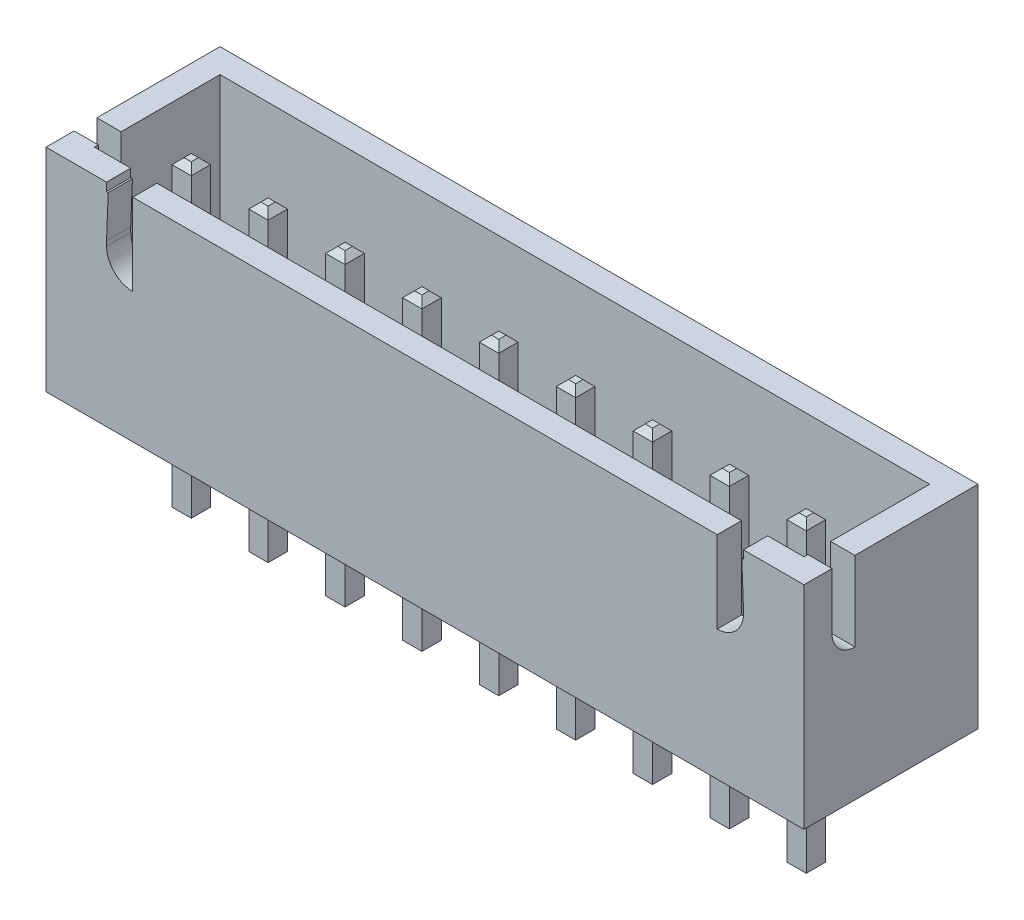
ISO-10303-21;
HEADER;
FILE_DESCRIPTION(('STEP AP214'),'2;1');
FILE_NAME('part.step','',(''),(''),'','','');
FILE_SCHEMA(('AUTOMOTIVE_DESIGN { 1 0 10303 214 1 1 1 1 }'));
ENDSEC;
DATA;
#1=APPLICATION_CONTEXT('core data for automotive mechanical design processes');
#2=APPLICATION_PROTOCOL_DEFINITION('international standard','automotive_design',2000,#1);
#3=PRODUCT_CONTEXT('',#1,'mechanical');
#4=PRODUCT('Part','Part','',(#3));
#5=PRODUCT_RELATED_PRODUCT_CATEGORY('part','',(#4));
#6=PRODUCT_DEFINITION_FORMATION('','',#4);
#7=PRODUCT_DEFINITION_CONTEXT('part definition',#1,'design');
#8=PRODUCT_DEFINITION('design','',#6,#7);
#9=PRODUCT_DEFINITION_SHAPE('','',#8);
#10=(LENGTH_UNIT() NAMED_UNIT(*) SI_UNIT(.MILLI.,.METRE.));
#11=(NAMED_UNIT(*) PLANE_ANGLE_UNIT() SI_UNIT($,.RADIAN.));
#12=(NAMED_UNIT(*) SI_UNIT($,.STERADIAN.) SOLID_ANGLE_UNIT());
#13=UNCERTAINTY_MEASURE_WITH_UNIT(LENGTH_MEASURE(1.E-05),#10,'distance_accuracy_value','');
#14=(GEOMETRIC_REPRESENTATION_CONTEXT(3) GLOBAL_UNCERTAINTY_ASSIGNED_CONTEXT((#13)) GLOBAL_UNIT_ASSIGNED_CONTEXT((#10,
#11,#12)) REPRESENTATION_CONTEXT('',''));
#15=CARTESIAN_POINT('',(0.,0.,0.));
#16=DIRECTION('',(0.,0.,1.));
#17=DIRECTION('',(1.,0.,0.));
#18=AXIS2_PLACEMENT_3D('',#15,#16,#17);
#19=CARTESIAN_POINT('',(0.,7.,0.));
#20=DIRECTION('',(0.,1.,0.));
#21=DIRECTION('',(0.,0.,1.));
#22=AXIS2_PLACEMENT_3D('',#19,#20,#21);
#23=PLANE('',#22);
#24=DIRECTION('',(0.,0.,1.));
#25=VECTOR('',#24,1.);
#26=CARTESIAN_POINT('',(10.5222,7.,-2.876));
#27=LINE('',#26,#25);
#28=CARTESIAN_POINT('',(10.5222,7.,2.075));
#29=VERTEX_POINT('',#28);
#30=CARTESIAN_POINT('',(10.5222,7.,2.875));
#31=VERTEX_POINT('',#30);
#32=EDGE_CURVE('E1144',#29,#31,#27,.T.);
#33=ORIENTED_EDGE('',*,*,#32,.T.);
#34=DIRECTION('',(1.,0.,0.));
#35=VECTOR('',#34,1.);
#36=CARTESIAN_POINT('',(-12.5222,7.,2.875));
#37=LINE('',#36,#35);
#38=CARTESIAN_POINT('',(12.5222,7.,2.875));
#39=VERTEX_POINT('',#38);
#40=EDGE_CURVE('E1292',#31,#39,#37,.T.);
#41=ORIENTED_EDGE('',*,*,#40,.T.);
#42=DIRECTION('',(0.,0.,-1.));
#43=VECTOR('',#42,1.);
#44=CARTESIAN_POINT('',(12.5222,7.,-2.875));
#45=LINE('',#44,#43);
#46=CARTESIAN_POINT('',(12.5222,7.,1.94691722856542));
#47=VERTEX_POINT('',#46);
#48=EDGE_CURVE('E1282',#39,#47,#45,.T.);
#49=ORIENTED_EDGE('',*,*,#48,.T.);
#50=DIRECTION('',(1.,0.,0.));
#51=VECTOR('',#50,1.);
#52=CARTESIAN_POINT('',(-12.5222,7.,1.94691722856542));
#53=LINE('',#52,#51);
#54=CARTESIAN_POINT('',(11.7222,7.,1.94691722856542));
#55=VERTEX_POINT('',#54);
#56=EDGE_CURVE('E1217',#55,#47,#53,.T.);
#57=ORIENTED_EDGE('',*,*,#56,.F.);
#58=DIRECTION('',(0.,0.,-1.));
#59=VECTOR('',#58,1.);
#60=CARTESIAN_POINT('',(11.7222,7.,-2.875));
#61=LINE('',#60,#59);
#62=CARTESIAN_POINT('',(11.7222,7.,2.075));
#63=VERTEX_POINT('',#62);
#64=EDGE_CURVE('E1269',#63,#55,#61,.T.);
#65=ORIENTED_EDGE('',*,*,#64,.F.);
#66=DIRECTION('',(1.,0.,0.));
#67=VECTOR('',#66,1.);
#68=CARTESIAN_POINT('',(-12.5222,7.,2.075));
#69=LINE('',#68,#67);
#70=EDGE_CURVE('E1278',#29,#63,#69,.T.);
#71=ORIENTED_EDGE('',*,*,#70,.F.);
#72=EDGE_LOOP('',(#33,#41,#49,#57,#65,#71));
#73=FACE_BOUND('',#72,.T.);
#74=ADVANCED_FACE('F35',(#73),#23,.T.);
#75=DIRECTION('',(0.,0.,1.));
#76=VECTOR('',#75,1.);
#77=CARTESIAN_POINT('',(-10.5222,7.,-2.876));
#78=LINE('',#77,#76);
#79=CARTESIAN_POINT('',(-10.5222,7.,2.075));
#80=VERTEX_POINT('',#79);
#81=CARTESIAN_POINT('',(-10.5222,7.,2.875));
#82=VERTEX_POINT('',#81);
#83=EDGE_CURVE('E1188',#80,#82,#78,.T.);
#84=ORIENTED_EDGE('',*,*,#83,.F.);
#85=CARTESIAN_POINT('',(-11.7222,7.,2.075));
#86=VERTEX_POINT('',#85);
#87=EDGE_CURVE('E1258',#86,#80,#69,.T.);
#88=ORIENTED_EDGE('',*,*,#87,.F.);
#89=DIRECTION('',(0.,0.,1.));
#90=VECTOR('',#89,1.);
#91=CARTESIAN_POINT('',(-11.7222,7.,-2.875));
#92=LINE('',#91,#90);
#93=CARTESIAN_POINT('',(-11.7222,7.,1.94691722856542));
#94=VERTEX_POINT('',#93);
#95=EDGE_CURVE('E1274',#94,#86,#92,.T.);
#96=ORIENTED_EDGE('',*,*,#95,.F.);
#97=CARTESIAN_POINT('',(-12.5222,7.,1.94691722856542));
#98=VERTEX_POINT('',#97);
#99=EDGE_CURVE('E1237',#98,#94,#53,.T.);
#100=ORIENTED_EDGE('',*,*,#99,.F.);
#101=DIRECTION('',(0.,0.,1.));
#102=VECTOR('',#101,1.);
#103=CARTESIAN_POINT('',(-12.5222,7.,-2.875));
#104=LINE('',#103,#102);
#105=CARTESIAN_POINT('',(-12.5222,7.,2.875));
#106=VERTEX_POINT('',#105);
#107=EDGE_CURVE('E1288',#98,#106,#104,.T.);
#108=ORIENTED_EDGE('',*,*,#107,.T.);
#109=EDGE_CURVE('E1293',#106,#82,#37,.T.);
#110=ORIENTED_EDGE('',*,*,#109,.T.);
#111=EDGE_LOOP('',(#84,#88,#96,#100,#108,#110));
#112=FACE_BOUND('',#111,.T.);
#113=ADVANCED_FACE('F1972',(#112),#23,.T.);
#114=DIRECTION('',(1.,0.,0.));
#115=VECTOR('',#114,1.);
#116=CARTESIAN_POINT('',(-12.5222,7.,1.19301282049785));
#117=LINE('',#116,#115);
#118=CARTESIAN_POINT('',(11.7222,7.,1.19301282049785));
#119=VERTEX_POINT('',#118);
#120=CARTESIAN_POINT('',(12.5222,7.,1.19301282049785));
#121=VERTEX_POINT('',#120);
#122=EDGE_CURVE('E1228',#119,#121,#117,.T.);
#123=ORIENTED_EDGE('',*,*,#122,.T.);
#124=CARTESIAN_POINT('',(12.5222,7.,-2.875));
#125=VERTEX_POINT('',#124);
#126=EDGE_CURVE('E1286',#121,#125,#45,.T.);
#127=ORIENTED_EDGE('',*,*,#126,.T.);
#128=DIRECTION('',(-1.,0.,0.));
#129=VECTOR('',#128,1.);
#130=CARTESIAN_POINT('',(-12.5222,7.,-2.875));
#131=LINE('',#130,#129);
#132=CARTESIAN_POINT('',(-12.5222,7.,-2.875));
#133=VERTEX_POINT('',#132);
#134=EDGE_CURVE('E1285',#125,#133,#131,.T.);
#135=ORIENTED_EDGE('',*,*,#134,.T.);
#136=CARTESIAN_POINT('',(-12.5222,7.,1.19301282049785));
#137=VERTEX_POINT('',#136);
#138=EDGE_CURVE('E1289',#133,#137,#104,.T.);
#139=ORIENTED_EDGE('',*,*,#138,.T.);
#140=CARTESIAN_POINT('',(-11.7222,7.,1.19301282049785));
#141=VERTEX_POINT('',#140);
#142=EDGE_CURVE('E1224',#137,#141,#117,.T.);
#143=ORIENTED_EDGE('',*,*,#142,.T.);
#144=CARTESIAN_POINT('',(-11.7222,7.,-2.075));
#145=VERTEX_POINT('',#144);
#146=EDGE_CURVE('E1275',#145,#141,#92,.T.);
#147=ORIENTED_EDGE('',*,*,#146,.F.);
#148=DIRECTION('',(-1.,0.,0.));
#149=VECTOR('',#148,1.);
#150=CARTESIAN_POINT('',(-12.5222,7.,-2.075));
#151=LINE('',#150,#149);
#152=CARTESIAN_POINT('',(11.7222,7.,-2.075));
#153=VERTEX_POINT('',#152);
#154=EDGE_CURVE('E1272',#153,#145,#151,.T.);
#155=ORIENTED_EDGE('',*,*,#154,.F.);
#156=EDGE_CURVE('E1268',#119,#153,#61,.T.);
#157=ORIENTED_EDGE('',*,*,#156,.F.);
#158=EDGE_LOOP('',(#123,#127,#135,#139,#143,#147,#155,#157));
#159=FACE_BOUND('',#158,.T.);
#160=ADVANCED_FACE('F1979',(#159),#23,.T.);
#161=CARTESIAN_POINT('',(12.5222,7.,-2.875));
#162=DIRECTION('',(-1.,0.,0.));
#163=DIRECTION('',(0.,0.,1.));
#164=AXIS2_PLACEMENT_3D('',#161,#162,#163);
#165=PLANE('',#164);
#166=ORIENTED_EDGE('',*,*,#126,.F.);
#167=DIRECTION('',(0.,1.,0.));
#168=VECTOR('',#167,1.);
#169=CARTESIAN_POINT('',(12.5222,7.,1.19301282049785));
#170=LINE('',#169,#168);
#171=CARTESIAN_POINT('',(12.5222,4.37960398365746,1.19301282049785));
#172=VERTEX_POINT('',#171);
#173=EDGE_CURVE('E1211',#172,#121,#170,.T.);
#174=ORIENTED_EDGE('',*,*,#173,.F.);
#175=CARTESIAN_POINT('',(12.5222,5.13350839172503,1.19301282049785));
#176=DIRECTION('',(1.,0.,0.));
#177=DIRECTION('',(0.,0.,1.));
#178=AXIS2_PLACEMENT_3D('',#175,#176,#177);
#179=CIRCLE('',#178,0.753904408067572);
#180=CARTESIAN_POINT('',(12.5222,5.13350839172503,1.94691722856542));
#181=VERTEX_POINT('',#180);
#182=EDGE_CURVE('E1220',#181,#172,#179,.T.);
#183=ORIENTED_EDGE('',*,*,#182,.F.);
#184=DIRECTION('',(0.,-1.,0.));
#185=VECTOR('',#184,1.);
#186=CARTESIAN_POINT('',(12.5222,5.13350839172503,1.94691722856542));
#187=LINE('',#186,#185);
#188=EDGE_CURVE('E1206',#47,#181,#187,.T.);
#189=ORIENTED_EDGE('',*,*,#188,.F.);
#190=ORIENTED_EDGE('',*,*,#48,.F.);
#191=DIRECTION('',(0.,-1.,0.));
#192=VECTOR('',#191,1.);
#193=CARTESIAN_POINT('',(12.5222,7.,2.875));
#194=LINE('',#193,#192);
#195=CARTESIAN_POINT('',(12.5222,0.,2.875));
#196=VERTEX_POINT('',#195);
#197=EDGE_CURVE('E1296',#39,#196,#194,.T.);
#198=ORIENTED_EDGE('',*,*,#197,.T.);
#199=DIRECTION('',(0.,0.,-1.));
#200=VECTOR('',#199,1.);
#201=CARTESIAN_POINT('',(12.5222,0.,-2.875));
#202=LINE('',#201,#200);
#203=CARTESIAN_POINT('',(12.5222,0.,-2.875));
#204=VERTEX_POINT('',#203);
#205=EDGE_CURVE('E1252',#196,#204,#202,.T.);
#206=ORIENTED_EDGE('',*,*,#205,.T.);
#207=DIRECTION('',(0.,-1.,0.));
#208=VECTOR('',#207,1.);
#209=CARTESIAN_POINT('',(12.5222,7.,-2.875));
#210=LINE('',#209,#208);
#211=EDGE_CURVE('E1314',#125,#204,#210,.T.);
#212=ORIENTED_EDGE('',*,*,#211,.F.);
#213=EDGE_LOOP('',(#166,#174,#183,#189,#190,#198,#206,#212));
#214=FACE_BOUND('',#213,.T.);
#215=ADVANCED_FACE('F1996',(#214),#165,.F.);
#216=CARTESIAN_POINT('',(-12.5222,7.,-2.875));
#217=DIRECTION('',(0.,0.,1.));
#218=DIRECTION('',(1.,0.,0.));
#219=AXIS2_PLACEMENT_3D('',#216,#217,#218);
#220=PLANE('',#219);
#221=DIRECTION('',(-1.,0.,0.));
#222=VECTOR('',#221,1.);
#223=CARTESIAN_POINT('',(-12.5222,0.,-2.875));
#224=LINE('',#223,#222);
#225=CARTESIAN_POINT('',(-12.5222,0.,-2.875));
#226=VERTEX_POINT('',#225);
#227=EDGE_CURVE('E1300',#204,#226,#224,.T.);
#228=ORIENTED_EDGE('',*,*,#227,.T.);
#229=DIRECTION('',(0.,-1.,0.));
#230=VECTOR('',#229,1.);
#231=CARTESIAN_POINT('',(-12.5222,7.,-2.875));
#232=LINE('',#231,#230);
#233=EDGE_CURVE('E1311',#133,#226,#232,.T.);
#234=ORIENTED_EDGE('',*,*,#233,.F.);
#235=ORIENTED_EDGE('',*,*,#134,.F.);
#236=ORIENTED_EDGE('',*,*,#211,.T.);
#237=EDGE_LOOP('',(#228,#234,#235,#236));
#238=FACE_BOUND('',#237,.T.);
#239=ADVANCED_FACE('F2001',(#238),#220,.F.);
#240=CARTESIAN_POINT('',(-12.5222,7.,-2.875));
#241=DIRECTION('',(1.,0.,0.));
#242=DIRECTION('',(0.,0.,-1.));
#243=AXIS2_PLACEMENT_3D('',#240,#241,#242);
#244=PLANE('',#243);
#245=CARTESIAN_POINT('',(-12.5222,5.13350839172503,1.19301282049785));
#246=DIRECTION('',(1.,0.,0.));
#247=DIRECTION('',(0.,0.,1.));
#248=AXIS2_PLACEMENT_3D('',#245,#246,#247);
#249=CIRCLE('',#248,0.753904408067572);
#250=CARTESIAN_POINT('',(-12.5222,5.13350839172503,1.94691722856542));
#251=VERTEX_POINT('',#250);
#252=CARTESIAN_POINT('',(-12.5222,4.37960398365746,1.19301282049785));
#253=VERTEX_POINT('',#252);
#254=EDGE_CURVE('E1210',#251,#253,#249,.T.);
#255=ORIENTED_EDGE('',*,*,#254,.T.);
#256=DIRECTION('',(0.,1.,0.));
#257=VECTOR('',#256,1.);
#258=CARTESIAN_POINT('',(-12.5222,7.,1.19301282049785));
#259=LINE('',#258,#257);
#260=EDGE_CURVE('E1214',#253,#137,#259,.T.);
#261=ORIENTED_EDGE('',*,*,#260,.T.);
#262=ORIENTED_EDGE('',*,*,#138,.F.);
#263=ORIENTED_EDGE('',*,*,#233,.T.);
#264=DIRECTION('',(0.,0.,1.));
#265=VECTOR('',#264,1.);
#266=CARTESIAN_POINT('',(-12.5222,0.,-2.875));
#267=LINE('',#266,#265);
#268=CARTESIAN_POINT('',(-12.5222,0.,2.875));
#269=VERTEX_POINT('',#268);
#270=EDGE_CURVE('E1302',#226,#269,#267,.T.);
#271=ORIENTED_EDGE('',*,*,#270,.T.);
#272=DIRECTION('',(0.,-1.,0.));
#273=VECTOR('',#272,1.);
#274=CARTESIAN_POINT('',(-12.5222,7.,2.875));
#275=LINE('',#274,#273);
#276=EDGE_CURVE('E1308',#106,#269,#275,.T.);
#277=ORIENTED_EDGE('',*,*,#276,.F.);
#278=ORIENTED_EDGE('',*,*,#107,.F.);
#279=DIRECTION('',(0.,-1.,0.));
#280=VECTOR('',#279,1.);
#281=CARTESIAN_POINT('',(-12.5222,5.13350839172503,1.94691722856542));
#282=LINE('',#281,#280);
#283=EDGE_CURVE('E1207',#98,#251,#282,.T.);
#284=ORIENTED_EDGE('',*,*,#283,.T.);
#285=EDGE_LOOP('',(#255,#261,#262,#263,#271,#277,#278,#284));
#286=FACE_BOUND('',#285,.T.);
#287=ADVANCED_FACE('F1991',(#286),#244,.F.);
#288=CARTESIAN_POINT('',(-12.5222,7.,2.875));
#289=DIRECTION('',(0.,0.,-1.));
#290=DIRECTION('',(-1.,0.,0.));
#291=AXIS2_PLACEMENT_3D('',#288,#289,#290);
#292=PLANE('',#291);
#293=ORIENTED_EDGE('',*,*,#40,.F.);
#294=DIRECTION('',(0.,1.,0.));
#295=VECTOR('',#294,1.);
#296=CARTESIAN_POINT('',(10.5222,7.,2.875));
#297=LINE('',#296,#295);
#298=CARTESIAN_POINT('',(10.5222,6.72892261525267,2.875));
#299=VERTEX_POINT('',#298);
#300=EDGE_CURVE('E1133',#299,#31,#297,.T.);
#301=ORIENTED_EDGE('',*,*,#300,.F.);
#302=DIRECTION('',(0.999234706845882,0.0391152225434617,0.));
#303=VECTOR('',#302,1.);
#304=CARTESIAN_POINT('',(10.5222,6.72892261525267,2.875));
#305=LINE('',#304,#303);
#306=CARTESIAN_POINT('',(10.4670647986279,6.72676433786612,2.875));
#307=VERTEX_POINT('',#306);
#308=EDGE_CURVE('E1130',#307,#299,#305,.T.);
#309=ORIENTED_EDGE('',*,*,#308,.F.);
#310=DIRECTION('',(-0.0391152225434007,0.999234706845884,0.));
#311=VECTOR('',#310,1.);
#312=CARTESIAN_POINT('',(10.4670647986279,6.72676433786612,2.875));
#313=LINE('',#312,#311);
#314=CARTESIAN_POINT('',(10.5222,5.31828438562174,2.875));
#315=VERTEX_POINT('',#314);
#316=EDGE_CURVE('E1127',#315,#307,#313,.T.);
#317=ORIENTED_EDGE('',*,*,#316,.F.);
#318=DIRECTION('',(0.,1.,0.));
#319=VECTOR('',#318,1.);
#320=CARTESIAN_POINT('',(10.5222,5.31828438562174,2.875));
#321=LINE('',#320,#319);
#322=CARTESIAN_POINT('',(10.5222,5.16630822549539,2.875));
#323=VERTEX_POINT('',#322);
#324=EDGE_CURVE('E1124',#323,#315,#321,.T.);
#325=ORIENTED_EDGE('',*,*,#324,.F.);
#326=CARTESIAN_POINT('',(9.65596811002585,5.16630822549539,2.875));
#327=DIRECTION('',(0.,0.,1.));
#328=DIRECTION('',(-1.,0.,0.));
#329=AXIS2_PLACEMENT_3D('',#326,#327,#328);
#330=CIRCLE('',#329,0.866231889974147);
#331=CARTESIAN_POINT('',(9.65596811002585,4.30007633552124,2.875));
#332=VERTEX_POINT('',#331);
#333=EDGE_CURVE('E1121',#332,#323,#330,.T.);
#334=ORIENTED_EDGE('',*,*,#333,.F.);
#335=DIRECTION('',(0.,-1.,0.));
#336=VECTOR('',#335,1.);
#337=CARTESIAN_POINT('',(9.65596811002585,4.30007633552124,2.875));
#338=LINE('',#337,#336);
#339=CARTESIAN_POINT('',(9.65596811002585,7.,2.875));
#340=VERTEX_POINT('',#339);
#341=EDGE_CURVE('E1135',#340,#332,#338,.T.);
#342=ORIENTED_EDGE('',*,*,#341,.F.);
#343=CARTESIAN_POINT('',(-9.65596811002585,7.,2.875));
#344=VERTEX_POINT('',#343);
#345=EDGE_CURVE('E1297',#344,#340,#37,.T.);
#346=ORIENTED_EDGE('',*,*,#345,.F.);
#347=DIRECTION('',(0.,1.,0.));
#348=VECTOR('',#347,1.);
#349=CARTESIAN_POINT('',(-9.65596811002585,4.30007633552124,2.875));
#350=LINE('',#349,#348);
#351=CARTESIAN_POINT('',(-9.65596811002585,4.30007633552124,2.875));
#352=VERTEX_POINT('',#351);
#353=EDGE_CURVE('E1186',#352,#344,#350,.T.);
#354=ORIENTED_EDGE('',*,*,#353,.F.);
#355=CARTESIAN_POINT('',(-9.65596811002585,5.16630822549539,2.875));
#356=DIRECTION('',(0.,0.,1.));
#357=DIRECTION('',(1.,0.,0.));
#358=AXIS2_PLACEMENT_3D('',#355,#356,#357);
#359=CIRCLE('',#358,0.866231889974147);
#360=CARTESIAN_POINT('',(-10.5222,5.16630822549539,2.875));
#361=VERTEX_POINT('',#360);
#362=EDGE_CURVE('E1183',#361,#352,#359,.T.);
#363=ORIENTED_EDGE('',*,*,#362,.F.);
#364=DIRECTION('',(0.,-1.,0.));
#365=VECTOR('',#364,1.);
#366=CARTESIAN_POINT('',(-10.5222,5.31828438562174,2.875));
#367=LINE('',#366,#365);
#368=CARTESIAN_POINT('',(-10.5222,5.31828438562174,2.875));
#369=VERTEX_POINT('',#368);
#370=EDGE_CURVE('E1180',#369,#361,#367,.T.);
#371=ORIENTED_EDGE('',*,*,#370,.F.);
#372=DIRECTION('',(-0.0391152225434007,-0.999234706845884,0.));
#373=VECTOR('',#372,1.);
#374=CARTESIAN_POINT('',(-10.4670647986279,6.72676433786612,2.875));
#375=LINE('',#374,#373);
#376=CARTESIAN_POINT('',(-10.4670647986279,6.72676433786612,2.875));
#377=VERTEX_POINT('',#376);
#378=EDGE_CURVE('E1177',#377,#369,#375,.T.);
#379=ORIENTED_EDGE('',*,*,#378,.F.);
#380=DIRECTION('',(0.999234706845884,-0.0391152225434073,0.));
#381=VECTOR('',#380,1.);
#382=CARTESIAN_POINT('',(-10.5222,6.72892261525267,2.875));
#383=LINE('',#382,#381);
#384=CARTESIAN_POINT('',(-10.5222,6.72892261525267,2.875));
#385=VERTEX_POINT('',#384);
#386=EDGE_CURVE('E1174',#385,#377,#383,.T.);
#387=ORIENTED_EDGE('',*,*,#386,.F.);
#388=DIRECTION('',(0.,-1.,0.));
#389=VECTOR('',#388,1.);
#390=CARTESIAN_POINT('',(-10.5222,7.,2.875));
#391=LINE('',#390,#389);
#392=EDGE_CURVE('E1171',#82,#385,#391,.T.);
#393=ORIENTED_EDGE('',*,*,#392,.F.);
#394=ORIENTED_EDGE('',*,*,#109,.F.);
#395=ORIENTED_EDGE('',*,*,#276,.T.);
#396=DIRECTION('',(1.,0.,0.));
#397=VECTOR('',#396,1.);
#398=CARTESIAN_POINT('',(-12.5222,0.,2.875));
#399=LINE('',#398,#397);
#400=EDGE_CURVE('E1304',#269,#196,#399,.T.);
#401=ORIENTED_EDGE('',*,*,#400,.T.);
#402=ORIENTED_EDGE('',*,*,#197,.F.);
#403=EDGE_LOOP('',(#293,#301,#309,#317,#325,#334,#342,#346,#354,#363,#371,#379,#387,#393,#394,
#395,#401,#402));
#404=FACE_BOUND('',#403,.T.);
#405=ADVANCED_FACE('F1984',(#404),#292,.F.);
#406=DIRECTION('',(0.,0.,1.));
#407=VECTOR('',#406,1.);
#408=CARTESIAN_POINT('',(9.65596811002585,7.,-2.876));
#409=LINE('',#408,#407);
#410=CARTESIAN_POINT('',(9.65596811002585,7.,2.075));
#411=VERTEX_POINT('',#410);
#412=EDGE_CURVE('E1142',#411,#340,#409,.T.);
#413=ORIENTED_EDGE('',*,*,#412,.F.);
#414=CARTESIAN_POINT('',(-9.65596811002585,7.,2.075));
#415=VERTEX_POINT('',#414);
#416=EDGE_CURVE('E1281',#415,#411,#69,.T.);
#417=ORIENTED_EDGE('',*,*,#416,.F.);
#418=DIRECTION('',(0.,0.,1.));
#419=VECTOR('',#418,1.);
#420=CARTESIAN_POINT('',(-9.65596811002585,7.,-2.876));
#421=LINE('',#420,#419);
#422=EDGE_CURVE('E1189',#415,#344,#421,.T.);
#423=ORIENTED_EDGE('',*,*,#422,.T.);
#424=ORIENTED_EDGE('',*,*,#345,.T.);
#425=EDGE_LOOP('',(#413,#417,#423,#424));
#426=FACE_BOUND('',#425,.T.);
#427=ADVANCED_FACE('F1975',(#426),#23,.T.);
#428=CARTESIAN_POINT('',(0.,0.,0.));
#429=DIRECTION('',(0.,1.,0.));
#430=DIRECTION('',(0.,0.,1.));
#431=AXIS2_PLACEMENT_3D('',#428,#429,#430);
#432=PLANE('',#431);
#433=DIRECTION('',(1.,0.,0.));
#434=VECTOR('',#433,1.);
#435=CARTESIAN_POINT('',(0.,0.,0.845));
#436=LINE('',#435,#434);
#437=CARTESIAN_POINT('',(9.9278,0.,0.845));
#438=VERTEX_POINT('',#437);
#439=CARTESIAN_POINT('',(10.5678,0.,0.845));
#440=VERTEX_POINT('',#439);
#441=EDGE_CURVE('E881',#438,#440,#436,.T.);
#442=ORIENTED_EDGE('',*,*,#441,.T.);
#443=DIRECTION('',(0.,0.,-1.));
#444=VECTOR('',#443,1.);
#445=CARTESIAN_POINT('',(10.5678,0.,0.));
#446=LINE('',#445,#444);
#447=CARTESIAN_POINT('',(10.5678,0.,0.205));
#448=VERTEX_POINT('',#447);
#449=EDGE_CURVE('E909',#440,#448,#446,.T.);
#450=ORIENTED_EDGE('',*,*,#449,.T.);
#451=DIRECTION('',(-1.,0.,0.));
#452=VECTOR('',#451,1.);
#453=CARTESIAN_POINT('',(0.,0.,0.205));
#454=LINE('',#453,#452);
#455=CARTESIAN_POINT('',(9.9278,0.,0.205));
#456=VERTEX_POINT('',#455);
#457=EDGE_CURVE('E907',#448,#456,#454,.T.);
#458=ORIENTED_EDGE('',*,*,#457,.T.);
#459=DIRECTION('',(0.,0.,1.));
#460=VECTOR('',#459,1.);
#461=CARTESIAN_POINT('',(9.9278,0.,0.));
#462=LINE('',#461,#460);
#463=EDGE_CURVE('E892',#456,#438,#462,.T.);
#464=ORIENTED_EDGE('',*,*,#463,.T.);
#465=EDGE_LOOP('',(#442,#450,#458,#464));
#466=FACE_BOUND('',#465,.T.);
#467=DIRECTION('',(1.,0.,0.));
#468=VECTOR('',#467,1.);
#469=CARTESIAN_POINT('',(0.,0.,0.845));
#470=LINE('',#469,#468);
#471=CARTESIAN_POINT('',(7.3878,0.,0.845));
#472=VERTEX_POINT('',#471);
#473=CARTESIAN_POINT('',(8.0278,0.,0.845));
#474=VERTEX_POINT('',#473);
#475=EDGE_CURVE('E917',#472,#474,#470,.T.);
#476=ORIENTED_EDGE('',*,*,#475,.T.);
#477=DIRECTION('',(0.,0.,-1.));
#478=VECTOR('',#477,1.);
#479=CARTESIAN_POINT('',(8.0278,0.,0.));
#480=LINE('',#479,#478);
#481=CARTESIAN_POINT('',(8.0278,0.,0.205));
#482=VERTEX_POINT('',#481);
#483=EDGE_CURVE('E935',#474,#482,#480,.T.);
#484=ORIENTED_EDGE('',*,*,#483,.T.);
#485=DIRECTION('',(-1.,0.,0.));
#486=VECTOR('',#485,1.);
#487=CARTESIAN_POINT('',(0.,0.,0.205));
#488=LINE('',#487,#486);
#489=CARTESIAN_POINT('',(7.3878,0.,0.205));
#490=VERTEX_POINT('',#489);
#491=EDGE_CURVE('E932',#482,#490,#488,.T.);
#492=ORIENTED_EDGE('',*,*,#491,.T.);
#493=DIRECTION('',(0.,0.,1.));
#494=VECTOR('',#493,1.);
#495=CARTESIAN_POINT('',(7.3878,0.,0.));
#496=LINE('',#495,#494);
#497=EDGE_CURVE('E929',#490,#472,#496,.T.);
#498=ORIENTED_EDGE('',*,*,#497,.T.);
#499=EDGE_LOOP('',(#476,#484,#492,#498));
#500=FACE_BOUND('',#499,.T.);
#501=DIRECTION('',(1.,0.,0.));
#502=VECTOR('',#501,1.);
#503=CARTESIAN_POINT('',(0.,0.,0.845));
#504=LINE('',#503,#502);
#505=CARTESIAN_POINT('',(4.8478,0.,0.845));
#506=VERTEX_POINT('',#505);
#507=CARTESIAN_POINT('',(5.4878,0.,0.845));
#508=VERTEX_POINT('',#507);
#509=EDGE_CURVE('E941',#506,#508,#504,.T.);
#510=ORIENTED_EDGE('',*,*,#509,.T.);
#511=DIRECTION('',(0.,0.,-1.));
#512=VECTOR('',#511,1.);
#513=CARTESIAN_POINT('',(5.4878,0.,0.));
#514=LINE('',#513,#512);
#515=CARTESIAN_POINT('',(5.4878,0.,0.205));
#516=VERTEX_POINT('',#515);
#517=EDGE_CURVE('E959',#508,#516,#514,.T.);
#518=ORIENTED_EDGE('',*,*,#517,.T.);
#519=DIRECTION('',(-1.,0.,0.));
#520=VECTOR('',#519,1.);
#521=CARTESIAN_POINT('',(0.,0.,0.205));
#522=LINE('',#521,#520);
#523=CARTESIAN_POINT('',(4.8478,0.,0.205));
#524=VERTEX_POINT('',#523);
#525=EDGE_CURVE('E956',#516,#524,#522,.T.);
#526=ORIENTED_EDGE('',*,*,#525,.T.);
#527=DIRECTION('',(0.,0.,1.));
#528=VECTOR('',#527,1.);
#529=CARTESIAN_POINT('',(4.8478,0.,0.));
#530=LINE('',#529,#528);
#531=EDGE_CURVE('E953',#524,#506,#530,.T.);
#532=ORIENTED_EDGE('',*,*,#531,.T.);
#533=EDGE_LOOP('',(#510,#518,#526,#532));
#534=FACE_BOUND('',#533,.T.);
#535=DIRECTION('',(1.,0.,0.));
#536=VECTOR('',#535,1.);
#537=CARTESIAN_POINT('',(0.,0.,0.845));
#538=LINE('',#537,#536);
#539=CARTESIAN_POINT('',(2.3078,0.,0.845));
#540=VERTEX_POINT('',#539);
#541=CARTESIAN_POINT('',(2.94780000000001,0.,0.845));
#542=VERTEX_POINT('',#541);
#543=EDGE_CURVE('E965',#540,#542,#538,.T.);
#544=ORIENTED_EDGE('',*,*,#543,.T.);
#545=DIRECTION('',(0.,0.,-1.));
#546=VECTOR('',#545,1.);
#547=CARTESIAN_POINT('',(2.94780000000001,0.,0.));
#548=LINE('',#547,#546);
#549=CARTESIAN_POINT('',(2.94780000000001,0.,0.205));
#550=VERTEX_POINT('',#549);
#551=EDGE_CURVE('E983',#542,#550,#548,.T.);
#552=ORIENTED_EDGE('',*,*,#551,.T.);
#553=DIRECTION('',(-1.,0.,0.));
#554=VECTOR('',#553,1.);
#555=CARTESIAN_POINT('',(0.,0.,0.205));
#556=LINE('',#555,#554);
#557=CARTESIAN_POINT('',(2.3078,0.,0.205));
#558=VERTEX_POINT('',#557);
#559=EDGE_CURVE('E980',#550,#558,#556,.T.);
#560=ORIENTED_EDGE('',*,*,#559,.T.);
#561=DIRECTION('',(0.,0.,1.));
#562=VECTOR('',#561,1.);
#563=CARTESIAN_POINT('',(2.3078,0.,0.));
#564=LINE('',#563,#562);
#565=EDGE_CURVE('E977',#558,#540,#564,.T.);
#566=ORIENTED_EDGE('',*,*,#565,.T.);
#567=EDGE_LOOP('',(#544,#552,#560,#566));
#568=FACE_BOUND('',#567,.T.);
#569=DIRECTION('',(1.,0.,0.));
#570=VECTOR('',#569,1.);
#571=CARTESIAN_POINT('',(0.,0.,0.845));
#572=LINE('',#571,#570);
#573=CARTESIAN_POINT('',(-0.232199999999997,0.,0.845));
#574=VERTEX_POINT('',#573);
#575=CARTESIAN_POINT('',(0.407800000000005,0.,0.845));
#576=VERTEX_POINT('',#575);
#577=EDGE_CURVE('E989',#574,#576,#572,.T.);
#578=ORIENTED_EDGE('',*,*,#577,.T.);
#579=DIRECTION('',(0.,0.,-1.));
#580=VECTOR('',#579,1.);
#581=CARTESIAN_POINT('',(0.407800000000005,0.,0.));
#582=LINE('',#581,#580);
#583=CARTESIAN_POINT('',(0.407800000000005,0.,0.205));
#584=VERTEX_POINT('',#583);
#585=EDGE_CURVE('E1007',#576,#584,#582,.T.);
#586=ORIENTED_EDGE('',*,*,#585,.T.);
#587=DIRECTION('',(-1.,0.,0.));
#588=VECTOR('',#587,1.);
#589=CARTESIAN_POINT('',(0.,0.,0.205));
#590=LINE('',#589,#588);
#591=CARTESIAN_POINT('',(-0.232199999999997,0.,0.205));
#592=VERTEX_POINT('',#591);
#593=EDGE_CURVE('E1004',#584,#592,#590,.T.);
#594=ORIENTED_EDGE('',*,*,#593,.T.);
#595=DIRECTION('',(0.,0.,1.));
#596=VECTOR('',#595,1.);
#597=CARTESIAN_POINT('',(-0.232199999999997,0.,0.));
#598=LINE('',#597,#596);
#599=EDGE_CURVE('E1001',#592,#574,#598,.T.);
#600=ORIENTED_EDGE('',*,*,#599,.T.);
#601=EDGE_LOOP('',(#578,#586,#594,#600));
#602=FACE_BOUND('',#601,.T.);
#603=DIRECTION('',(1.,0.,0.));
#604=VECTOR('',#603,1.);
#605=CARTESIAN_POINT('',(0.,0.,0.845));
#606=LINE('',#605,#604);
#607=CARTESIAN_POINT('',(-2.7722,0.,0.845));
#608=VERTEX_POINT('',#607);
#609=CARTESIAN_POINT('',(-2.1322,0.,0.845));
#610=VERTEX_POINT('',#609);
#611=EDGE_CURVE('E1013',#608,#610,#606,.T.);
#612=ORIENTED_EDGE('',*,*,#611,.T.);
#613=DIRECTION('',(0.,0.,-1.));
#614=VECTOR('',#613,1.);
#615=CARTESIAN_POINT('',(-2.1322,0.,0.));
#616=LINE('',#615,#614);
#617=CARTESIAN_POINT('',(-2.1322,0.,0.205));
#618=VERTEX_POINT('',#617);
#619=EDGE_CURVE('E1031',#610,#618,#616,.T.);
#620=ORIENTED_EDGE('',*,*,#619,.T.);
#621=DIRECTION('',(-1.,0.,0.));
#622=VECTOR('',#621,1.);
#623=CARTESIAN_POINT('',(0.,0.,0.205));
#624=LINE('',#623,#622);
#625=CARTESIAN_POINT('',(-2.7722,0.,0.205));
#626=VERTEX_POINT('',#625);
#627=EDGE_CURVE('E1028',#618,#626,#624,.T.);
#628=ORIENTED_EDGE('',*,*,#627,.T.);
#629=DIRECTION('',(0.,0.,1.));
#630=VECTOR('',#629,1.);
#631=CARTESIAN_POINT('',(-2.7722,0.,0.));
#632=LINE('',#631,#630);
#633=EDGE_CURVE('E1025',#626,#608,#632,.T.);
#634=ORIENTED_EDGE('',*,*,#633,.T.);
#635=EDGE_LOOP('',(#612,#620,#628,#634));
#636=FACE_BOUND('',#635,.T.);
#637=DIRECTION('',(1.,0.,0.));
#638=VECTOR('',#637,1.);
#639=CARTESIAN_POINT('',(0.,0.,0.845));
#640=LINE('',#639,#638);
#641=CARTESIAN_POINT('',(-5.3122,0.,0.845));
#642=VERTEX_POINT('',#641);
#643=CARTESIAN_POINT('',(-4.6722,0.,0.845));
#644=VERTEX_POINT('',#643);
#645=EDGE_CURVE('E1037',#642,#644,#640,.T.);
#646=ORIENTED_EDGE('',*,*,#645,.T.);
#647=DIRECTION('',(0.,0.,-1.));
#648=VECTOR('',#647,1.);
#649=CARTESIAN_POINT('',(-4.6722,0.,0.));
#650=LINE('',#649,#648);
#651=CARTESIAN_POINT('',(-4.6722,0.,0.205));
#652=VERTEX_POINT('',#651);
#653=EDGE_CURVE('E1055',#644,#652,#650,.T.);
#654=ORIENTED_EDGE('',*,*,#653,.T.);
#655=DIRECTION('',(-1.,0.,0.));
#656=VECTOR('',#655,1.);
#657=CARTESIAN_POINT('',(0.,0.,0.205));
#658=LINE('',#657,#656);
#659=CARTESIAN_POINT('',(-5.3122,0.,0.205));
#660=VERTEX_POINT('',#659);
#661=EDGE_CURVE('E1052',#652,#660,#658,.T.);
#662=ORIENTED_EDGE('',*,*,#661,.T.);
#663=DIRECTION('',(0.,0.,1.));
#664=VECTOR('',#663,1.);
#665=CARTESIAN_POINT('',(-5.3122,0.,0.));
#666=LINE('',#665,#664);
#667=EDGE_CURVE('E1049',#660,#642,#666,.T.);
#668=ORIENTED_EDGE('',*,*,#667,.T.);
#669=EDGE_LOOP('',(#646,#654,#662,#668));
#670=FACE_BOUND('',#669,.T.);
#671=DIRECTION('',(1.,0.,0.));
#672=VECTOR('',#671,1.);
#673=CARTESIAN_POINT('',(0.,0.,0.845));
#674=LINE('',#673,#672);
#675=CARTESIAN_POINT('',(-7.8522,0.,0.845));
#676=VERTEX_POINT('',#675);
#677=CARTESIAN_POINT('',(-7.21219999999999,0.,0.845));
#678=VERTEX_POINT('',#677);
#679=EDGE_CURVE('E1061',#676,#678,#674,.T.);
#680=ORIENTED_EDGE('',*,*,#679,.T.);
#681=DIRECTION('',(0.,0.,-1.));
#682=VECTOR('',#681,1.);
#683=CARTESIAN_POINT('',(-7.21219999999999,0.,0.));
#684=LINE('',#683,#682);
#685=CARTESIAN_POINT('',(-7.21219999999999,0.,0.205));
#686=VERTEX_POINT('',#685);
#687=EDGE_CURVE('E1079',#678,#686,#684,.T.);
#688=ORIENTED_EDGE('',*,*,#687,.T.);
#689=DIRECTION('',(-1.,0.,0.));
#690=VECTOR('',#689,1.);
#691=CARTESIAN_POINT('',(0.,0.,0.205));
#692=LINE('',#691,#690);
#693=CARTESIAN_POINT('',(-7.8522,0.,0.205));
#694=VERTEX_POINT('',#693);
#695=EDGE_CURVE('E1076',#686,#694,#692,.T.);
#696=ORIENTED_EDGE('',*,*,#695,.T.);
#697=DIRECTION('',(0.,0.,1.));
#698=VECTOR('',#697,1.);
#699=CARTESIAN_POINT('',(-7.8522,0.,0.));
#700=LINE('',#699,#698);
#701=EDGE_CURVE('E1073',#694,#676,#700,.T.);
#702=ORIENTED_EDGE('',*,*,#701,.T.);
#703=EDGE_LOOP('',(#680,#688,#696,#702));
#704=FACE_BOUND('',#703,.T.);
#705=DIRECTION('',(1.,0.,0.));
#706=VECTOR('',#705,1.);
#707=CARTESIAN_POINT('',(0.,0.,0.845));
#708=LINE('',#707,#706);
#709=CARTESIAN_POINT('',(-10.3922,0.,0.845));
#710=VERTEX_POINT('',#709);
#711=CARTESIAN_POINT('',(-9.75219999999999,0.,0.845));
#712=VERTEX_POINT('',#711);
#713=EDGE_CURVE('E1085',#710,#712,#708,.T.);
#714=ORIENTED_EDGE('',*,*,#713,.T.);
#715=DIRECTION('',(0.,0.,-1.));
#716=VECTOR('',#715,1.);
#717=CARTESIAN_POINT('',(-9.75219999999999,0.,0.));
#718=LINE('',#717,#716);
#719=CARTESIAN_POINT('',(-9.75219999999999,0.,0.205));
#720=VERTEX_POINT('',#719);
#721=EDGE_CURVE('E1103',#712,#720,#718,.T.);
#722=ORIENTED_EDGE('',*,*,#721,.T.);
#723=DIRECTION('',(-1.,0.,0.));
#724=VECTOR('',#723,1.);
#725=CARTESIAN_POINT('',(0.,0.,0.205));
#726=LINE('',#725,#724);
#727=CARTESIAN_POINT('',(-10.3922,0.,0.205));
#728=VERTEX_POINT('',#727);
#729=EDGE_CURVE('E1100',#720,#728,#726,.T.);
#730=ORIENTED_EDGE('',*,*,#729,.T.);
#731=DIRECTION('',(0.,0.,1.));
#732=VECTOR('',#731,1.);
#733=CARTESIAN_POINT('',(-10.3922,0.,0.));
#734=LINE('',#733,#732);
#735=EDGE_CURVE('E1097',#728,#710,#734,.T.);
#736=ORIENTED_EDGE('',*,*,#735,.T.);
#737=EDGE_LOOP('',(#714,#722,#730,#736));
#738=FACE_BOUND('',#737,.T.);
#739=ORIENTED_EDGE('',*,*,#205,.F.);
#740=ORIENTED_EDGE('',*,*,#400,.F.);
#741=ORIENTED_EDGE('',*,*,#270,.F.);
#742=ORIENTED_EDGE('',*,*,#227,.F.);
#743=EDGE_LOOP('',(#739,#740,#741,#742));
#744=FACE_BOUND('',#743,.T.);
#745=ADVANCED_FACE('F905',(#466,#500,#534,#568,#602,#636,#670,#704,#738,#744),#432,.F.);
#746=CARTESIAN_POINT('',(11.7222,7.,-2.875));
#747=DIRECTION('',(-1.,0.,0.));
#748=DIRECTION('',(0.,0.,1.));
#749=AXIS2_PLACEMENT_3D('',#746,#747,#748);
#750=PLANE('',#749);
#751=DIRECTION('',(0.,-1.,0.));
#752=VECTOR('',#751,1.);
#753=CARTESIAN_POINT('',(11.7222,7.,1.19301282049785));
#754=LINE('',#753,#752);
#755=CARTESIAN_POINT('',(11.7222,4.37960398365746,1.19301282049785));
#756=VERTEX_POINT('',#755);
#757=EDGE_CURVE('E1243',#119,#756,#754,.T.);
#758=ORIENTED_EDGE('',*,*,#757,.F.);
#759=ORIENTED_EDGE('',*,*,#156,.T.);
#760=DIRECTION('',(0.,-1.,0.));
#761=VECTOR('',#760,1.);
#762=CARTESIAN_POINT('',(11.7222,7.,-2.075));
#763=LINE('',#762,#761);
#764=CARTESIAN_POINT('',(11.7222,0.8,-2.075));
#765=VERTEX_POINT('',#764);
#766=EDGE_CURVE('E1249',#153,#765,#763,.T.);
#767=ORIENTED_EDGE('',*,*,#766,.T.);
#768=DIRECTION('',(0.,0.,-1.));
#769=VECTOR('',#768,1.);
#770=CARTESIAN_POINT('',(11.7222,0.8,-2.875));
#771=LINE('',#770,#769);
#772=CARTESIAN_POINT('',(11.7222,0.8,2.075));
#773=VERTEX_POINT('',#772);
#774=EDGE_CURVE('E1245',#773,#765,#771,.T.);
#775=ORIENTED_EDGE('',*,*,#774,.F.);
#776=DIRECTION('',(0.,-1.,0.));
#777=VECTOR('',#776,1.);
#778=CARTESIAN_POINT('',(11.7222,7.,2.075));
#779=LINE('',#778,#777);
#780=EDGE_CURVE('E1254',#63,#773,#779,.T.);
#781=ORIENTED_EDGE('',*,*,#780,.F.);
#782=ORIENTED_EDGE('',*,*,#64,.T.);
#783=DIRECTION('',(0.,1.,0.));
#784=VECTOR('',#783,1.);
#785=CARTESIAN_POINT('',(11.7222,7.,1.94691722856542));
#786=LINE('',#785,#784);
#787=CARTESIAN_POINT('',(11.7222,5.13350839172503,1.94691722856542));
#788=VERTEX_POINT('',#787);
#789=EDGE_CURVE('E1227',#788,#55,#786,.T.);
#790=ORIENTED_EDGE('',*,*,#789,.F.);
#791=CARTESIAN_POINT('',(11.7222,5.13350839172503,1.19301282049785));
#792=DIRECTION('',(-1.,0.,0.));
#793=DIRECTION('',(0.,0.,1.));
#794=AXIS2_PLACEMENT_3D('',#791,#792,#793);
#795=CIRCLE('',#794,0.753904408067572);
#796=EDGE_CURVE('E1240',#756,#788,#795,.T.);
#797=ORIENTED_EDGE('',*,*,#796,.F.);
#798=EDGE_LOOP('',(#758,#759,#767,#775,#781,#782,#790,#797));
#799=FACE_BOUND('',#798,.T.);
#800=ADVANCED_FACE('F1990',(#799),#750,.T.);
#801=CARTESIAN_POINT('',(-12.5222,7.,-2.075));
#802=DIRECTION('',(0.,0.,1.));
#803=DIRECTION('',(1.,0.,0.));
#804=AXIS2_PLACEMENT_3D('',#801,#802,#803);
#805=PLANE('',#804);
#806=DIRECTION('',(-1.,0.,0.));
#807=VECTOR('',#806,1.);
#808=CARTESIAN_POINT('',(-12.5222,0.8,-2.075));
#809=LINE('',#808,#807);
#810=CARTESIAN_POINT('',(-11.7222,0.8,-2.075));
#811=VERTEX_POINT('',#810);
#812=EDGE_CURVE('E1248',#765,#811,#809,.T.);
#813=ORIENTED_EDGE('',*,*,#812,.F.);
#814=ORIENTED_EDGE('',*,*,#766,.F.);
#815=ORIENTED_EDGE('',*,*,#154,.T.);
#816=DIRECTION('',(0.,-1.,0.));
#817=VECTOR('',#816,1.);
#818=CARTESIAN_POINT('',(-11.7222,7.,-2.075));
#819=LINE('',#818,#817);
#820=EDGE_CURVE('E1253',#145,#811,#819,.T.);
#821=ORIENTED_EDGE('',*,*,#820,.T.);
#822=EDGE_LOOP('',(#813,#814,#815,#821));
#823=FACE_BOUND('',#822,.T.);
#824=ADVANCED_FACE('F2034',(#823),#805,.T.);
#825=CARTESIAN_POINT('',(-11.7222,7.,-2.875));
#826=DIRECTION('',(1.,0.,0.));
#827=DIRECTION('',(0.,0.,-1.));
#828=AXIS2_PLACEMENT_3D('',#825,#826,#827);
#829=PLANE('',#828);
#830=DIRECTION('',(0.,1.,0.));
#831=VECTOR('',#830,1.);
#832=CARTESIAN_POINT('',(-11.7222,7.,1.19301282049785));
#833=LINE('',#832,#831);
#834=CARTESIAN_POINT('',(-11.7222,4.37960398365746,1.19301282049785));
#835=VERTEX_POINT('',#834);
#836=EDGE_CURVE('E1321',#835,#141,#833,.T.);
#837=ORIENTED_EDGE('',*,*,#836,.F.);
#838=CARTESIAN_POINT('',(-11.7222,5.13350839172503,1.19301282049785));
#839=DIRECTION('',(1.,0.,0.));
#840=DIRECTION('',(0.,0.,-1.));
#841=AXIS2_PLACEMENT_3D('',#838,#839,#840);
#842=CIRCLE('',#841,0.753904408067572);
#843=CARTESIAN_POINT('',(-11.7222,5.13350839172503,1.94691722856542));
#844=VERTEX_POINT('',#843);
#845=EDGE_CURVE('E1319',#844,#835,#842,.T.);
#846=ORIENTED_EDGE('',*,*,#845,.F.);
#847=DIRECTION('',(0.,-1.,0.));
#848=VECTOR('',#847,1.);
#849=CARTESIAN_POINT('',(-11.7222,7.,1.94691722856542));
#850=LINE('',#849,#848);
#851=EDGE_CURVE('E1317',#94,#844,#850,.T.);
#852=ORIENTED_EDGE('',*,*,#851,.F.);
#853=ORIENTED_EDGE('',*,*,#95,.T.);
#854=DIRECTION('',(0.,-1.,0.));
#855=VECTOR('',#854,1.);
#856=CARTESIAN_POINT('',(-11.7222,7.,2.075));
#857=LINE('',#856,#855);
#858=CARTESIAN_POINT('',(-11.7222,0.8,2.075));
#859=VERTEX_POINT('',#858);
#860=EDGE_CURVE('E1257',#86,#859,#857,.T.);
#861=ORIENTED_EDGE('',*,*,#860,.T.);
#862=DIRECTION('',(0.,0.,1.));
#863=VECTOR('',#862,1.);
#864=CARTESIAN_POINT('',(-11.7222,0.8,-2.875));
#865=LINE('',#864,#863);
#866=EDGE_CURVE('E1260',#811,#859,#865,.T.);
#867=ORIENTED_EDGE('',*,*,#866,.F.);
#868=ORIENTED_EDGE('',*,*,#820,.F.);
#869=ORIENTED_EDGE('',*,*,#146,.T.);
#870=EDGE_LOOP('',(#837,#846,#852,#853,#861,#867,#868,#869));
#871=FACE_BOUND('',#870,.T.);
#872=ADVANCED_FACE('F2028',(#871),#829,.T.);
#873=CARTESIAN_POINT('',(-12.5222,7.,2.075));
#874=DIRECTION('',(0.,0.,-1.));
#875=DIRECTION('',(-1.,0.,0.));
#876=AXIS2_PLACEMENT_3D('',#873,#874,#875);
#877=PLANE('',#876);
#878=DIRECTION('',(0.,1.,0.));
#879=VECTOR('',#878,1.);
#880=CARTESIAN_POINT('',(10.5222,7.,2.075));
#881=LINE('',#880,#879);
#882=CARTESIAN_POINT('',(10.5222,6.72892261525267,2.075));
#883=VERTEX_POINT('',#882);
#884=EDGE_CURVE('E1112',#883,#29,#881,.T.);
#885=ORIENTED_EDGE('',*,*,#884,.T.);
#886=ORIENTED_EDGE('',*,*,#70,.T.);
#887=ORIENTED_EDGE('',*,*,#780,.T.);
#888=DIRECTION('',(1.,0.,0.));
#889=VECTOR('',#888,1.);
#890=CARTESIAN_POINT('',(-12.5222,0.8,2.075));
#891=LINE('',#890,#889);
#892=EDGE_CURVE('E1264',#859,#773,#891,.T.);
#893=ORIENTED_EDGE('',*,*,#892,.F.);
#894=ORIENTED_EDGE('',*,*,#860,.F.);
#895=ORIENTED_EDGE('',*,*,#87,.T.);
#896=DIRECTION('',(0.,-1.,0.));
#897=VECTOR('',#896,1.);
#898=CARTESIAN_POINT('',(-10.5222,7.,2.075));
#899=LINE('',#898,#897);
#900=CARTESIAN_POINT('',(-10.5222,6.72892261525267,2.075));
#901=VERTEX_POINT('',#900);
#902=EDGE_CURVE('E1192',#80,#901,#899,.T.);
#903=ORIENTED_EDGE('',*,*,#902,.T.);
#904=DIRECTION('',(0.999234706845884,-0.0391152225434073,0.));
#905=VECTOR('',#904,1.);
#906=CARTESIAN_POINT('',(-10.5222,6.72892261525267,2.075));
#907=LINE('',#906,#905);
#908=CARTESIAN_POINT('',(-10.4670647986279,6.72676433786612,2.075));
#909=VERTEX_POINT('',#908);
#910=EDGE_CURVE('E1156',#901,#909,#907,.T.);
#911=ORIENTED_EDGE('',*,*,#910,.T.);
#912=DIRECTION('',(-0.0391152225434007,-0.999234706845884,0.));
#913=VECTOR('',#912,1.);
#914=CARTESIAN_POINT('',(-10.4670647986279,6.72676433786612,2.075));
#915=LINE('',#914,#913);
#916=CARTESIAN_POINT('',(-10.5222,5.31828438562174,2.075));
#917=VERTEX_POINT('',#916);
#918=EDGE_CURVE('E1159',#909,#917,#915,.T.);
#919=ORIENTED_EDGE('',*,*,#918,.T.);
#920=DIRECTION('',(0.,-1.,0.));
#921=VECTOR('',#920,1.);
#922=CARTESIAN_POINT('',(-10.5222,5.31828438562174,2.075));
#923=LINE('',#922,#921);
#924=CARTESIAN_POINT('',(-10.5222,5.16630822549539,2.075));
#925=VERTEX_POINT('',#924);
#926=EDGE_CURVE('E1162',#917,#925,#923,.T.);
#927=ORIENTED_EDGE('',*,*,#926,.T.);
#928=CARTESIAN_POINT('',(-9.65596811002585,5.16630822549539,2.075));
#929=DIRECTION('',(0.,0.,-1.));
#930=DIRECTION('',(-1.,0.,0.));
#931=AXIS2_PLACEMENT_3D('',#928,#929,#930);
#932=CIRCLE('',#931,0.866231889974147);
#933=CARTESIAN_POINT('',(-9.65596811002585,4.30007633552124,2.075));
#934=VERTEX_POINT('',#933);
#935=EDGE_CURVE('E1165',#925,#934,#932,.F.);
#936=ORIENTED_EDGE('',*,*,#935,.T.);
#937=DIRECTION('',(0.,1.,0.));
#938=VECTOR('',#937,1.);
#939=CARTESIAN_POINT('',(-9.65596811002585,4.30007633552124,2.075));
#940=LINE('',#939,#938);
#941=EDGE_CURVE('E1168',#934,#415,#940,.T.);
#942=ORIENTED_EDGE('',*,*,#941,.T.);
#943=ORIENTED_EDGE('',*,*,#416,.T.);
#944=DIRECTION('',(0.,-1.,0.));
#945=VECTOR('',#944,1.);
#946=CARTESIAN_POINT('',(9.65596811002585,4.30007633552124,2.075));
#947=LINE('',#946,#945);
#948=CARTESIAN_POINT('',(9.65596811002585,4.30007633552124,2.075));
#949=VERTEX_POINT('',#948);
#950=EDGE_CURVE('E1118',#411,#949,#947,.T.);
#951=ORIENTED_EDGE('',*,*,#950,.T.);
#952=CARTESIAN_POINT('',(9.65596811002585,5.16630822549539,2.075));
#953=DIRECTION('',(0.,0.,-1.));
#954=DIRECTION('',(-1.,0.,0.));
#955=AXIS2_PLACEMENT_3D('',#952,#953,#954);
#956=CIRCLE('',#955,0.866231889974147);
#957=CARTESIAN_POINT('',(10.5222,5.16630822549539,2.075));
#958=VERTEX_POINT('',#957);
#959=EDGE_CURVE('E1115',#949,#958,#956,.F.);
#960=ORIENTED_EDGE('',*,*,#959,.T.);
#961=DIRECTION('',(0.,1.,0.));
#962=VECTOR('',#961,1.);
#963=CARTESIAN_POINT('',(10.5222,5.31828438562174,2.075));
#964=LINE('',#963,#962);
#965=CARTESIAN_POINT('',(10.5222,5.31828438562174,2.075));
#966=VERTEX_POINT('',#965);
#967=EDGE_CURVE('E1141',#958,#966,#964,.T.);
#968=ORIENTED_EDGE('',*,*,#967,.T.);
#969=DIRECTION('',(-0.0391152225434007,0.999234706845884,0.));
#970=VECTOR('',#969,1.);
#971=CARTESIAN_POINT('',(10.4670647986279,6.72676433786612,2.075));
#972=LINE('',#971,#970);
#973=CARTESIAN_POINT('',(10.4670647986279,6.72676433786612,2.075));
#974=VERTEX_POINT('',#973);
#975=EDGE_CURVE('E1106',#966,#974,#972,.T.);
#976=ORIENTED_EDGE('',*,*,#975,.T.);
#977=DIRECTION('',(0.999234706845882,0.0391152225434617,0.));
#978=VECTOR('',#977,1.);
#979=CARTESIAN_POINT('',(10.5222,6.72892261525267,2.075));
#980=LINE('',#979,#978);
#981=EDGE_CURVE('E1109',#974,#883,#980,.T.);
#982=ORIENTED_EDGE('',*,*,#981,.T.);
#983=EDGE_LOOP('',(#885,#886,#887,#893,#894,#895,#903,#911,#919,#927,#936,#942,#943,#951,#960,
#968,#976,#982));
#984=FACE_BOUND('',#983,.T.);
#985=ADVANCED_FACE('F2041',(#984),#877,.T.);
#986=CARTESIAN_POINT('',(0.,0.8,0.));
#987=DIRECTION('',(0.,1.,0.));
#988=DIRECTION('',(0.,0.,1.));
#989=AXIS2_PLACEMENT_3D('',#986,#987,#988);
#990=PLANE('',#989);
#991=DIRECTION('',(0.,0.,-1.));
#992=VECTOR('',#991,1.);
#993=CARTESIAN_POINT('',(10.5678,0.8,0.));
#994=LINE('',#993,#992);
#995=CARTESIAN_POINT('',(10.5678,0.8,0.845));
#996=VERTEX_POINT('',#995);
#997=CARTESIAN_POINT('',(10.5678,0.8,0.205));
#998=VERTEX_POINT('',#997);
#999=EDGE_CURVE('E1428',#996,#998,#994,.T.);
#1000=ORIENTED_EDGE('',*,*,#999,.F.);
#1001=DIRECTION('',(1.,0.,0.));
#1002=VECTOR('',#1001,1.);
#1003=CARTESIAN_POINT('',(0.,0.8,0.845));
#1004=LINE('',#1003,#1002);
#1005=CARTESIAN_POINT('',(9.9278,0.8,0.845));
#1006=VERTEX_POINT('',#1005);
#1007=EDGE_CURVE('E1419',#1006,#996,#1004,.T.);
#1008=ORIENTED_EDGE('',*,*,#1007,.F.);
#1009=DIRECTION('',(0.,0.,1.));
#1010=VECTOR('',#1009,1.);
#1011=CARTESIAN_POINT('',(9.9278,0.8,0.));
#1012=LINE('',#1011,#1010);
#1013=CARTESIAN_POINT('',(9.9278,0.8,0.205));
#1014=VERTEX_POINT('',#1013);
#1015=EDGE_CURVE('E1422',#1014,#1006,#1012,.T.);
#1016=ORIENTED_EDGE('',*,*,#1015,.F.);
#1017=DIRECTION('',(-1.,0.,0.));
#1018=VECTOR('',#1017,1.);
#1019=CARTESIAN_POINT('',(0.,0.8,0.205));
#1020=LINE('',#1019,#1018);
#1021=EDGE_CURVE('E1425',#998,#1014,#1020,.T.);
#1022=ORIENTED_EDGE('',*,*,#1021,.F.);
#1023=EDGE_LOOP('',(#1000,#1008,#1016,#1022));
#1024=FACE_BOUND('',#1023,.T.);
#1025=DIRECTION('',(0.,0.,-1.));
#1026=VECTOR('',#1025,1.);
#1027=CARTESIAN_POINT('',(8.0278,0.8,0.));
#1028=LINE('',#1027,#1026);
#1029=CARTESIAN_POINT('',(8.0278,0.8,0.845));
#1030=VERTEX_POINT('',#1029);
#1031=CARTESIAN_POINT('',(8.0278,0.8,0.205));
#1032=VERTEX_POINT('',#1031);
#1033=EDGE_CURVE('E1416',#1030,#1032,#1028,.T.);
#1034=ORIENTED_EDGE('',*,*,#1033,.F.);
#1035=DIRECTION('',(1.,0.,0.));
#1036=VECTOR('',#1035,1.);
#1037=CARTESIAN_POINT('',(0.,0.8,0.845));
#1038=LINE('',#1037,#1036);
#1039=CARTESIAN_POINT('',(7.3878,0.8,0.845));
#1040=VERTEX_POINT('',#1039);
#1041=EDGE_CURVE('E1407',#1040,#1030,#1038,.T.);
#1042=ORIENTED_EDGE('',*,*,#1041,.F.);
#1043=DIRECTION('',(0.,0.,1.));
#1044=VECTOR('',#1043,1.);
#1045=CARTESIAN_POINT('',(7.3878,0.8,0.));
#1046=LINE('',#1045,#1044);
#1047=CARTESIAN_POINT('',(7.3878,0.8,0.205));
#1048=VERTEX_POINT('',#1047);
#1049=EDGE_CURVE('E1410',#1048,#1040,#1046,.T.);
#1050=ORIENTED_EDGE('',*,*,#1049,.F.);
#1051=DIRECTION('',(-1.,0.,0.));
#1052=VECTOR('',#1051,1.);
#1053=CARTESIAN_POINT('',(0.,0.8,0.205));
#1054=LINE('',#1053,#1052);
#1055=EDGE_CURVE('E1413',#1032,#1048,#1054,.T.);
#1056=ORIENTED_EDGE('',*,*,#1055,.F.);
#1057=EDGE_LOOP('',(#1034,#1042,#1050,#1056));
#1058=FACE_BOUND('',#1057,.T.);
#1059=DIRECTION('',(0.,0.,-1.));
#1060=VECTOR('',#1059,1.);
#1061=CARTESIAN_POINT('',(5.4878,0.8,0.));
#1062=LINE('',#1061,#1060);
#1063=CARTESIAN_POINT('',(5.4878,0.8,0.845));
#1064=VERTEX_POINT('',#1063);
#1065=CARTESIAN_POINT('',(5.4878,0.8,0.205));
#1066=VERTEX_POINT('',#1065);
#1067=EDGE_CURVE('E1404',#1064,#1066,#1062,.T.);
#1068=ORIENTED_EDGE('',*,*,#1067,.F.);
#1069=DIRECTION('',(1.,0.,0.));
#1070=VECTOR('',#1069,1.);
#1071=CARTESIAN_POINT('',(0.,0.8,0.845));
#1072=LINE('',#1071,#1070);
#1073=CARTESIAN_POINT('',(4.8478,0.8,0.845));
#1074=VERTEX_POINT('',#1073);
#1075=EDGE_CURVE('E1395',#1074,#1064,#1072,.T.);
#1076=ORIENTED_EDGE('',*,*,#1075,.F.);
#1077=DIRECTION('',(0.,0.,1.));
#1078=VECTOR('',#1077,1.);
#1079=CARTESIAN_POINT('',(4.8478,0.8,0.));
#1080=LINE('',#1079,#1078);
#1081=CARTESIAN_POINT('',(4.8478,0.8,0.205));
#1082=VERTEX_POINT('',#1081);
#1083=EDGE_CURVE('E1398',#1082,#1074,#1080,.T.);
#1084=ORIENTED_EDGE('',*,*,#1083,.F.);
#1085=DIRECTION('',(-1.,0.,0.));
#1086=VECTOR('',#1085,1.);
#1087=CARTESIAN_POINT('',(0.,0.8,0.205));
#1088=LINE('',#1087,#1086);
#1089=EDGE_CURVE('E1401',#1066,#1082,#1088,.T.);
#1090=ORIENTED_EDGE('',*,*,#1089,.F.);
#1091=EDGE_LOOP('',(#1068,#1076,#1084,#1090));
#1092=FACE_BOUND('',#1091,.T.);
#1093=DIRECTION('',(0.,0.,-1.));
#1094=VECTOR('',#1093,1.);
#1095=CARTESIAN_POINT('',(2.94780000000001,0.8,0.));
#1096=LINE('',#1095,#1094);
#1097=CARTESIAN_POINT('',(2.94780000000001,0.8,0.845));
#1098=VERTEX_POINT('',#1097);
#1099=CARTESIAN_POINT('',(2.94780000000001,0.8,0.205));
#1100=VERTEX_POINT('',#1099);
#1101=EDGE_CURVE('E1392',#1098,#1100,#1096,.T.);
#1102=ORIENTED_EDGE('',*,*,#1101,.F.);
#1103=DIRECTION('',(1.,0.,0.));
#1104=VECTOR('',#1103,1.);
#1105=CARTESIAN_POINT('',(0.,0.8,0.845));
#1106=LINE('',#1105,#1104);
#1107=CARTESIAN_POINT('',(2.3078,0.8,0.845));
#1108=VERTEX_POINT('',#1107);
#1109=EDGE_CURVE('E1383',#1108,#1098,#1106,.T.);
#1110=ORIENTED_EDGE('',*,*,#1109,.F.);
#1111=DIRECTION('',(0.,0.,1.));
#1112=VECTOR('',#1111,1.);
#1113=CARTESIAN_POINT('',(2.3078,0.8,0.));
#1114=LINE('',#1113,#1112);
#1115=CARTESIAN_POINT('',(2.3078,0.8,0.205));
#1116=VERTEX_POINT('',#1115);
#1117=EDGE_CURVE('E1386',#1116,#1108,#1114,.T.);
#1118=ORIENTED_EDGE('',*,*,#1117,.F.);
#1119=DIRECTION('',(-1.,0.,0.));
#1120=VECTOR('',#1119,1.);
#1121=CARTESIAN_POINT('',(0.,0.8,0.205));
#1122=LINE('',#1121,#1120);
#1123=EDGE_CURVE('E1389',#1100,#1116,#1122,.T.);
#1124=ORIENTED_EDGE('',*,*,#1123,.F.);
#1125=EDGE_LOOP('',(#1102,#1110,#1118,#1124));
#1126=FACE_BOUND('',#1125,.T.);
#1127=DIRECTION('',(0.,0.,-1.));
#1128=VECTOR('',#1127,1.);
#1129=CARTESIAN_POINT('',(0.407800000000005,0.8,0.));
#1130=LINE('',#1129,#1128);
#1131=CARTESIAN_POINT('',(0.407800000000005,0.8,0.845));
#1132=VERTEX_POINT('',#1131);
#1133=CARTESIAN_POINT('',(0.407800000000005,0.8,0.205));
#1134=VERTEX_POINT('',#1133);
#1135=EDGE_CURVE('E1380',#1132,#1134,#1130,.T.);
#1136=ORIENTED_EDGE('',*,*,#1135,.F.);
#1137=DIRECTION('',(1.,0.,0.));
#1138=VECTOR('',#1137,1.);
#1139=CARTESIAN_POINT('',(0.,0.8,0.845));
#1140=LINE('',#1139,#1138);
#1141=CARTESIAN_POINT('',(-0.232199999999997,0.8,0.845));
#1142=VERTEX_POINT('',#1141);
#1143=EDGE_CURVE('E1371',#1142,#1132,#1140,.T.);
#1144=ORIENTED_EDGE('',*,*,#1143,.F.);
#1145=DIRECTION('',(0.,0.,1.));
#1146=VECTOR('',#1145,1.);
#1147=CARTESIAN_POINT('',(-0.232199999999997,0.8,0.));
#1148=LINE('',#1147,#1146);
#1149=CARTESIAN_POINT('',(-0.232199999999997,0.8,0.205));
#1150=VERTEX_POINT('',#1149);
#1151=EDGE_CURVE('E1374',#1150,#1142,#1148,.T.);
#1152=ORIENTED_EDGE('',*,*,#1151,.F.);
#1153=DIRECTION('',(-1.,0.,0.));
#1154=VECTOR('',#1153,1.);
#1155=CARTESIAN_POINT('',(0.,0.8,0.205));
#1156=LINE('',#1155,#1154);
#1157=EDGE_CURVE('E1377',#1134,#1150,#1156,.T.);
#1158=ORIENTED_EDGE('',*,*,#1157,.F.);
#1159=EDGE_LOOP('',(#1136,#1144,#1152,#1158));
#1160=FACE_BOUND('',#1159,.T.);
#1161=DIRECTION('',(0.,0.,-1.));
#1162=VECTOR('',#1161,1.);
#1163=CARTESIAN_POINT('',(-2.1322,0.8,0.));
#1164=LINE('',#1163,#1162);
#1165=CARTESIAN_POINT('',(-2.1322,0.8,0.845));
#1166=VERTEX_POINT('',#1165);
#1167=CARTESIAN_POINT('',(-2.1322,0.8,0.205));
#1168=VERTEX_POINT('',#1167);
#1169=EDGE_CURVE('E1368',#1166,#1168,#1164,.T.);
#1170=ORIENTED_EDGE('',*,*,#1169,.F.);
#1171=DIRECTION('',(1.,0.,0.));
#1172=VECTOR('',#1171,1.);
#1173=CARTESIAN_POINT('',(0.,0.8,0.845));
#1174=LINE('',#1173,#1172);
#1175=CARTESIAN_POINT('',(-2.7722,0.8,0.845));
#1176=VERTEX_POINT('',#1175);
#1177=EDGE_CURVE('E1359',#1176,#1166,#1174,.T.);
#1178=ORIENTED_EDGE('',*,*,#1177,.F.);
#1179=DIRECTION('',(0.,0.,1.));
#1180=VECTOR('',#1179,1.);
#1181=CARTESIAN_POINT('',(-2.7722,0.8,0.));
#1182=LINE('',#1181,#1180);
#1183=CARTESIAN_POINT('',(-2.7722,0.8,0.205));
#1184=VERTEX_POINT('',#1183);
#1185=EDGE_CURVE('E1362',#1184,#1176,#1182,.T.);
#1186=ORIENTED_EDGE('',*,*,#1185,.F.);
#1187=DIRECTION('',(-1.,0.,0.));
#1188=VECTOR('',#1187,1.);
#1189=CARTESIAN_POINT('',(0.,0.8,0.205));
#1190=LINE('',#1189,#1188);
#1191=EDGE_CURVE('E1365',#1168,#1184,#1190,.T.);
#1192=ORIENTED_EDGE('',*,*,#1191,.F.);
#1193=EDGE_LOOP('',(#1170,#1178,#1186,#1192));
#1194=FACE_BOUND('',#1193,.T.);
#1195=DIRECTION('',(0.,0.,-1.));
#1196=VECTOR('',#1195,1.);
#1197=CARTESIAN_POINT('',(-4.6722,0.8,0.));
#1198=LINE('',#1197,#1196);
#1199=CARTESIAN_POINT('',(-4.6722,0.8,0.845));
#1200=VERTEX_POINT('',#1199);
#1201=CARTESIAN_POINT('',(-4.6722,0.8,0.205));
#1202=VERTEX_POINT('',#1201);
#1203=EDGE_CURVE('E1356',#1200,#1202,#1198,.T.);
#1204=ORIENTED_EDGE('',*,*,#1203,.F.);
#1205=DIRECTION('',(1.,0.,0.));
#1206=VECTOR('',#1205,1.);
#1207=CARTESIAN_POINT('',(0.,0.8,0.845));
#1208=LINE('',#1207,#1206);
#1209=CARTESIAN_POINT('',(-5.3122,0.8,0.845));
#1210=VERTEX_POINT('',#1209);
#1211=EDGE_CURVE('E1347',#1210,#1200,#1208,.T.);
#1212=ORIENTED_EDGE('',*,*,#1211,.F.);
#1213=DIRECTION('',(0.,0.,1.));
#1214=VECTOR('',#1213,1.);
#1215=CARTESIAN_POINT('',(-5.3122,0.8,0.));
#1216=LINE('',#1215,#1214);
#1217=CARTESIAN_POINT('',(-5.3122,0.8,0.205));
#1218=VERTEX_POINT('',#1217);
#1219=EDGE_CURVE('E1350',#1218,#1210,#1216,.T.);
#1220=ORIENTED_EDGE('',*,*,#1219,.F.);
#1221=DIRECTION('',(-1.,0.,0.));
#1222=VECTOR('',#1221,1.);
#1223=CARTESIAN_POINT('',(0.,0.8,0.205));
#1224=LINE('',#1223,#1222);
#1225=EDGE_CURVE('E1353',#1202,#1218,#1224,.T.);
#1226=ORIENTED_EDGE('',*,*,#1225,.F.);
#1227=EDGE_LOOP('',(#1204,#1212,#1220,#1226));
#1228=FACE_BOUND('',#1227,.T.);
#1229=DIRECTION('',(0.,0.,-1.));
#1230=VECTOR('',#1229,1.);
#1231=CARTESIAN_POINT('',(-7.21219999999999,0.8,0.));
#1232=LINE('',#1231,#1230);
#1233=CARTESIAN_POINT('',(-7.21219999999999,0.8,0.845));
#1234=VERTEX_POINT('',#1233);
#1235=CARTESIAN_POINT('',(-7.21219999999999,0.8,0.205));
#1236=VERTEX_POINT('',#1235);
#1237=EDGE_CURVE('E1344',#1234,#1236,#1232,.T.);
#1238=ORIENTED_EDGE('',*,*,#1237,.F.);
#1239=DIRECTION('',(1.,0.,0.));
#1240=VECTOR('',#1239,1.);
#1241=CARTESIAN_POINT('',(0.,0.8,0.845));
#1242=LINE('',#1241,#1240);
#1243=CARTESIAN_POINT('',(-7.8522,0.8,0.845));
#1244=VERTEX_POINT('',#1243);
#1245=EDGE_CURVE('E1335',#1244,#1234,#1242,.T.);
#1246=ORIENTED_EDGE('',*,*,#1245,.F.);
#1247=DIRECTION('',(0.,0.,1.));
#1248=VECTOR('',#1247,1.);
#1249=CARTESIAN_POINT('',(-7.8522,0.8,0.));
#1250=LINE('',#1249,#1248);
#1251=CARTESIAN_POINT('',(-7.8522,0.8,0.205));
#1252=VERTEX_POINT('',#1251);
#1253=EDGE_CURVE('E1338',#1252,#1244,#1250,.T.);
#1254=ORIENTED_EDGE('',*,*,#1253,.F.);
#1255=DIRECTION('',(-1.,0.,0.));
#1256=VECTOR('',#1255,1.);
#1257=CARTESIAN_POINT('',(0.,0.8,0.205));
#1258=LINE('',#1257,#1256);
#1259=EDGE_CURVE('E1341',#1236,#1252,#1258,.T.);
#1260=ORIENTED_EDGE('',*,*,#1259,.F.);
#1261=EDGE_LOOP('',(#1238,#1246,#1254,#1260));
#1262=FACE_BOUND('',#1261,.T.);
#1263=DIRECTION('',(0.,0.,-1.));
#1264=VECTOR('',#1263,1.);
#1265=CARTESIAN_POINT('',(-9.75219999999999,0.8,0.));
#1266=LINE('',#1265,#1264);
#1267=CARTESIAN_POINT('',(-9.75219999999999,0.8,0.845));
#1268=VERTEX_POINT('',#1267);
#1269=CARTESIAN_POINT('',(-9.75219999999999,0.8,0.205));
#1270=VERTEX_POINT('',#1269);
#1271=EDGE_CURVE('E1332',#1268,#1270,#1266,.T.);
#1272=ORIENTED_EDGE('',*,*,#1271,.F.);
#1273=DIRECTION('',(1.,0.,0.));
#1274=VECTOR('',#1273,1.);
#1275=CARTESIAN_POINT('',(0.,0.8,0.845));
#1276=LINE('',#1275,#1274);
#1277=CARTESIAN_POINT('',(-10.3922,0.8,0.845));
#1278=VERTEX_POINT('',#1277);
#1279=EDGE_CURVE('E1323',#1278,#1268,#1276,.T.);
#1280=ORIENTED_EDGE('',*,*,#1279,.F.);
#1281=DIRECTION('',(0.,0.,1.));
#1282=VECTOR('',#1281,1.);
#1283=CARTESIAN_POINT('',(-10.3922,0.8,0.));
#1284=LINE('',#1283,#1282);
#1285=CARTESIAN_POINT('',(-10.3922,0.8,0.205));
#1286=VERTEX_POINT('',#1285);
#1287=EDGE_CURVE('E1326',#1286,#1278,#1284,.T.);
#1288=ORIENTED_EDGE('',*,*,#1287,.F.);
#1289=DIRECTION('',(-1.,0.,0.));
#1290=VECTOR('',#1289,1.);
#1291=CARTESIAN_POINT('',(0.,0.8,0.205));
#1292=LINE('',#1291,#1290);
#1293=EDGE_CURVE('E1329',#1270,#1286,#1292,.T.);
#1294=ORIENTED_EDGE('',*,*,#1293,.F.);
#1295=EDGE_LOOP('',(#1272,#1280,#1288,#1294));
#1296=FACE_BOUND('',#1295,.T.);
#1297=ORIENTED_EDGE('',*,*,#774,.T.);
#1298=ORIENTED_EDGE('',*,*,#812,.T.);
#1299=ORIENTED_EDGE('',*,*,#866,.T.);
#1300=ORIENTED_EDGE('',*,*,#892,.T.);
#1301=EDGE_LOOP('',(#1297,#1298,#1299,#1300));
#1302=FACE_BOUND('',#1301,.T.);
#1303=ADVANCED_FACE('F1954',(#1024,#1058,#1092,#1126,#1160,#1194,#1228,#1262,#1296,#1302),#990,.T.);
#1304=CARTESIAN_POINT('',(-12.5222,5.13350839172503,1.94691722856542));
#1305=DIRECTION('',(0.,0.,1.));
#1306=DIRECTION('',(1.,0.,0.));
#1307=AXIS2_PLACEMENT_3D('',#1304,#1305,#1306);
#1308=PLANE('',#1307);
#1309=ORIENTED_EDGE('',*,*,#851,.T.);
#1310=DIRECTION('',(1.,0.,0.));
#1311=VECTOR('',#1310,1.);
#1312=CARTESIAN_POINT('',(-12.5222,5.13350839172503,1.94691722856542));
#1313=LINE('',#1312,#1311);
#1314=EDGE_CURVE('E1233',#251,#844,#1313,.T.);
#1315=ORIENTED_EDGE('',*,*,#1314,.F.);
#1316=ORIENTED_EDGE('',*,*,#283,.F.);
#1317=ORIENTED_EDGE('',*,*,#99,.T.);
#1318=EDGE_LOOP('',(#1309,#1315,#1316,#1317));
#1319=FACE_BOUND('',#1318,.T.);
#1320=ADVANCED_FACE('F2068',(#1319),#1308,.F.);
#1321=CARTESIAN_POINT('',(-12.5222,5.13350839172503,1.19301282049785));
#1322=DIRECTION('',(1.,0.,0.));
#1323=DIRECTION('',(0.,0.,-1.));
#1324=AXIS2_PLACEMENT_3D('',#1321,#1322,#1323);
#1325=CYLINDRICAL_SURFACE('',#1324,0.753904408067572);
#1326=ORIENTED_EDGE('',*,*,#845,.T.);
#1327=DIRECTION('',(1.,0.,0.));
#1328=VECTOR('',#1327,1.);
#1329=CARTESIAN_POINT('',(-12.5222,4.37960398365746,1.19301282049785));
#1330=LINE('',#1329,#1328);
#1331=EDGE_CURVE('E1229',#253,#835,#1330,.T.);
#1332=ORIENTED_EDGE('',*,*,#1331,.F.);
#1333=ORIENTED_EDGE('',*,*,#254,.F.);
#1334=ORIENTED_EDGE('',*,*,#1314,.T.);
#1335=EDGE_LOOP('',(#1326,#1332,#1333,#1334));
#1336=FACE_BOUND('',#1335,.T.);
#1337=ADVANCED_FACE('F2062',(#1336),#1325,.F.);
#1338=CARTESIAN_POINT('',(-12.5222,7.,1.19301282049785));
#1339=DIRECTION('',(0.,0.,-1.));
#1340=DIRECTION('',(-1.,0.,0.));
#1341=AXIS2_PLACEMENT_3D('',#1338,#1339,#1340);
#1342=PLANE('',#1341);
#1343=ORIENTED_EDGE('',*,*,#836,.T.);
#1344=ORIENTED_EDGE('',*,*,#142,.F.);
#1345=ORIENTED_EDGE('',*,*,#260,.F.);
#1346=ORIENTED_EDGE('',*,*,#1331,.T.);
#1347=EDGE_LOOP('',(#1343,#1344,#1345,#1346));
#1348=FACE_BOUND('',#1347,.T.);
#1349=ADVANCED_FACE('F2024',(#1348),#1342,.F.);
#1350=ORIENTED_EDGE('',*,*,#757,.T.);
#1351=EDGE_CURVE('E1232',#756,#172,#1330,.T.);
#1352=ORIENTED_EDGE('',*,*,#1351,.T.);
#1353=ORIENTED_EDGE('',*,*,#173,.T.);
#1354=ORIENTED_EDGE('',*,*,#122,.F.);
#1355=EDGE_LOOP('',(#1350,#1352,#1353,#1354));
#1356=FACE_BOUND('',#1355,.T.);
#1357=ADVANCED_FACE('F2054',(#1356),#1342,.F.);
#1358=ORIENTED_EDGE('',*,*,#796,.T.);
#1359=EDGE_CURVE('E1236',#788,#181,#1313,.T.);
#1360=ORIENTED_EDGE('',*,*,#1359,.T.);
#1361=ORIENTED_EDGE('',*,*,#182,.T.);
#1362=ORIENTED_EDGE('',*,*,#1351,.F.);
#1363=EDGE_LOOP('',(#1358,#1360,#1361,#1362));
#1364=FACE_BOUND('',#1363,.T.);
#1365=ADVANCED_FACE('F2052',(#1364),#1325,.F.);
#1366=ORIENTED_EDGE('',*,*,#789,.T.);
#1367=ORIENTED_EDGE('',*,*,#56,.T.);
#1368=ORIENTED_EDGE('',*,*,#188,.T.);
#1369=ORIENTED_EDGE('',*,*,#1359,.F.);
#1370=EDGE_LOOP('',(#1366,#1367,#1368,#1369));
#1371=FACE_BOUND('',#1370,.T.);
#1372=ADVANCED_FACE('F2049',(#1371),#1308,.F.);
#1373=CARTESIAN_POINT('',(-10.5222,7.,-2.876));
#1374=DIRECTION('',(-1.,0.,0.));
#1375=DIRECTION('',(0.,-1.,0.));
#1376=AXIS2_PLACEMENT_3D('',#1373,#1374,#1375);
#1377=PLANE('',#1376);
#1378=ORIENTED_EDGE('',*,*,#83,.T.);
#1379=ORIENTED_EDGE('',*,*,#392,.T.);
#1380=DIRECTION('',(0.,0.,1.));
#1381=VECTOR('',#1380,1.);
#1382=CARTESIAN_POINT('',(-10.5222,6.72892261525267,-2.876));
#1383=LINE('',#1382,#1381);
#1384=EDGE_CURVE('E1201',#901,#385,#1383,.T.);
#1385=ORIENTED_EDGE('',*,*,#1384,.F.);
#1386=ORIENTED_EDGE('',*,*,#902,.F.);
#1387=EDGE_LOOP('',(#1378,#1379,#1385,#1386));
#1388=FACE_BOUND('',#1387,.T.);
#1389=ADVANCED_FACE('F2064',(#1388),#1377,.F.);
#1390=CARTESIAN_POINT('',(-10.5222,6.72892261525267,-2.876));
#1391=DIRECTION('',(-0.0391152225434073,-0.999234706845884,0.));
#1392=DIRECTION('',(0.999234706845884,-0.0391152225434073,0.));
#1393=AXIS2_PLACEMENT_3D('',#1390,#1391,#1392);
#1394=PLANE('',#1393);
#1395=ORIENTED_EDGE('',*,*,#1384,.T.);
#1396=ORIENTED_EDGE('',*,*,#386,.T.);
#1397=DIRECTION('',(0.,0.,1.));
#1398=VECTOR('',#1397,1.);
#1399=CARTESIAN_POINT('',(-10.4670647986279,6.72676433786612,-2.876));
#1400=LINE('',#1399,#1398);
#1401=EDGE_CURVE('E1199',#909,#377,#1400,.T.);
#1402=ORIENTED_EDGE('',*,*,#1401,.F.);
#1403=ORIENTED_EDGE('',*,*,#910,.F.);
#1404=EDGE_LOOP('',(#1395,#1396,#1402,#1403));
#1405=FACE_BOUND('',#1404,.T.);
#1406=ADVANCED_FACE('F3754',(#1405),#1394,.F.);
#1407=CARTESIAN_POINT('',(-10.4670647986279,6.72676433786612,-2.876));
#1408=DIRECTION('',(-0.999234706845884,0.0391152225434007,0.));
#1409=DIRECTION('',(-0.0391152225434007,-0.999234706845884,0.));
#1410=AXIS2_PLACEMENT_3D('',#1407,#1408,#1409);
#1411=PLANE('',#1410);
#1412=ORIENTED_EDGE('',*,*,#1401,.T.);
#1413=ORIENTED_EDGE('',*,*,#378,.T.);
#1414=DIRECTION('',(0.,0.,1.));
#1415=VECTOR('',#1414,1.);
#1416=CARTESIAN_POINT('',(-10.5222,5.31828438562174,-2.876));
#1417=LINE('',#1416,#1415);
#1418=EDGE_CURVE('E1197',#917,#369,#1417,.T.);
#1419=ORIENTED_EDGE('',*,*,#1418,.F.);
#1420=ORIENTED_EDGE('',*,*,#918,.F.);
#1421=EDGE_LOOP('',(#1412,#1413,#1419,#1420));
#1422=FACE_BOUND('',#1421,.T.);
#1423=ADVANCED_FACE('F3744',(#1422),#1411,.F.);
#1424=CARTESIAN_POINT('',(-10.5222,5.31828438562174,-2.876));
#1425=DIRECTION('',(-1.,0.,0.));
#1426=DIRECTION('',(0.,-1.,0.));
#1427=AXIS2_PLACEMENT_3D('',#1424,#1425,#1426);
#1428=PLANE('',#1427);
#1429=ORIENTED_EDGE('',*,*,#1418,.T.);
#1430=ORIENTED_EDGE('',*,*,#370,.T.);
#1431=DIRECTION('',(0.,0.,1.));
#1432=VECTOR('',#1431,1.);
#1433=CARTESIAN_POINT('',(-10.5222,5.16630822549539,-2.876));
#1434=LINE('',#1433,#1432);
#1435=EDGE_CURVE('E1195',#925,#361,#1434,.T.);
#1436=ORIENTED_EDGE('',*,*,#1435,.F.);
#1437=ORIENTED_EDGE('',*,*,#926,.F.);
#1438=EDGE_LOOP('',(#1429,#1430,#1436,#1437));
#1439=FACE_BOUND('',#1438,.T.);
#1440=ADVANCED_FACE('F3734',(#1439),#1428,.F.);
#1441=CARTESIAN_POINT('',(-9.65596811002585,5.16630822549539,-2.876));
#1442=DIRECTION('',(0.,0.,1.));
#1443=DIRECTION('',(1.,0.,0.));
#1444=AXIS2_PLACEMENT_3D('',#1441,#1442,#1443);
#1445=CYLINDRICAL_SURFACE('',#1444,0.866231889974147);
#1446=ORIENTED_EDGE('',*,*,#1435,.T.);
#1447=ORIENTED_EDGE('',*,*,#362,.T.);
#1448=DIRECTION('',(0.,0.,1.));
#1449=VECTOR('',#1448,1.);
#1450=CARTESIAN_POINT('',(-9.65596811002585,4.30007633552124,-2.876));
#1451=LINE('',#1450,#1449);
#1452=EDGE_CURVE('E1193',#934,#352,#1451,.T.);
#1453=ORIENTED_EDGE('',*,*,#1452,.F.);
#1454=ORIENTED_EDGE('',*,*,#935,.F.);
#1455=EDGE_LOOP('',(#1446,#1447,#1453,#1454));
#1456=FACE_BOUND('',#1455,.T.);
#1457=ADVANCED_FACE('F3724',(#1456),#1445,.F.);
#1458=CARTESIAN_POINT('',(-9.65596811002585,4.30007633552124,-2.876));
#1459=DIRECTION('',(1.,0.,0.));
#1460=DIRECTION('',(0.,0.,-1.));
#1461=AXIS2_PLACEMENT_3D('',#1458,#1459,#1460);
#1462=PLANE('',#1461);
#1463=ORIENTED_EDGE('',*,*,#1452,.T.);
#1464=ORIENTED_EDGE('',*,*,#353,.T.);
#1465=ORIENTED_EDGE('',*,*,#422,.F.);
#1466=ORIENTED_EDGE('',*,*,#941,.F.);
#1467=EDGE_LOOP('',(#1463,#1464,#1465,#1466));
#1468=FACE_BOUND('',#1467,.T.);
#1469=ADVANCED_FACE('F3714',(#1468),#1462,.F.);
#1470=CARTESIAN_POINT('',(10.5222,5.31828438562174,-2.876));
#1471=DIRECTION('',(1.,0.,0.));
#1472=DIRECTION('',(0.,1.,0.));
#1473=AXIS2_PLACEMENT_3D('',#1470,#1471,#1472);
#1474=PLANE('',#1473);
#1475=DIRECTION('',(0.,0.,1.));
#1476=VECTOR('',#1475,1.);
#1477=CARTESIAN_POINT('',(10.5222,5.16630822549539,-2.876));
#1478=LINE('',#1477,#1476);
#1479=EDGE_CURVE('E1138',#958,#323,#1478,.T.);
#1480=ORIENTED_EDGE('',*,*,#1479,.T.);
#1481=ORIENTED_EDGE('',*,*,#324,.T.);
#1482=DIRECTION('',(0.,0.,1.));
#1483=VECTOR('',#1482,1.);
#1484=CARTESIAN_POINT('',(10.5222,5.31828438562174,-2.876));
#1485=LINE('',#1484,#1483);
#1486=EDGE_CURVE('E1151',#966,#315,#1485,.T.);
#1487=ORIENTED_EDGE('',*,*,#1486,.F.);
#1488=ORIENTED_EDGE('',*,*,#967,.F.);
#1489=EDGE_LOOP('',(#1480,#1481,#1487,#1488));
#1490=FACE_BOUND('',#1489,.T.);
#1491=ADVANCED_FACE('F3704',(#1490),#1474,.F.);
#1492=CARTESIAN_POINT('',(10.4670647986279,6.72676433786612,-2.876));
#1493=DIRECTION('',(0.999234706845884,0.0391152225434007,0.));
#1494=DIRECTION('',(-0.0391152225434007,0.999234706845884,0.));
#1495=AXIS2_PLACEMENT_3D('',#1492,#1493,#1494);
#1496=PLANE('',#1495);
#1497=ORIENTED_EDGE('',*,*,#1486,.T.);
#1498=ORIENTED_EDGE('',*,*,#316,.T.);
#1499=DIRECTION('',(0.,0.,1.));
#1500=VECTOR('',#1499,1.);
#1501=CARTESIAN_POINT('',(10.4670647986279,6.72676433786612,-2.876));
#1502=LINE('',#1501,#1500);
#1503=EDGE_CURVE('E1149',#974,#307,#1502,.T.);
#1504=ORIENTED_EDGE('',*,*,#1503,.F.);
#1505=ORIENTED_EDGE('',*,*,#975,.F.);
#1506=EDGE_LOOP('',(#1497,#1498,#1504,#1505));
#1507=FACE_BOUND('',#1506,.T.);
#1508=ADVANCED_FACE('F3694',(#1507),#1496,.F.);
#1509=CARTESIAN_POINT('',(10.5222,6.72892261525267,-2.876));
#1510=DIRECTION('',(0.0391152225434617,-0.999234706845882,0.));
#1511=DIRECTION('',(0.999234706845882,0.0391152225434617,0.));
#1512=AXIS2_PLACEMENT_3D('',#1509,#1510,#1511);
#1513=PLANE('',#1512);
#1514=ORIENTED_EDGE('',*,*,#1503,.T.);
#1515=ORIENTED_EDGE('',*,*,#308,.T.);
#1516=DIRECTION('',(0.,0.,1.));
#1517=VECTOR('',#1516,1.);
#1518=CARTESIAN_POINT('',(10.5222,6.72892261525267,-2.876));
#1519=LINE('',#1518,#1517);
#1520=EDGE_CURVE('E1147',#883,#299,#1519,.T.);
#1521=ORIENTED_EDGE('',*,*,#1520,.F.);
#1522=ORIENTED_EDGE('',*,*,#981,.F.);
#1523=EDGE_LOOP('',(#1514,#1515,#1521,#1522));
#1524=FACE_BOUND('',#1523,.T.);
#1525=ADVANCED_FACE('F3684',(#1524),#1513,.F.);
#1526=CARTESIAN_POINT('',(10.5222,7.,-2.876));
#1527=DIRECTION('',(1.,0.,0.));
#1528=DIRECTION('',(0.,1.,0.));
#1529=AXIS2_PLACEMENT_3D('',#1526,#1527,#1528);
#1530=PLANE('',#1529);
#1531=ORIENTED_EDGE('',*,*,#1520,.T.);
#1532=ORIENTED_EDGE('',*,*,#300,.T.);
#1533=ORIENTED_EDGE('',*,*,#32,.F.);
#1534=ORIENTED_EDGE('',*,*,#884,.F.);
#1535=EDGE_LOOP('',(#1531,#1532,#1533,#1534));
#1536=FACE_BOUND('',#1535,.T.);
#1537=ADVANCED_FACE('F3675',(#1536),#1530,.F.);
#1538=CARTESIAN_POINT('',(9.65596811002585,4.30007633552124,-2.876));
#1539=DIRECTION('',(-1.,0.,0.));
#1540=DIRECTION('',(0.,0.,1.));
#1541=AXIS2_PLACEMENT_3D('',#1538,#1539,#1540);
#1542=PLANE('',#1541);
#1543=ORIENTED_EDGE('',*,*,#412,.T.);
#1544=ORIENTED_EDGE('',*,*,#341,.T.);
#1545=DIRECTION('',(0.,0.,1.));
#1546=VECTOR('',#1545,1.);
#1547=CARTESIAN_POINT('',(9.65596811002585,4.30007633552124,-2.876));
#1548=LINE('',#1547,#1546);
#1549=EDGE_CURVE('E1139',#949,#332,#1548,.T.);
#1550=ORIENTED_EDGE('',*,*,#1549,.F.);
#1551=ORIENTED_EDGE('',*,*,#950,.F.);
#1552=EDGE_LOOP('',(#1543,#1544,#1550,#1551));
#1553=FACE_BOUND('',#1552,.T.);
#1554=ADVANCED_FACE('F3665',(#1553),#1542,.F.);
#1555=CARTESIAN_POINT('',(9.65596811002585,5.16630822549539,-2.876));
#1556=DIRECTION('',(0.,0.,1.));
#1557=DIRECTION('',(1.,0.,0.));
#1558=AXIS2_PLACEMENT_3D('',#1555,#1556,#1557);
#1559=CYLINDRICAL_SURFACE('',#1558,0.866231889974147);
#1560=ORIENTED_EDGE('',*,*,#1549,.T.);
#1561=ORIENTED_EDGE('',*,*,#333,.T.);
#1562=ORIENTED_EDGE('',*,*,#1479,.F.);
#1563=ORIENTED_EDGE('',*,*,#959,.F.);
#1564=EDGE_LOOP('',(#1560,#1561,#1562,#1563));
#1565=FACE_BOUND('',#1564,.T.);
#1566=ADVANCED_FACE('F2176',(#1565),#1559,.F.);
#1567=CARTESIAN_POINT('',(0.,6.75,0.));
#1568=DIRECTION('',(0.,-1.,0.));
#1569=DIRECTION('',(0.,0.,-1.));
#1570=AXIS2_PLACEMENT_3D('',#1567,#1568,#1569);
#1571=PLANE('',#1570);
#1572=DIRECTION('',(0.,0.,1.));
#1573=VECTOR('',#1572,1.);
#1574=CARTESIAN_POINT('',(-10.1922,6.75,0.845));
#1575=LINE('',#1574,#1573);
#1576=CARTESIAN_POINT('',(-10.1922,6.75,0.405000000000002));
#1577=VERTEX_POINT('',#1576);
#1578=CARTESIAN_POINT('',(-10.1922,6.75,0.644999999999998));
#1579=VERTEX_POINT('',#1578);
#1580=EDGE_CURVE('E1743',#1577,#1579,#1575,.T.);
#1581=ORIENTED_EDGE('',*,*,#1580,.T.);
#1582=DIRECTION('',(1.,0.,0.));
#1583=VECTOR('',#1582,1.);
#1584=CARTESIAN_POINT('',(-9.75219999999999,6.75,0.644999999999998));
#1585=LINE('',#1584,#1583);
#1586=CARTESIAN_POINT('',(-9.9522,6.75,0.644999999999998));
#1587=VERTEX_POINT('',#1586);
#1588=EDGE_CURVE('E1745',#1579,#1587,#1585,.T.);
#1589=ORIENTED_EDGE('',*,*,#1588,.T.);
#1590=DIRECTION('',(0.,0.,-1.));
#1591=VECTOR('',#1590,1.);
#1592=CARTESIAN_POINT('',(-9.9522,6.75,0.205));
#1593=LINE('',#1592,#1591);
#1594=CARTESIAN_POINT('',(-9.9522,6.75,0.405000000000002));
#1595=VERTEX_POINT('',#1594);
#1596=EDGE_CURVE('E1739',#1587,#1595,#1593,.T.);
#1597=ORIENTED_EDGE('',*,*,#1596,.T.);
#1598=DIRECTION('',(-1.,0.,0.));
#1599=VECTOR('',#1598,1.);
#1600=CARTESIAN_POINT('',(-10.3922,6.75,0.405000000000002));
#1601=LINE('',#1600,#1599);
#1602=EDGE_CURVE('E1741',#1595,#1577,#1601,.T.);
#1603=ORIENTED_EDGE('',*,*,#1602,.T.);
#1604=EDGE_LOOP('',(#1581,#1589,#1597,#1603));
#1605=FACE_BOUND('',#1604,.T.);
#1606=ADVANCED_FACE('F1938',(#1605),#1571,.F.);
#1607=CARTESIAN_POINT('',(-10.3922,6.75,0.845));
#1608=DIRECTION('',(0.,0.,1.));
#1609=DIRECTION('',(1.,0.,0.));
#1610=AXIS2_PLACEMENT_3D('',#1607,#1608,#1609);
#1611=PLANE('',#1610);
#1612=DIRECTION('',(0.,-1.,0.));
#1613=VECTOR('',#1612,1.);
#1614=CARTESIAN_POINT('',(-9.75219999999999,6.75,0.845));
#1615=LINE('',#1614,#1613);
#1616=CARTESIAN_POINT('',(-9.75219999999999,6.55,0.845));
#1617=VERTEX_POINT('',#1616);
#1618=EDGE_CURVE('E1093',#1617,#1268,#1615,.T.);
#1619=ORIENTED_EDGE('',*,*,#1618,.F.);
#1620=DIRECTION('',(-1.,0.,0.));
#1621=VECTOR('',#1620,1.);
#1622=CARTESIAN_POINT('',(-10.3922,6.55,0.845));
#1623=LINE('',#1622,#1621);
#1624=CARTESIAN_POINT('',(-10.3922,6.55,0.845));
#1625=VERTEX_POINT('',#1624);
#1626=EDGE_CURVE('E1736',#1617,#1625,#1623,.T.);
#1627=ORIENTED_EDGE('',*,*,#1626,.T.);
#1628=DIRECTION('',(0.,-1.,0.));
#1629=VECTOR('',#1628,1.);
#1630=CARTESIAN_POINT('',(-10.3922,6.75,0.845));
#1631=LINE('',#1630,#1629);
#1632=EDGE_CURVE('E1090',#1625,#1278,#1631,.T.);
#1633=ORIENTED_EDGE('',*,*,#1632,.T.);
#1634=ORIENTED_EDGE('',*,*,#1279,.T.);
#1635=EDGE_LOOP('',(#1619,#1627,#1633,#1634));
#1636=FACE_BOUND('',#1635,.T.);
#1637=ADVANCED_FACE('F1947',(#1636),#1611,.T.);
#1638=CARTESIAN_POINT('',(-10.3922,6.75,0.845));
#1639=DIRECTION('',(-1.,0.,0.));
#1640=DIRECTION('',(0.,0.,1.));
#1641=AXIS2_PLACEMENT_3D('',#1638,#1639,#1640);
#1642=PLANE('',#1641);
#1643=ORIENTED_EDGE('',*,*,#1632,.F.);
#1644=DIRECTION('',(0.,0.,-1.));
#1645=VECTOR('',#1644,1.);
#1646=CARTESIAN_POINT('',(-10.3922,6.55,0.205));
#1647=LINE('',#1646,#1645);
#1648=CARTESIAN_POINT('',(-10.3922,6.55,0.205));
#1649=VERTEX_POINT('',#1648);
#1650=EDGE_CURVE('E59',#1625,#1649,#1647,.T.);
#1651=ORIENTED_EDGE('',*,*,#1650,.T.);
#1652=DIRECTION('',(0.,-1.,0.));
#1653=VECTOR('',#1652,1.);
#1654=CARTESIAN_POINT('',(-10.3922,6.75,0.205));
#1655=LINE('',#1654,#1653);
#1656=EDGE_CURVE('E1087',#1649,#1286,#1655,.T.);
#1657=ORIENTED_EDGE('',*,*,#1656,.T.);
#1658=ORIENTED_EDGE('',*,*,#1287,.T.);
#1659=EDGE_LOOP('',(#1643,#1651,#1657,#1658));
#1660=FACE_BOUND('',#1659,.T.);
#1661=ADVANCED_FACE('F1949',(#1660),#1642,.T.);
#1662=CARTESIAN_POINT('',(-10.3922,6.75,0.205));
#1663=DIRECTION('',(0.,0.,-1.));
#1664=DIRECTION('',(-1.,0.,0.));
#1665=AXIS2_PLACEMENT_3D('',#1662,#1663,#1664);
#1666=PLANE('',#1665);
#1667=ORIENTED_EDGE('',*,*,#1656,.F.);
#1668=DIRECTION('',(1.,0.,0.));
#1669=VECTOR('',#1668,1.);
#1670=CARTESIAN_POINT('',(-9.75219999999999,6.55,0.205));
#1671=LINE('',#1670,#1669);
#1672=CARTESIAN_POINT('',(-9.75219999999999,6.55,0.205));
#1673=VERTEX_POINT('',#1672);
#1674=EDGE_CURVE('E44',#1649,#1673,#1671,.T.);
#1675=ORIENTED_EDGE('',*,*,#1674,.T.);
#1676=DIRECTION('',(0.,-1.,0.));
#1677=VECTOR('',#1676,1.);
#1678=CARTESIAN_POINT('',(-9.75219999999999,6.75,0.205));
#1679=LINE('',#1678,#1677);
#1680=EDGE_CURVE('E1083',#1673,#1270,#1679,.T.);
#1681=ORIENTED_EDGE('',*,*,#1680,.T.);
#1682=ORIENTED_EDGE('',*,*,#1293,.T.);
#1683=EDGE_LOOP('',(#1667,#1675,#1681,#1682));
#1684=FACE_BOUND('',#1683,.T.);
#1685=ADVANCED_FACE('F1956',(#1684),#1666,.T.);
#1686=CARTESIAN_POINT('',(-9.75219999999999,6.75,0.845));
#1687=DIRECTION('',(1.,0.,0.));
#1688=DIRECTION('',(0.,0.,-1.));
#1689=AXIS2_PLACEMENT_3D('',#1686,#1687,#1688);
#1690=PLANE('',#1689);
#1691=ORIENTED_EDGE('',*,*,#1680,.F.);
#1692=DIRECTION('',(0.,0.,1.));
#1693=VECTOR('',#1692,1.);
#1694=CARTESIAN_POINT('',(-9.75219999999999,6.55,0.845));
#1695=LINE('',#1694,#1693);
#1696=EDGE_CURVE('E11',#1673,#1617,#1695,.T.);
#1697=ORIENTED_EDGE('',*,*,#1696,.T.);
#1698=ORIENTED_EDGE('',*,*,#1618,.T.);
#1699=ORIENTED_EDGE('',*,*,#1271,.T.);
#1700=EDGE_LOOP('',(#1691,#1697,#1698,#1699));
#1701=FACE_BOUND('',#1700,.T.);
#1702=ADVANCED_FACE('F1958',(#1701),#1690,.T.);
#1703=CARTESIAN_POINT('',(-9.75219999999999,-3.25,0.845));
#1704=VERTEX_POINT('',#1703);
#1705=EDGE_CURVE('E1082',#712,#1704,#1615,.T.);
#1706=ORIENTED_EDGE('',*,*,#1705,.T.);
#1707=DIRECTION('',(0.,0.,-1.));
#1708=VECTOR('',#1707,1.);
#1709=CARTESIAN_POINT('',(-9.75219999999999,-3.25,0.845));
#1710=LINE('',#1709,#1708);
#1711=CARTESIAN_POINT('',(-9.75219999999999,-3.25,0.205));
#1712=VERTEX_POINT('',#1711);
#1713=EDGE_CURVE('E1644',#1704,#1712,#1710,.T.);
#1714=ORIENTED_EDGE('',*,*,#1713,.T.);
#1715=EDGE_CURVE('E1086',#720,#1712,#1679,.T.);
#1716=ORIENTED_EDGE('',*,*,#1715,.F.);
#1717=ORIENTED_EDGE('',*,*,#721,.F.);
#1718=EDGE_LOOP('',(#1706,#1714,#1716,#1717));
#1719=FACE_BOUND('',#1718,.T.);
#1720=ADVANCED_FACE('F1960',(#1719),#1690,.T.);
#1721=ORIENTED_EDGE('',*,*,#1715,.T.);
#1722=DIRECTION('',(-1.,0.,0.));
#1723=VECTOR('',#1722,1.);
#1724=CARTESIAN_POINT('',(-10.3922,-3.25,0.205));
#1725=LINE('',#1724,#1723);
#1726=CARTESIAN_POINT('',(-10.3922,-3.25,0.205));
#1727=VERTEX_POINT('',#1726);
#1728=EDGE_CURVE('E1637',#1712,#1727,#1725,.T.);
#1729=ORIENTED_EDGE('',*,*,#1728,.T.);
#1730=EDGE_CURVE('E1089',#728,#1727,#1655,.T.);
#1731=ORIENTED_EDGE('',*,*,#1730,.F.);
#1732=ORIENTED_EDGE('',*,*,#729,.F.);
#1733=EDGE_LOOP('',(#1721,#1729,#1731,#1732));
#1734=FACE_BOUND('',#1733,.T.);
#1735=ADVANCED_FACE('F1966',(#1734),#1666,.T.);
#1736=ORIENTED_EDGE('',*,*,#1730,.T.);
#1737=DIRECTION('',(0.,0.,1.));
#1738=VECTOR('',#1737,1.);
#1739=CARTESIAN_POINT('',(-10.3922,-3.25,0.845));
#1740=LINE('',#1739,#1738);
#1741=CARTESIAN_POINT('',(-10.3922,-3.25,0.845));
#1742=VERTEX_POINT('',#1741);
#1743=EDGE_CURVE('E1640',#1727,#1742,#1740,.T.);
#1744=ORIENTED_EDGE('',*,*,#1743,.T.);
#1745=EDGE_CURVE('E1092',#710,#1742,#1631,.T.);
#1746=ORIENTED_EDGE('',*,*,#1745,.F.);
#1747=ORIENTED_EDGE('',*,*,#735,.F.);
#1748=EDGE_LOOP('',(#1736,#1744,#1746,#1747));
#1749=FACE_BOUND('',#1748,.T.);
#1750=ADVANCED_FACE('F2179',(#1749),#1642,.T.);
#1751=ORIENTED_EDGE('',*,*,#1745,.T.);
#1752=DIRECTION('',(1.,0.,0.));
#1753=VECTOR('',#1752,1.);
#1754=CARTESIAN_POINT('',(-10.3922,-3.25,0.845));
#1755=LINE('',#1754,#1753);
#1756=EDGE_CURVE('E1642',#1742,#1704,#1755,.T.);
#1757=ORIENTED_EDGE('',*,*,#1756,.T.);
#1758=ORIENTED_EDGE('',*,*,#1705,.F.);
#1759=ORIENTED_EDGE('',*,*,#713,.F.);
#1760=EDGE_LOOP('',(#1751,#1757,#1758,#1759));
#1761=FACE_BOUND('',#1760,.T.);
#1762=ADVANCED_FACE('F2159',(#1761),#1611,.T.);
#1763=CARTESIAN_POINT('',(0.,-3.45,0.));
#1764=DIRECTION('',(0.,-1.,0.));
#1765=DIRECTION('',(0.,0.,-1.));
#1766=AXIS2_PLACEMENT_3D('',#1763,#1764,#1765);
#1767=PLANE('',#1766);
#1768=DIRECTION('',(0.,0.,-1.));
#1769=VECTOR('',#1768,1.);
#1770=CARTESIAN_POINT('',(-10.1922,-3.45,0.));
#1771=LINE('',#1770,#1769);
#1772=CARTESIAN_POINT('',(-10.1922,-3.45,0.644999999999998));
#1773=VERTEX_POINT('',#1772);
#1774=CARTESIAN_POINT('',(-10.1922,-3.45,0.405000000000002));
#1775=VERTEX_POINT('',#1774);
#1776=EDGE_CURVE('E1632',#1773,#1775,#1771,.T.);
#1777=ORIENTED_EDGE('',*,*,#1776,.T.);
#1778=DIRECTION('',(1.,0.,0.));
#1779=VECTOR('',#1778,1.);
#1780=CARTESIAN_POINT('',(0.,-3.45,0.405000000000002));
#1781=LINE('',#1780,#1779);
#1782=CARTESIAN_POINT('',(-9.9522,-3.45,0.405000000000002));
#1783=VERTEX_POINT('',#1782);
#1784=EDGE_CURVE('E1634',#1775,#1783,#1781,.T.);
#1785=ORIENTED_EDGE('',*,*,#1784,.T.);
#1786=DIRECTION('',(0.,0.,1.));
#1787=VECTOR('',#1786,1.);
#1788=CARTESIAN_POINT('',(-9.9522,-3.45,0.));
#1789=LINE('',#1788,#1787);
#1790=CARTESIAN_POINT('',(-9.9522,-3.45,0.644999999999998));
#1791=VERTEX_POINT('',#1790);
#1792=EDGE_CURVE('E1628',#1783,#1791,#1789,.T.);
#1793=ORIENTED_EDGE('',*,*,#1792,.T.);
#1794=DIRECTION('',(-1.,0.,0.));
#1795=VECTOR('',#1794,1.);
#1796=CARTESIAN_POINT('',(0.,-3.45,0.644999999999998));
#1797=LINE('',#1796,#1795);
#1798=EDGE_CURVE('E1630',#1791,#1773,#1797,.T.);
#1799=ORIENTED_EDGE('',*,*,#1798,.T.);
#1800=EDGE_LOOP('',(#1777,#1785,#1793,#1799));
#1801=FACE_BOUND('',#1800,.T.);
#1802=ADVANCED_FACE('F2151',(#1801),#1767,.T.);
#1803=CARTESIAN_POINT('',(0.,6.75,0.));
#1804=DIRECTION('',(0.,-1.,0.));
#1805=DIRECTION('',(0.,0.,-1.));
#1806=AXIS2_PLACEMENT_3D('',#1803,#1804,#1805);
#1807=PLANE('',#1806);
#1808=DIRECTION('',(0.,0.,1.));
#1809=VECTOR('',#1808,1.);
#1810=CARTESIAN_POINT('',(-7.6522,6.75,0.845));
#1811=LINE('',#1810,#1809);
#1812=CARTESIAN_POINT('',(-7.6522,6.75,0.404999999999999));
#1813=VERTEX_POINT('',#1812);
#1814=CARTESIAN_POINT('',(-7.6522,6.75,0.645000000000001));
#1815=VERTEX_POINT('',#1814);
#1816=EDGE_CURVE('E1725',#1813,#1815,#1811,.T.);
#1817=ORIENTED_EDGE('',*,*,#1816,.T.);
#1818=DIRECTION('',(1.,0.,0.));
#1819=VECTOR('',#1818,1.);
#1820=CARTESIAN_POINT('',(-7.21219999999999,6.75,0.645000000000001));
#1821=LINE('',#1820,#1819);
#1822=CARTESIAN_POINT('',(-7.41219999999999,6.75,0.645000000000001));
#1823=VERTEX_POINT('',#1822);
#1824=EDGE_CURVE('E1727',#1815,#1823,#1821,.T.);
#1825=ORIENTED_EDGE('',*,*,#1824,.T.);
#1826=DIRECTION('',(0.,0.,-1.));
#1827=VECTOR('',#1826,1.);
#1828=CARTESIAN_POINT('',(-7.41219999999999,6.75,0.205));
#1829=LINE('',#1828,#1827);
#1830=CARTESIAN_POINT('',(-7.41219999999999,6.75,0.404999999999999));
#1831=VERTEX_POINT('',#1830);
#1832=EDGE_CURVE('E1721',#1823,#1831,#1829,.T.);
#1833=ORIENTED_EDGE('',*,*,#1832,.T.);
#1834=DIRECTION('',(-1.,0.,0.));
#1835=VECTOR('',#1834,1.);
#1836=CARTESIAN_POINT('',(-7.8522,6.75,0.404999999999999));
#1837=LINE('',#1836,#1835);
#1838=EDGE_CURVE('E1723',#1831,#1813,#1837,.T.);
#1839=ORIENTED_EDGE('',*,*,#1838,.T.);
#1840=EDGE_LOOP('',(#1817,#1825,#1833,#1839));
#1841=FACE_BOUND('',#1840,.T.);
#1842=ADVANCED_FACE('F2149',(#1841),#1807,.F.);
#1843=CARTESIAN_POINT('',(-7.8522,6.75,0.845));
#1844=DIRECTION('',(0.,0.,1.));
#1845=DIRECTION('',(1.,0.,0.));
#1846=AXIS2_PLACEMENT_3D('',#1843,#1844,#1845);
#1847=PLANE('',#1846);
#1848=DIRECTION('',(0.,-1.,0.));
#1849=VECTOR('',#1848,1.);
#1850=CARTESIAN_POINT('',(-7.21219999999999,6.75,0.845));
#1851=LINE('',#1850,#1849);
#1852=CARTESIAN_POINT('',(-7.21219999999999,6.55,0.845));
#1853=VERTEX_POINT('',#1852);
#1854=EDGE_CURVE('E1069',#1853,#1234,#1851,.T.);
#1855=ORIENTED_EDGE('',*,*,#1854,.F.);
#1856=DIRECTION('',(-1.,0.,0.));
#1857=VECTOR('',#1856,1.);
#1858=CARTESIAN_POINT('',(-7.8522,6.55,0.845));
#1859=LINE('',#1858,#1857);
#1860=CARTESIAN_POINT('',(-7.8522,6.55,0.845));
#1861=VERTEX_POINT('',#1860);
#1862=EDGE_CURVE('E1718',#1853,#1861,#1859,.T.);
#1863=ORIENTED_EDGE('',*,*,#1862,.T.);
#1864=DIRECTION('',(0.,-1.,0.));
#1865=VECTOR('',#1864,1.);
#1866=CARTESIAN_POINT('',(-7.8522,6.75,0.845));
#1867=LINE('',#1866,#1865);
#1868=EDGE_CURVE('E1066',#1861,#1244,#1867,.T.);
#1869=ORIENTED_EDGE('',*,*,#1868,.T.);
#1870=ORIENTED_EDGE('',*,*,#1245,.T.);
#1871=EDGE_LOOP('',(#1855,#1863,#1869,#1870));
#1872=FACE_BOUND('',#1871,.T.);
#1873=ADVANCED_FACE('F2120',(#1872),#1847,.T.);
#1874=CARTESIAN_POINT('',(-7.8522,6.75,0.845));
#1875=DIRECTION('',(-1.,0.,0.));
#1876=DIRECTION('',(0.,0.,1.));
#1877=AXIS2_PLACEMENT_3D('',#1874,#1875,#1876);
#1878=PLANE('',#1877);
#1879=ORIENTED_EDGE('',*,*,#1868,.F.);
#1880=DIRECTION('',(0.,0.,-1.));
#1881=VECTOR('',#1880,1.);
#1882=CARTESIAN_POINT('',(-7.8522,6.55,0.205));
#1883=LINE('',#1882,#1881);
#1884=CARTESIAN_POINT('',(-7.8522,6.55,0.205));
#1885=VERTEX_POINT('',#1884);
#1886=EDGE_CURVE('E1730',#1861,#1885,#1883,.T.);
#1887=ORIENTED_EDGE('',*,*,#1886,.T.);
#1888=DIRECTION('',(0.,-1.,0.));
#1889=VECTOR('',#1888,1.);
#1890=CARTESIAN_POINT('',(-7.8522,6.75,0.205));
#1891=LINE('',#1890,#1889);
#1892=EDGE_CURVE('E1063',#1885,#1252,#1891,.T.);
#1893=ORIENTED_EDGE('',*,*,#1892,.T.);
#1894=ORIENTED_EDGE('',*,*,#1253,.T.);
#1895=EDGE_LOOP('',(#1879,#1887,#1893,#1894));
#1896=FACE_BOUND('',#1895,.T.);
#1897=ADVANCED_FACE('F2125',(#1896),#1878,.T.);
#1898=CARTESIAN_POINT('',(-7.8522,6.75,0.205));
#1899=DIRECTION('',(0.,0.,-1.));
#1900=DIRECTION('',(-1.,0.,0.));
#1901=AXIS2_PLACEMENT_3D('',#1898,#1899,#1900);
#1902=PLANE('',#1901);
#1903=ORIENTED_EDGE('',*,*,#1892,.F.);
#1904=DIRECTION('',(1.,0.,0.));
#1905=VECTOR('',#1904,1.);
#1906=CARTESIAN_POINT('',(-7.21219999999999,6.55,0.205));
#1907=LINE('',#1906,#1905);
#1908=CARTESIAN_POINT('',(-7.21219999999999,6.55,0.205));
#1909=VERTEX_POINT('',#1908);
#1910=EDGE_CURVE('E1732',#1885,#1909,#1907,.T.);
#1911=ORIENTED_EDGE('',*,*,#1910,.T.);
#1912=DIRECTION('',(0.,-1.,0.));
#1913=VECTOR('',#1912,1.);
#1914=CARTESIAN_POINT('',(-7.21219999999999,6.75,0.205));
#1915=LINE('',#1914,#1913);
#1916=EDGE_CURVE('E1059',#1909,#1236,#1915,.T.);
#1917=ORIENTED_EDGE('',*,*,#1916,.T.);
#1918=ORIENTED_EDGE('',*,*,#1259,.T.);
#1919=EDGE_LOOP('',(#1903,#1911,#1917,#1918));
#1920=FACE_BOUND('',#1919,.T.);
#1921=ADVANCED_FACE('F2129',(#1920),#1902,.T.);
#1922=CARTESIAN_POINT('',(-7.21219999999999,6.75,0.845));
#1923=DIRECTION('',(1.,0.,0.));
#1924=DIRECTION('',(0.,0.,-1.));
#1925=AXIS2_PLACEMENT_3D('',#1922,#1923,#1924);
#1926=PLANE('',#1925);
#1927=ORIENTED_EDGE('',*,*,#1916,.F.);
#1928=DIRECTION('',(0.,0.,1.));
#1929=VECTOR('',#1928,1.);
#1930=CARTESIAN_POINT('',(-7.21219999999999,6.55,0.845));
#1931=LINE('',#1930,#1929);
#1932=EDGE_CURVE('E1734',#1909,#1853,#1931,.T.);
#1933=ORIENTED_EDGE('',*,*,#1932,.T.);
#1934=ORIENTED_EDGE('',*,*,#1854,.T.);
#1935=ORIENTED_EDGE('',*,*,#1237,.T.);
#1936=EDGE_LOOP('',(#1927,#1933,#1934,#1935));
#1937=FACE_BOUND('',#1936,.T.);
#1938=ADVANCED_FACE('F2132',(#1937),#1926,.T.);
#1939=CARTESIAN_POINT('',(-7.21219999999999,-3.25,0.845));
#1940=VERTEX_POINT('',#1939);
#1941=EDGE_CURVE('E1058',#678,#1940,#1851,.T.);
#1942=ORIENTED_EDGE('',*,*,#1941,.T.);
#1943=DIRECTION('',(0.,0.,-1.));
#1944=VECTOR('',#1943,1.);
#1945=CARTESIAN_POINT('',(-7.21219999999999,-3.25,0.845));
#1946=LINE('',#1945,#1944);
#1947=CARTESIAN_POINT('',(-7.21219999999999,-3.25,0.205));
#1948=VERTEX_POINT('',#1947);
#1949=EDGE_CURVE('E1447',#1940,#1948,#1946,.T.);
#1950=ORIENTED_EDGE('',*,*,#1949,.T.);
#1951=EDGE_CURVE('E1062',#686,#1948,#1915,.T.);
#1952=ORIENTED_EDGE('',*,*,#1951,.F.);
#1953=ORIENTED_EDGE('',*,*,#687,.F.);
#1954=EDGE_LOOP('',(#1942,#1950,#1952,#1953));
#1955=FACE_BOUND('',#1954,.T.);
#1956=ADVANCED_FACE('F2173',(#1955),#1926,.T.);
#1957=ORIENTED_EDGE('',*,*,#1951,.T.);
#1958=DIRECTION('',(-1.,0.,0.));
#1959=VECTOR('',#1958,1.);
#1960=CARTESIAN_POINT('',(-7.8522,-3.25,0.205));
#1961=LINE('',#1960,#1959);
#1962=CARTESIAN_POINT('',(-7.8522,-3.25,0.205));
#1963=VERTEX_POINT('',#1962);
#1964=EDGE_CURVE('E1440',#1948,#1963,#1961,.T.);
#1965=ORIENTED_EDGE('',*,*,#1964,.T.);
#1966=EDGE_CURVE('E1065',#694,#1963,#1891,.T.);
#1967=ORIENTED_EDGE('',*,*,#1966,.F.);
#1968=ORIENTED_EDGE('',*,*,#695,.F.);
#1969=EDGE_LOOP('',(#1957,#1965,#1967,#1968));
#1970=FACE_BOUND('',#1969,.T.);
#1971=ADVANCED_FACE('F2168',(#1970),#1902,.T.);
#1972=ORIENTED_EDGE('',*,*,#1966,.T.);
#1973=DIRECTION('',(0.,0.,1.));
#1974=VECTOR('',#1973,1.);
#1975=CARTESIAN_POINT('',(-7.8522,-3.25,0.845));
#1976=LINE('',#1975,#1974);
#1977=CARTESIAN_POINT('',(-7.8522,-3.25,0.845));
#1978=VERTEX_POINT('',#1977);
#1979=EDGE_CURVE('E1443',#1963,#1978,#1976,.T.);
#1980=ORIENTED_EDGE('',*,*,#1979,.T.);
#1981=EDGE_CURVE('E1068',#676,#1978,#1867,.T.);
#1982=ORIENTED_EDGE('',*,*,#1981,.F.);
#1983=ORIENTED_EDGE('',*,*,#701,.F.);
#1984=EDGE_LOOP('',(#1972,#1980,#1982,#1983));
#1985=FACE_BOUND('',#1984,.T.);
#1986=ADVANCED_FACE('F2170',(#1985),#1878,.T.);
#1987=ORIENTED_EDGE('',*,*,#1981,.T.);
#1988=DIRECTION('',(1.,0.,0.));
#1989=VECTOR('',#1988,1.);
#1990=CARTESIAN_POINT('',(-7.8522,-3.25,0.845));
#1991=LINE('',#1990,#1989);
#1992=EDGE_CURVE('E1445',#1978,#1940,#1991,.T.);
#1993=ORIENTED_EDGE('',*,*,#1992,.T.);
#1994=ORIENTED_EDGE('',*,*,#1941,.F.);
#1995=ORIENTED_EDGE('',*,*,#679,.F.);
#1996=EDGE_LOOP('',(#1987,#1993,#1994,#1995));
#1997=FACE_BOUND('',#1996,.T.);
#1998=ADVANCED_FACE('F2158',(#1997),#1847,.T.);
#1999=CARTESIAN_POINT('',(0.,-3.45,0.));
#2000=DIRECTION('',(0.,-1.,0.));
#2001=DIRECTION('',(0.,0.,-1.));
#2002=AXIS2_PLACEMENT_3D('',#1999,#2000,#2001);
#2003=PLANE('',#2002);
#2004=DIRECTION('',(0.,0.,-1.));
#2005=VECTOR('',#2004,1.);
#2006=CARTESIAN_POINT('',(-7.6522,-3.45,0.));
#2007=LINE('',#2006,#2005);
#2008=CARTESIAN_POINT('',(-7.6522,-3.45,0.645000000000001));
#2009=VERTEX_POINT('',#2008);
#2010=CARTESIAN_POINT('',(-7.6522,-3.45,0.404999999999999));
#2011=VERTEX_POINT('',#2010);
#2012=EDGE_CURVE('E1435',#2009,#2011,#2007,.T.);
#2013=ORIENTED_EDGE('',*,*,#2012,.T.);
#2014=DIRECTION('',(1.,0.,0.));
#2015=VECTOR('',#2014,1.);
#2016=CARTESIAN_POINT('',(0.,-3.45,0.404999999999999));
#2017=LINE('',#2016,#2015);
#2018=CARTESIAN_POINT('',(-7.41219999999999,-3.45,0.404999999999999));
#2019=VERTEX_POINT('',#2018);
#2020=EDGE_CURVE('E1437',#2011,#2019,#2017,.T.);
#2021=ORIENTED_EDGE('',*,*,#2020,.T.);
#2022=DIRECTION('',(0.,0.,1.));
#2023=VECTOR('',#2022,1.);
#2024=CARTESIAN_POINT('',(-7.41219999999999,-3.45,0.));
#2025=LINE('',#2024,#2023);
#2026=CARTESIAN_POINT('',(-7.41219999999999,-3.45,0.645000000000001));
#2027=VERTEX_POINT('',#2026);
#2028=EDGE_CURVE('E1431',#2019,#2027,#2025,.T.);
#2029=ORIENTED_EDGE('',*,*,#2028,.T.);
#2030=DIRECTION('',(-1.,0.,0.));
#2031=VECTOR('',#2030,1.);
#2032=CARTESIAN_POINT('',(0.,-3.45,0.645000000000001));
#2033=LINE('',#2032,#2031);
#2034=EDGE_CURVE('E1433',#2027,#2009,#2033,.T.);
#2035=ORIENTED_EDGE('',*,*,#2034,.T.);
#2036=EDGE_LOOP('',(#2013,#2021,#2029,#2035));
#2037=FACE_BOUND('',#2036,.T.);
#2038=ADVANCED_FACE('F2164',(#2037),#2003,.T.);
#2039=CARTESIAN_POINT('',(0.,6.75,0.));
#2040=DIRECTION('',(0.,-1.,0.));
#2041=DIRECTION('',(0.,0.,-1.));
#2042=AXIS2_PLACEMENT_3D('',#2039,#2040,#2041);
#2043=PLANE('',#2042);
#2044=DIRECTION('',(0.,0.,1.));
#2045=VECTOR('',#2044,1.);
#2046=CARTESIAN_POINT('',(-5.11219999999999,6.75,0.845));
#2047=LINE('',#2046,#2045);
#2048=CARTESIAN_POINT('',(-5.11219999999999,6.75,0.405000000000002));
#2049=VERTEX_POINT('',#2048);
#2050=CARTESIAN_POINT('',(-5.11219999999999,6.75,0.644999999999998));
#2051=VERTEX_POINT('',#2050);
#2052=EDGE_CURVE('E1707',#2049,#2051,#2047,.T.);
#2053=ORIENTED_EDGE('',*,*,#2052,.T.);
#2054=DIRECTION('',(1.,0.,0.));
#2055=VECTOR('',#2054,1.);
#2056=CARTESIAN_POINT('',(-4.6722,6.75,0.644999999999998));
#2057=LINE('',#2056,#2055);
#2058=CARTESIAN_POINT('',(-4.8722,6.75,0.644999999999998));
#2059=VERTEX_POINT('',#2058);
#2060=EDGE_CURVE('E1709',#2051,#2059,#2057,.T.);
#2061=ORIENTED_EDGE('',*,*,#2060,.T.);
#2062=DIRECTION('',(0.,0.,-1.));
#2063=VECTOR('',#2062,1.);
#2064=CARTESIAN_POINT('',(-4.8722,6.75,0.205));
#2065=LINE('',#2064,#2063);
#2066=CARTESIAN_POINT('',(-4.8722,6.75,0.405000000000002));
#2067=VERTEX_POINT('',#2066);
#2068=EDGE_CURVE('E1703',#2059,#2067,#2065,.T.);
#2069=ORIENTED_EDGE('',*,*,#2068,.T.);
#2070=DIRECTION('',(-1.,0.,0.));
#2071=VECTOR('',#2070,1.);
#2072=CARTESIAN_POINT('',(-5.3122,6.75,0.405000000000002));
#2073=LINE('',#2072,#2071);
#2074=EDGE_CURVE('E1705',#2067,#2049,#2073,.T.);
#2075=ORIENTED_EDGE('',*,*,#2074,.T.);
#2076=EDGE_LOOP('',(#2053,#2061,#2069,#2075));
#2077=FACE_BOUND('',#2076,.T.);
#2078=ADVANCED_FACE('F3510',(#2077),#2043,.F.);
#2079=CARTESIAN_POINT('',(-5.3122,6.75,0.845));
#2080=DIRECTION('',(0.,0.,1.));
#2081=DIRECTION('',(1.,0.,0.));
#2082=AXIS2_PLACEMENT_3D('',#2079,#2080,#2081);
#2083=PLANE('',#2082);
#2084=DIRECTION('',(0.,-1.,0.));
#2085=VECTOR('',#2084,1.);
#2086=CARTESIAN_POINT('',(-4.6722,6.75,0.845));
#2087=LINE('',#2086,#2085);
#2088=CARTESIAN_POINT('',(-4.6722,6.55,0.845));
#2089=VERTEX_POINT('',#2088);
#2090=EDGE_CURVE('E1045',#2089,#1200,#2087,.T.);
#2091=ORIENTED_EDGE('',*,*,#2090,.F.);
#2092=DIRECTION('',(-1.,0.,0.));
#2093=VECTOR('',#2092,1.);
#2094=CARTESIAN_POINT('',(-5.3122,6.55,0.845));
#2095=LINE('',#2094,#2093);
#2096=CARTESIAN_POINT('',(-5.3122,6.55,0.845));
#2097=VERTEX_POINT('',#2096);
#2098=EDGE_CURVE('E1700',#2089,#2097,#2095,.T.);
#2099=ORIENTED_EDGE('',*,*,#2098,.T.);
#2100=DIRECTION('',(0.,-1.,0.));
#2101=VECTOR('',#2100,1.);
#2102=CARTESIAN_POINT('',(-5.3122,6.75,0.845));
#2103=LINE('',#2102,#2101);
#2104=EDGE_CURVE('E1042',#2097,#1210,#2103,.T.);
#2105=ORIENTED_EDGE('',*,*,#2104,.T.);
#2106=ORIENTED_EDGE('',*,*,#1211,.T.);
#2107=EDGE_LOOP('',(#2091,#2099,#2105,#2106));
#2108=FACE_BOUND('',#2107,.T.);
#2109=ADVANCED_FACE('F3447',(#2108),#2083,.T.);
#2110=CARTESIAN_POINT('',(-5.3122,6.75,0.845));
#2111=DIRECTION('',(-1.,0.,0.));
#2112=DIRECTION('',(0.,0.,1.));
#2113=AXIS2_PLACEMENT_3D('',#2110,#2111,#2112);
#2114=PLANE('',#2113);
#2115=ORIENTED_EDGE('',*,*,#2104,.F.);
#2116=DIRECTION('',(0.,0.,-1.));
#2117=VECTOR('',#2116,1.);
#2118=CARTESIAN_POINT('',(-5.3122,6.55,0.205));
#2119=LINE('',#2118,#2117);
#2120=CARTESIAN_POINT('',(-5.3122,6.55,0.205));
#2121=VERTEX_POINT('',#2120);
#2122=EDGE_CURVE('E1712',#2097,#2121,#2119,.T.);
#2123=ORIENTED_EDGE('',*,*,#2122,.T.);
#2124=DIRECTION('',(0.,-1.,0.));
#2125=VECTOR('',#2124,1.);
#2126=CARTESIAN_POINT('',(-5.3122,6.75,0.205));
#2127=LINE('',#2126,#2125);
#2128=EDGE_CURVE('E1039',#2121,#1218,#2127,.T.);
#2129=ORIENTED_EDGE('',*,*,#2128,.T.);
#2130=ORIENTED_EDGE('',*,*,#1219,.T.);
#2131=EDGE_LOOP('',(#2115,#2123,#2129,#2130));
#2132=FACE_BOUND('',#2131,.T.);
#2133=ADVANCED_FACE('F3458',(#2132),#2114,.T.);
#2134=CARTESIAN_POINT('',(-5.3122,6.75,0.205));
#2135=DIRECTION('',(0.,0.,-1.));
#2136=DIRECTION('',(-1.,0.,0.));
#2137=AXIS2_PLACEMENT_3D('',#2134,#2135,#2136);
#2138=PLANE('',#2137);
#2139=ORIENTED_EDGE('',*,*,#2128,.F.);
#2140=DIRECTION('',(1.,0.,0.));
#2141=VECTOR('',#2140,1.);
#2142=CARTESIAN_POINT('',(-4.6722,6.55,0.205));
#2143=LINE('',#2142,#2141);
#2144=CARTESIAN_POINT('',(-4.6722,6.55,0.205));
#2145=VERTEX_POINT('',#2144);
#2146=EDGE_CURVE('E1714',#2121,#2145,#2143,.T.);
#2147=ORIENTED_EDGE('',*,*,#2146,.T.);
#2148=DIRECTION('',(0.,-1.,0.));
#2149=VECTOR('',#2148,1.);
#2150=CARTESIAN_POINT('',(-4.6722,6.75,0.205));
#2151=LINE('',#2150,#2149);
#2152=EDGE_CURVE('E1035',#2145,#1202,#2151,.T.);
#2153=ORIENTED_EDGE('',*,*,#2152,.T.);
#2154=ORIENTED_EDGE('',*,*,#1225,.T.);
#2155=EDGE_LOOP('',(#2139,#2147,#2153,#2154));
#2156=FACE_BOUND('',#2155,.T.);
#2157=ADVANCED_FACE('F3469',(#2156),#2138,.T.);
#2158=CARTESIAN_POINT('',(-4.6722,6.75,0.845));
#2159=DIRECTION('',(1.,0.,0.));
#2160=DIRECTION('',(0.,0.,-1.));
#2161=AXIS2_PLACEMENT_3D('',#2158,#2159,#2160);
#2162=PLANE('',#2161);
#2163=ORIENTED_EDGE('',*,*,#2152,.F.);
#2164=DIRECTION('',(0.,0.,1.));
#2165=VECTOR('',#2164,1.);
#2166=CARTESIAN_POINT('',(-4.6722,6.55,0.845));
#2167=LINE('',#2166,#2165);
#2168=EDGE_CURVE('E1716',#2145,#2089,#2167,.T.);
#2169=ORIENTED_EDGE('',*,*,#2168,.T.);
#2170=ORIENTED_EDGE('',*,*,#2090,.T.);
#2171=ORIENTED_EDGE('',*,*,#1203,.T.);
#2172=EDGE_LOOP('',(#2163,#2169,#2170,#2171));
#2173=FACE_BOUND('',#2172,.T.);
#2174=ADVANCED_FACE('F3477',(#2173),#2162,.T.);
#2175=CARTESIAN_POINT('',(-4.6722,-3.25,0.845));
#2176=VERTEX_POINT('',#2175);
#2177=EDGE_CURVE('E1034',#644,#2176,#2087,.T.);
#2178=ORIENTED_EDGE('',*,*,#2177,.T.);
#2179=DIRECTION('',(0.,0.,-1.));
#2180=VECTOR('',#2179,1.);
#2181=CARTESIAN_POINT('',(-4.6722,-3.25,0.845));
#2182=LINE('',#2181,#2180);
#2183=CARTESIAN_POINT('',(-4.6722,-3.25,0.205));
#2184=VERTEX_POINT('',#2183);
#2185=EDGE_CURVE('E1465',#2176,#2184,#2182,.T.);
#2186=ORIENTED_EDGE('',*,*,#2185,.T.);
#2187=EDGE_CURVE('E1038',#652,#2184,#2151,.T.);
#2188=ORIENTED_EDGE('',*,*,#2187,.F.);
#2189=ORIENTED_EDGE('',*,*,#653,.F.);
#2190=EDGE_LOOP('',(#2178,#2186,#2188,#2189));
#2191=FACE_BOUND('',#2190,.T.);
#2192=ADVANCED_FACE('F3466',(#2191),#2162,.T.);
#2193=ORIENTED_EDGE('',*,*,#2187,.T.);
#2194=DIRECTION('',(-1.,0.,0.));
#2195=VECTOR('',#2194,1.);
#2196=CARTESIAN_POINT('',(-5.3122,-3.25,0.205));
#2197=LINE('',#2196,#2195);
#2198=CARTESIAN_POINT('',(-5.3122,-3.25,0.205));
#2199=VERTEX_POINT('',#2198);
#2200=EDGE_CURVE('E1458',#2184,#2199,#2197,.T.);
#2201=ORIENTED_EDGE('',*,*,#2200,.T.);
#2202=EDGE_CURVE('E1041',#660,#2199,#2127,.T.);
#2203=ORIENTED_EDGE('',*,*,#2202,.F.);
#2204=ORIENTED_EDGE('',*,*,#661,.F.);
#2205=EDGE_LOOP('',(#2193,#2201,#2203,#2204));
#2206=FACE_BOUND('',#2205,.T.);
#2207=ADVANCED_FACE('F3455',(#2206),#2138,.T.);
#2208=ORIENTED_EDGE('',*,*,#2202,.T.);
#2209=DIRECTION('',(0.,0.,1.));
#2210=VECTOR('',#2209,1.);
#2211=CARTESIAN_POINT('',(-5.3122,-3.25,0.845));
#2212=LINE('',#2211,#2210);
#2213=CARTESIAN_POINT('',(-5.3122,-3.25,0.845));
#2214=VERTEX_POINT('',#2213);
#2215=EDGE_CURVE('E1461',#2199,#2214,#2212,.T.);
#2216=ORIENTED_EDGE('',*,*,#2215,.T.);
#2217=EDGE_CURVE('E1044',#642,#2214,#2103,.T.);
#2218=ORIENTED_EDGE('',*,*,#2217,.F.);
#2219=ORIENTED_EDGE('',*,*,#667,.F.);
#2220=EDGE_LOOP('',(#2208,#2216,#2218,#2219));
#2221=FACE_BOUND('',#2220,.T.);
#2222=ADVANCED_FACE('F3444',(#2221),#2114,.T.);
#2223=ORIENTED_EDGE('',*,*,#2217,.T.);
#2224=DIRECTION('',(1.,0.,0.));
#2225=VECTOR('',#2224,1.);
#2226=CARTESIAN_POINT('',(-5.3122,-3.25,0.845));
#2227=LINE('',#2226,#2225);
#2228=EDGE_CURVE('E1463',#2214,#2176,#2227,.T.);
#2229=ORIENTED_EDGE('',*,*,#2228,.T.);
#2230=ORIENTED_EDGE('',*,*,#2177,.F.);
#2231=ORIENTED_EDGE('',*,*,#645,.F.);
#2232=EDGE_LOOP('',(#2223,#2229,#2230,#2231));
#2233=FACE_BOUND('',#2232,.T.);
#2234=ADVANCED_FACE('F3434',(#2233),#2083,.T.);
#2235=CARTESIAN_POINT('',(0.,-3.45,0.));
#2236=DIRECTION('',(0.,-1.,0.));
#2237=DIRECTION('',(0.,0.,-1.));
#2238=AXIS2_PLACEMENT_3D('',#2235,#2236,#2237);
#2239=PLANE('',#2238);
#2240=DIRECTION('',(0.,0.,-1.));
#2241=VECTOR('',#2240,1.);
#2242=CARTESIAN_POINT('',(-5.1122,-3.45,0.));
#2243=LINE('',#2242,#2241);
#2244=CARTESIAN_POINT('',(-5.1122,-3.45,0.645000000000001));
#2245=VERTEX_POINT('',#2244);
#2246=CARTESIAN_POINT('',(-5.1122,-3.45,0.404999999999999));
#2247=VERTEX_POINT('',#2246);
#2248=EDGE_CURVE('E1453',#2245,#2247,#2243,.T.);
#2249=ORIENTED_EDGE('',*,*,#2248,.T.);
#2250=DIRECTION('',(1.,0.,0.));
#2251=VECTOR('',#2250,1.);
#2252=CARTESIAN_POINT('',(0.,-3.45,0.404999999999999));
#2253=LINE('',#2252,#2251);
#2254=CARTESIAN_POINT('',(-4.87219999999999,-3.45,0.404999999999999));
#2255=VERTEX_POINT('',#2254);
#2256=EDGE_CURVE('E1455',#2247,#2255,#2253,.T.);
#2257=ORIENTED_EDGE('',*,*,#2256,.T.);
#2258=DIRECTION('',(0.,0.,1.));
#2259=VECTOR('',#2258,1.);
#2260=CARTESIAN_POINT('',(-4.87219999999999,-3.45,0.));
#2261=LINE('',#2260,#2259);
#2262=CARTESIAN_POINT('',(-4.87219999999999,-3.45,0.645000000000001));
#2263=VERTEX_POINT('',#2262);
#2264=EDGE_CURVE('E1449',#2255,#2263,#2261,.T.);
#2265=ORIENTED_EDGE('',*,*,#2264,.T.);
#2266=DIRECTION('',(-1.,0.,0.));
#2267=VECTOR('',#2266,1.);
#2268=CARTESIAN_POINT('',(0.,-3.45,0.645000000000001));
#2269=LINE('',#2268,#2267);
#2270=EDGE_CURVE('E1451',#2263,#2245,#2269,.T.);
#2271=ORIENTED_EDGE('',*,*,#2270,.T.);
#2272=EDGE_LOOP('',(#2249,#2257,#2265,#2271));
#2273=FACE_BOUND('',#2272,.T.);
#2274=ADVANCED_FACE('F3424',(#2273),#2239,.T.);
#2275=CARTESIAN_POINT('',(0.,6.75,0.));
#2276=DIRECTION('',(0.,-1.,0.));
#2277=DIRECTION('',(0.,0.,-1.));
#2278=AXIS2_PLACEMENT_3D('',#2275,#2276,#2277);
#2279=PLANE('',#2278);
#2280=DIRECTION('',(0.,0.,1.));
#2281=VECTOR('',#2280,1.);
#2282=CARTESIAN_POINT('',(-2.5722,6.75,0.845));
#2283=LINE('',#2282,#2281);
#2284=CARTESIAN_POINT('',(-2.5722,6.75,0.405000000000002));
#2285=VERTEX_POINT('',#2284);
#2286=CARTESIAN_POINT('',(-2.5722,6.75,0.644999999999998));
#2287=VERTEX_POINT('',#2286);
#2288=EDGE_CURVE('E1689',#2285,#2287,#2283,.T.);
#2289=ORIENTED_EDGE('',*,*,#2288,.T.);
#2290=DIRECTION('',(1.,0.,0.));
#2291=VECTOR('',#2290,1.);
#2292=CARTESIAN_POINT('',(-2.1322,6.75,0.644999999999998));
#2293=LINE('',#2292,#2291);
#2294=CARTESIAN_POINT('',(-2.3322,6.75,0.644999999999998));
#2295=VERTEX_POINT('',#2294);
#2296=EDGE_CURVE('E1691',#2287,#2295,#2293,.T.);
#2297=ORIENTED_EDGE('',*,*,#2296,.T.);
#2298=DIRECTION('',(0.,0.,-1.));
#2299=VECTOR('',#2298,1.);
#2300=CARTESIAN_POINT('',(-2.3322,6.75,0.205));
#2301=LINE('',#2300,#2299);
#2302=CARTESIAN_POINT('',(-2.3322,6.75,0.405000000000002));
#2303=VERTEX_POINT('',#2302);
#2304=EDGE_CURVE('E1685',#2295,#2303,#2301,.T.);
#2305=ORIENTED_EDGE('',*,*,#2304,.T.);
#2306=DIRECTION('',(-1.,0.,0.));
#2307=VECTOR('',#2306,1.);
#2308=CARTESIAN_POINT('',(-2.7722,6.75,0.405000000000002));
#2309=LINE('',#2308,#2307);
#2310=EDGE_CURVE('E1687',#2303,#2285,#2309,.T.);
#2311=ORIENTED_EDGE('',*,*,#2310,.T.);
#2312=EDGE_LOOP('',(#2289,#2297,#2305,#2311));
#2313=FACE_BOUND('',#2312,.T.);
#2314=ADVANCED_FACE('F3415',(#2313),#2279,.F.);
#2315=CARTESIAN_POINT('',(-2.7722,6.75,0.845));
#2316=DIRECTION('',(0.,0.,1.));
#2317=DIRECTION('',(1.,0.,0.));
#2318=AXIS2_PLACEMENT_3D('',#2315,#2316,#2317);
#2319=PLANE('',#2318);
#2320=DIRECTION('',(0.,-1.,0.));
#2321=VECTOR('',#2320,1.);
#2322=CARTESIAN_POINT('',(-2.1322,6.75,0.845));
#2323=LINE('',#2322,#2321);
#2324=CARTESIAN_POINT('',(-2.1322,6.55,0.845));
#2325=VERTEX_POINT('',#2324);
#2326=EDGE_CURVE('E1021',#2325,#1166,#2323,.T.);
#2327=ORIENTED_EDGE('',*,*,#2326,.F.);
#2328=DIRECTION('',(-1.,0.,0.));
#2329=VECTOR('',#2328,1.);
#2330=CARTESIAN_POINT('',(-2.7722,6.55,0.845));
#2331=LINE('',#2330,#2329);
#2332=CARTESIAN_POINT('',(-2.7722,6.55,0.845));
#2333=VERTEX_POINT('',#2332);
#2334=EDGE_CURVE('E1682',#2325,#2333,#2331,.T.);
#2335=ORIENTED_EDGE('',*,*,#2334,.T.);
#2336=DIRECTION('',(0.,-1.,0.));
#2337=VECTOR('',#2336,1.);
#2338=CARTESIAN_POINT('',(-2.7722,6.75,0.845));
#2339=LINE('',#2338,#2337);
#2340=EDGE_CURVE('E1018',#2333,#1176,#2339,.T.);
#2341=ORIENTED_EDGE('',*,*,#2340,.T.);
#2342=ORIENTED_EDGE('',*,*,#1177,.T.);
#2343=EDGE_LOOP('',(#2327,#2335,#2341,#2342));
#2344=FACE_BOUND('',#2343,.T.);
#2345=ADVANCED_FACE('F3351',(#2344),#2319,.T.);
#2346=CARTESIAN_POINT('',(-2.7722,6.75,0.845));
#2347=DIRECTION('',(-1.,0.,0.));
#2348=DIRECTION('',(0.,0.,1.));
#2349=AXIS2_PLACEMENT_3D('',#2346,#2347,#2348);
#2350=PLANE('',#2349);
#2351=ORIENTED_EDGE('',*,*,#2340,.F.);
#2352=DIRECTION('',(0.,0.,-1.));
#2353=VECTOR('',#2352,1.);
#2354=CARTESIAN_POINT('',(-2.7722,6.55,0.205));
#2355=LINE('',#2354,#2353);
#2356=CARTESIAN_POINT('',(-2.7722,6.55,0.205));
#2357=VERTEX_POINT('',#2356);
#2358=EDGE_CURVE('E1694',#2333,#2357,#2355,.T.);
#2359=ORIENTED_EDGE('',*,*,#2358,.T.);
#2360=DIRECTION('',(0.,-1.,0.));
#2361=VECTOR('',#2360,1.);
#2362=CARTESIAN_POINT('',(-2.7722,6.75,0.205));
#2363=LINE('',#2362,#2361);
#2364=EDGE_CURVE('E1015',#2357,#1184,#2363,.T.);
#2365=ORIENTED_EDGE('',*,*,#2364,.T.);
#2366=ORIENTED_EDGE('',*,*,#1185,.T.);
#2367=EDGE_LOOP('',(#2351,#2359,#2365,#2366));
#2368=FACE_BOUND('',#2367,.T.);
#2369=ADVANCED_FACE('F3362',(#2368),#2350,.T.);
#2370=CARTESIAN_POINT('',(-2.7722,6.75,0.205));
#2371=DIRECTION('',(0.,0.,-1.));
#2372=DIRECTION('',(-1.,0.,0.));
#2373=AXIS2_PLACEMENT_3D('',#2370,#2371,#2372);
#2374=PLANE('',#2373);
#2375=ORIENTED_EDGE('',*,*,#2364,.F.);
#2376=DIRECTION('',(1.,0.,0.));
#2377=VECTOR('',#2376,1.);
#2378=CARTESIAN_POINT('',(-2.1322,6.55,0.205));
#2379=LINE('',#2378,#2377);
#2380=CARTESIAN_POINT('',(-2.1322,6.55,0.205));
#2381=VERTEX_POINT('',#2380);
#2382=EDGE_CURVE('E1696',#2357,#2381,#2379,.T.);
#2383=ORIENTED_EDGE('',*,*,#2382,.T.);
#2384=DIRECTION('',(0.,-1.,0.));
#2385=VECTOR('',#2384,1.);
#2386=CARTESIAN_POINT('',(-2.1322,6.75,0.205));
#2387=LINE('',#2386,#2385);
#2388=EDGE_CURVE('E1011',#2381,#1168,#2387,.T.);
#2389=ORIENTED_EDGE('',*,*,#2388,.T.);
#2390=ORIENTED_EDGE('',*,*,#1191,.T.);
#2391=EDGE_LOOP('',(#2375,#2383,#2389,#2390));
#2392=FACE_BOUND('',#2391,.T.);
#2393=ADVANCED_FACE('F3373',(#2392),#2374,.T.);
#2394=CARTESIAN_POINT('',(-2.1322,6.75,0.845));
#2395=DIRECTION('',(1.,0.,0.));
#2396=DIRECTION('',(0.,0.,-1.));
#2397=AXIS2_PLACEMENT_3D('',#2394,#2395,#2396);
#2398=PLANE('',#2397);
#2399=ORIENTED_EDGE('',*,*,#2388,.F.);
#2400=DIRECTION('',(0.,0.,1.));
#2401=VECTOR('',#2400,1.);
#2402=CARTESIAN_POINT('',(-2.1322,6.55,0.845));
#2403=LINE('',#2402,#2401);
#2404=EDGE_CURVE('E1698',#2381,#2325,#2403,.T.);
#2405=ORIENTED_EDGE('',*,*,#2404,.T.);
#2406=ORIENTED_EDGE('',*,*,#2326,.T.);
#2407=ORIENTED_EDGE('',*,*,#1169,.T.);
#2408=EDGE_LOOP('',(#2399,#2405,#2406,#2407));
#2409=FACE_BOUND('',#2408,.T.);
#2410=ADVANCED_FACE('F3381',(#2409),#2398,.T.);
#2411=CARTESIAN_POINT('',(-2.1322,-3.25,0.845));
#2412=VERTEX_POINT('',#2411);
#2413=EDGE_CURVE('E1010',#610,#2412,#2323,.T.);
#2414=ORIENTED_EDGE('',*,*,#2413,.T.);
#2415=DIRECTION('',(0.,0.,-1.));
#2416=VECTOR('',#2415,1.);
#2417=CARTESIAN_POINT('',(-2.1322,-3.25,0.845));
#2418=LINE('',#2417,#2416);
#2419=CARTESIAN_POINT('',(-2.1322,-3.25,0.205));
#2420=VERTEX_POINT('',#2419);
#2421=EDGE_CURVE('E1483',#2412,#2420,#2418,.T.);
#2422=ORIENTED_EDGE('',*,*,#2421,.T.);
#2423=EDGE_CURVE('E1014',#618,#2420,#2387,.T.);
#2424=ORIENTED_EDGE('',*,*,#2423,.F.);
#2425=ORIENTED_EDGE('',*,*,#619,.F.);
#2426=EDGE_LOOP('',(#2414,#2422,#2424,#2425));
#2427=FACE_BOUND('',#2426,.T.);
#2428=ADVANCED_FACE('F3370',(#2427),#2398,.T.);
#2429=ORIENTED_EDGE('',*,*,#2423,.T.);
#2430=DIRECTION('',(-1.,0.,0.));
#2431=VECTOR('',#2430,1.);
#2432=CARTESIAN_POINT('',(-2.7722,-3.25,0.205));
#2433=LINE('',#2432,#2431);
#2434=CARTESIAN_POINT('',(-2.7722,-3.25,0.205));
#2435=VERTEX_POINT('',#2434);
#2436=EDGE_CURVE('E1476',#2420,#2435,#2433,.T.);
#2437=ORIENTED_EDGE('',*,*,#2436,.T.);
#2438=EDGE_CURVE('E1017',#626,#2435,#2363,.T.);
#2439=ORIENTED_EDGE('',*,*,#2438,.F.);
#2440=ORIENTED_EDGE('',*,*,#627,.F.);
#2441=EDGE_LOOP('',(#2429,#2437,#2439,#2440));
#2442=FACE_BOUND('',#2441,.T.);
#2443=ADVANCED_FACE('F3359',(#2442),#2374,.T.);
#2444=ORIENTED_EDGE('',*,*,#2438,.T.);
#2445=DIRECTION('',(0.,0.,1.));
#2446=VECTOR('',#2445,1.);
#2447=CARTESIAN_POINT('',(-2.7722,-3.25,0.845));
#2448=LINE('',#2447,#2446);
#2449=CARTESIAN_POINT('',(-2.7722,-3.25,0.845));
#2450=VERTEX_POINT('',#2449);
#2451=EDGE_CURVE('E1479',#2435,#2450,#2448,.T.);
#2452=ORIENTED_EDGE('',*,*,#2451,.T.);
#2453=EDGE_CURVE('E1020',#608,#2450,#2339,.T.);
#2454=ORIENTED_EDGE('',*,*,#2453,.F.);
#2455=ORIENTED_EDGE('',*,*,#633,.F.);
#2456=EDGE_LOOP('',(#2444,#2452,#2454,#2455));
#2457=FACE_BOUND('',#2456,.T.);
#2458=ADVANCED_FACE('F3348',(#2457),#2350,.T.);
#2459=ORIENTED_EDGE('',*,*,#2453,.T.);
#2460=DIRECTION('',(1.,0.,0.));
#2461=VECTOR('',#2460,1.);
#2462=CARTESIAN_POINT('',(-2.7722,-3.25,0.845));
#2463=LINE('',#2462,#2461);
#2464=EDGE_CURVE('E1481',#2450,#2412,#2463,.T.);
#2465=ORIENTED_EDGE('',*,*,#2464,.T.);
#2466=ORIENTED_EDGE('',*,*,#2413,.F.);
#2467=ORIENTED_EDGE('',*,*,#611,.F.);
#2468=EDGE_LOOP('',(#2459,#2465,#2466,#2467));
#2469=FACE_BOUND('',#2468,.T.);
#2470=ADVANCED_FACE('F3338',(#2469),#2319,.T.);
#2471=CARTESIAN_POINT('',(0.,-3.45,0.));
#2472=DIRECTION('',(0.,-1.,0.));
#2473=DIRECTION('',(0.,0.,-1.));
#2474=AXIS2_PLACEMENT_3D('',#2471,#2472,#2473);
#2475=PLANE('',#2474);
#2476=DIRECTION('',(0.,0.,-1.));
#2477=VECTOR('',#2476,1.);
#2478=CARTESIAN_POINT('',(-2.5722,-3.45,0.));
#2479=LINE('',#2478,#2477);
#2480=CARTESIAN_POINT('',(-2.5722,-3.45,0.644999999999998));
#2481=VERTEX_POINT('',#2480);
#2482=CARTESIAN_POINT('',(-2.5722,-3.45,0.405000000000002));
#2483=VERTEX_POINT('',#2482);
#2484=EDGE_CURVE('E1471',#2481,#2483,#2479,.T.);
#2485=ORIENTED_EDGE('',*,*,#2484,.T.);
#2486=DIRECTION('',(1.,0.,0.));
#2487=VECTOR('',#2486,1.);
#2488=CARTESIAN_POINT('',(0.,-3.45,0.405000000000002));
#2489=LINE('',#2488,#2487);
#2490=CARTESIAN_POINT('',(-2.3322,-3.45,0.405000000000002));
#2491=VERTEX_POINT('',#2490);
#2492=EDGE_CURVE('E1473',#2483,#2491,#2489,.T.);
#2493=ORIENTED_EDGE('',*,*,#2492,.T.);
#2494=DIRECTION('',(0.,0.,1.));
#2495=VECTOR('',#2494,1.);
#2496=CARTESIAN_POINT('',(-2.3322,-3.45,0.));
#2497=LINE('',#2496,#2495);
#2498=CARTESIAN_POINT('',(-2.3322,-3.45,0.644999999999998));
#2499=VERTEX_POINT('',#2498);
#2500=EDGE_CURVE('E1467',#2491,#2499,#2497,.T.);
#2501=ORIENTED_EDGE('',*,*,#2500,.T.);
#2502=DIRECTION('',(-1.,0.,0.));
#2503=VECTOR('',#2502,1.);
#2504=CARTESIAN_POINT('',(0.,-3.45,0.644999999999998));
#2505=LINE('',#2504,#2503);
#2506=EDGE_CURVE('E1469',#2499,#2481,#2505,.T.);
#2507=ORIENTED_EDGE('',*,*,#2506,.T.);
#2508=EDGE_LOOP('',(#2485,#2493,#2501,#2507));
#2509=FACE_BOUND('',#2508,.T.);
#2510=ADVANCED_FACE('F3328',(#2509),#2475,.T.);
#2511=CARTESIAN_POINT('',(0.,6.75,0.));
#2512=DIRECTION('',(0.,-1.,0.));
#2513=DIRECTION('',(0.,0.,-1.));
#2514=AXIS2_PLACEMENT_3D('',#2511,#2512,#2513);
#2515=PLANE('',#2514);
#2516=DIRECTION('',(0.,0.,1.));
#2517=VECTOR('',#2516,1.);
#2518=CARTESIAN_POINT('',(-0.0321999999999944,6.75,0.845));
#2519=LINE('',#2518,#2517);
#2520=CARTESIAN_POINT('',(-0.0321999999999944,6.75,0.405000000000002));
#2521=VERTEX_POINT('',#2520);
#2522=CARTESIAN_POINT('',(-0.0321999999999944,6.75,0.644999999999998));
#2523=VERTEX_POINT('',#2522);
#2524=EDGE_CURVE('E1671',#2521,#2523,#2519,.T.);
#2525=ORIENTED_EDGE('',*,*,#2524,.T.);
#2526=DIRECTION('',(1.,0.,0.));
#2527=VECTOR('',#2526,1.);
#2528=CARTESIAN_POINT('',(0.407800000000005,6.75,0.644999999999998));
#2529=LINE('',#2528,#2527);
#2530=CARTESIAN_POINT('',(0.207800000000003,6.75,0.644999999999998));
#2531=VERTEX_POINT('',#2530);
#2532=EDGE_CURVE('E1673',#2523,#2531,#2529,.T.);
#2533=ORIENTED_EDGE('',*,*,#2532,.T.);
#2534=DIRECTION('',(0.,0.,-1.));
#2535=VECTOR('',#2534,1.);
#2536=CARTESIAN_POINT('',(0.207800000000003,6.75,0.205));
#2537=LINE('',#2536,#2535);
#2538=CARTESIAN_POINT('',(0.207800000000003,6.75,0.405000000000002));
#2539=VERTEX_POINT('',#2538);
#2540=EDGE_CURVE('E1667',#2531,#2539,#2537,.T.);
#2541=ORIENTED_EDGE('',*,*,#2540,.T.);
#2542=DIRECTION('',(-1.,0.,0.));
#2543=VECTOR('',#2542,1.);
#2544=CARTESIAN_POINT('',(-0.232199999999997,6.75,0.405000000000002));
#2545=LINE('',#2544,#2543);
#2546=EDGE_CURVE('E1669',#2539,#2521,#2545,.T.);
#2547=ORIENTED_EDGE('',*,*,#2546,.T.);
#2548=EDGE_LOOP('',(#2525,#2533,#2541,#2547));
#2549=FACE_BOUND('',#2548,.T.);
#2550=ADVANCED_FACE('F3319',(#2549),#2515,.F.);
#2551=CARTESIAN_POINT('',(-0.232199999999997,6.75,0.845));
#2552=DIRECTION('',(0.,0.,1.));
#2553=DIRECTION('',(1.,0.,0.));
#2554=AXIS2_PLACEMENT_3D('',#2551,#2552,#2553);
#2555=PLANE('',#2554);
#2556=DIRECTION('',(0.,-1.,0.));
#2557=VECTOR('',#2556,1.);
#2558=CARTESIAN_POINT('',(0.407800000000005,6.75,0.845));
#2559=LINE('',#2558,#2557);
#2560=CARTESIAN_POINT('',(0.407800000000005,6.55,0.845));
#2561=VERTEX_POINT('',#2560);
#2562=EDGE_CURVE('E997',#2561,#1132,#2559,.T.);
#2563=ORIENTED_EDGE('',*,*,#2562,.F.);
#2564=DIRECTION('',(-1.,0.,0.));
#2565=VECTOR('',#2564,1.);
#2566=CARTESIAN_POINT('',(-0.232199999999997,6.55,0.845));
#2567=LINE('',#2566,#2565);
#2568=CARTESIAN_POINT('',(-0.232199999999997,6.55,0.845));
#2569=VERTEX_POINT('',#2568);
#2570=EDGE_CURVE('E1664',#2561,#2569,#2567,.T.);
#2571=ORIENTED_EDGE('',*,*,#2570,.T.);
#2572=DIRECTION('',(0.,-1.,0.));
#2573=VECTOR('',#2572,1.);
#2574=CARTESIAN_POINT('',(-0.232199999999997,6.75,0.845));
#2575=LINE('',#2574,#2573);
#2576=EDGE_CURVE('E994',#2569,#1142,#2575,.T.);
#2577=ORIENTED_EDGE('',*,*,#2576,.T.);
#2578=ORIENTED_EDGE('',*,*,#1143,.T.);
#2579=EDGE_LOOP('',(#2563,#2571,#2577,#2578));
#2580=FACE_BOUND('',#2579,.T.);
#2581=ADVANCED_FACE('F3255',(#2580),#2555,.T.);
#2582=CARTESIAN_POINT('',(-0.232199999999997,6.75,0.845));
#2583=DIRECTION('',(-1.,0.,0.));
#2584=DIRECTION('',(0.,0.,1.));
#2585=AXIS2_PLACEMENT_3D('',#2582,#2583,#2584);
#2586=PLANE('',#2585);
#2587=ORIENTED_EDGE('',*,*,#2576,.F.);
#2588=DIRECTION('',(0.,0.,-1.));
#2589=VECTOR('',#2588,1.);
#2590=CARTESIAN_POINT('',(-0.232199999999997,6.55,0.205));
#2591=LINE('',#2590,#2589);
#2592=CARTESIAN_POINT('',(-0.232199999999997,6.55,0.205));
#2593=VERTEX_POINT('',#2592);
#2594=EDGE_CURVE('E1676',#2569,#2593,#2591,.T.);
#2595=ORIENTED_EDGE('',*,*,#2594,.T.);
#2596=DIRECTION('',(0.,-1.,0.));
#2597=VECTOR('',#2596,1.);
#2598=CARTESIAN_POINT('',(-0.232199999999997,6.75,0.205));
#2599=LINE('',#2598,#2597);
#2600=EDGE_CURVE('E991',#2593,#1150,#2599,.T.);
#2601=ORIENTED_EDGE('',*,*,#2600,.T.);
#2602=ORIENTED_EDGE('',*,*,#1151,.T.);
#2603=EDGE_LOOP('',(#2587,#2595,#2601,#2602));
#2604=FACE_BOUND('',#2603,.T.);
#2605=ADVANCED_FACE('F3266',(#2604),#2586,.T.);
#2606=CARTESIAN_POINT('',(-0.232199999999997,6.75,0.205));
#2607=DIRECTION('',(0.,0.,-1.));
#2608=DIRECTION('',(-1.,0.,0.));
#2609=AXIS2_PLACEMENT_3D('',#2606,#2607,#2608);
#2610=PLANE('',#2609);
#2611=ORIENTED_EDGE('',*,*,#2600,.F.);
#2612=DIRECTION('',(1.,0.,0.));
#2613=VECTOR('',#2612,1.);
#2614=CARTESIAN_POINT('',(0.407800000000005,6.55,0.205));
#2615=LINE('',#2614,#2613);
#2616=CARTESIAN_POINT('',(0.407800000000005,6.55,0.205));
#2617=VERTEX_POINT('',#2616);
#2618=EDGE_CURVE('E1678',#2593,#2617,#2615,.T.);
#2619=ORIENTED_EDGE('',*,*,#2618,.T.);
#2620=DIRECTION('',(0.,-1.,0.));
#2621=VECTOR('',#2620,1.);
#2622=CARTESIAN_POINT('',(0.407800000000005,6.75,0.205));
#2623=LINE('',#2622,#2621);
#2624=EDGE_CURVE('E987',#2617,#1134,#2623,.T.);
#2625=ORIENTED_EDGE('',*,*,#2624,.T.);
#2626=ORIENTED_EDGE('',*,*,#1157,.T.);
#2627=EDGE_LOOP('',(#2611,#2619,#2625,#2626));
#2628=FACE_BOUND('',#2627,.T.);
#2629=ADVANCED_FACE('F3277',(#2628),#2610,.T.);
#2630=CARTESIAN_POINT('',(0.407800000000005,6.75,0.845));
#2631=DIRECTION('',(1.,0.,0.));
#2632=DIRECTION('',(0.,0.,-1.));
#2633=AXIS2_PLACEMENT_3D('',#2630,#2631,#2632);
#2634=PLANE('',#2633);
#2635=ORIENTED_EDGE('',*,*,#2624,.F.);
#2636=DIRECTION('',(0.,0.,1.));
#2637=VECTOR('',#2636,1.);
#2638=CARTESIAN_POINT('',(0.407800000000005,6.55,0.845));
#2639=LINE('',#2638,#2637);
#2640=EDGE_CURVE('E1680',#2617,#2561,#2639,.T.);
#2641=ORIENTED_EDGE('',*,*,#2640,.T.);
#2642=ORIENTED_EDGE('',*,*,#2562,.T.);
#2643=ORIENTED_EDGE('',*,*,#1135,.T.);
#2644=EDGE_LOOP('',(#2635,#2641,#2642,#2643));
#2645=FACE_BOUND('',#2644,.T.);
#2646=ADVANCED_FACE('F3285',(#2645),#2634,.T.);
#2647=CARTESIAN_POINT('',(0.407800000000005,-3.25,0.845));
#2648=VERTEX_POINT('',#2647);
#2649=EDGE_CURVE('E986',#576,#2648,#2559,.T.);
#2650=ORIENTED_EDGE('',*,*,#2649,.T.);
#2651=DIRECTION('',(0.,0.,-1.));
#2652=VECTOR('',#2651,1.);
#2653=CARTESIAN_POINT('',(0.407800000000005,-3.25,0.845));
#2654=LINE('',#2653,#2652);
#2655=CARTESIAN_POINT('',(0.407800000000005,-3.25,0.205));
#2656=VERTEX_POINT('',#2655);
#2657=EDGE_CURVE('E1501',#2648,#2656,#2654,.T.);
#2658=ORIENTED_EDGE('',*,*,#2657,.T.);
#2659=EDGE_CURVE('E990',#584,#2656,#2623,.T.);
#2660=ORIENTED_EDGE('',*,*,#2659,.F.);
#2661=ORIENTED_EDGE('',*,*,#585,.F.);
#2662=EDGE_LOOP('',(#2650,#2658,#2660,#2661));
#2663=FACE_BOUND('',#2662,.T.);
#2664=ADVANCED_FACE('F3274',(#2663),#2634,.T.);
#2665=ORIENTED_EDGE('',*,*,#2659,.T.);
#2666=DIRECTION('',(-1.,0.,0.));
#2667=VECTOR('',#2666,1.);
#2668=CARTESIAN_POINT('',(-0.232199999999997,-3.25,0.205));
#2669=LINE('',#2668,#2667);
#2670=CARTESIAN_POINT('',(-0.232199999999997,-3.25,0.205));
#2671=VERTEX_POINT('',#2670);
#2672=EDGE_CURVE('E1494',#2656,#2671,#2669,.T.);
#2673=ORIENTED_EDGE('',*,*,#2672,.T.);
#2674=EDGE_CURVE('E993',#592,#2671,#2599,.T.);
#2675=ORIENTED_EDGE('',*,*,#2674,.F.);
#2676=ORIENTED_EDGE('',*,*,#593,.F.);
#2677=EDGE_LOOP('',(#2665,#2673,#2675,#2676));
#2678=FACE_BOUND('',#2677,.T.);
#2679=ADVANCED_FACE('F3263',(#2678),#2610,.T.);
#2680=ORIENTED_EDGE('',*,*,#2674,.T.);
#2681=DIRECTION('',(0.,0.,1.));
#2682=VECTOR('',#2681,1.);
#2683=CARTESIAN_POINT('',(-0.232199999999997,-3.25,0.845));
#2684=LINE('',#2683,#2682);
#2685=CARTESIAN_POINT('',(-0.232199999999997,-3.25,0.845));
#2686=VERTEX_POINT('',#2685);
#2687=EDGE_CURVE('E1497',#2671,#2686,#2684,.T.);
#2688=ORIENTED_EDGE('',*,*,#2687,.T.);
#2689=EDGE_CURVE('E996',#574,#2686,#2575,.T.);
#2690=ORIENTED_EDGE('',*,*,#2689,.F.);
#2691=ORIENTED_EDGE('',*,*,#599,.F.);
#2692=EDGE_LOOP('',(#2680,#2688,#2690,#2691));
#2693=FACE_BOUND('',#2692,.T.);
#2694=ADVANCED_FACE('F3252',(#2693),#2586,.T.);
#2695=ORIENTED_EDGE('',*,*,#2689,.T.);
#2696=DIRECTION('',(1.,0.,0.));
#2697=VECTOR('',#2696,1.);
#2698=CARTESIAN_POINT('',(-0.232199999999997,-3.25,0.845));
#2699=LINE('',#2698,#2697);
#2700=EDGE_CURVE('E1499',#2686,#2648,#2699,.T.);
#2701=ORIENTED_EDGE('',*,*,#2700,.T.);
#2702=ORIENTED_EDGE('',*,*,#2649,.F.);
#2703=ORIENTED_EDGE('',*,*,#577,.F.);
#2704=EDGE_LOOP('',(#2695,#2701,#2702,#2703));
#2705=FACE_BOUND('',#2704,.T.);
#2706=ADVANCED_FACE('F3242',(#2705),#2555,.T.);
#2707=CARTESIAN_POINT('',(0.,-3.45,0.));
#2708=DIRECTION('',(0.,-1.,0.));
#2709=DIRECTION('',(0.,0.,-1.));
#2710=AXIS2_PLACEMENT_3D('',#2707,#2708,#2709);
#2711=PLANE('',#2710);
#2712=DIRECTION('',(0.,0.,-1.));
#2713=VECTOR('',#2712,1.);
#2714=CARTESIAN_POINT('',(-0.0321999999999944,-3.45,0.));
#2715=LINE('',#2714,#2713);
#2716=CARTESIAN_POINT('',(-0.0321999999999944,-3.45,0.644999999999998));
#2717=VERTEX_POINT('',#2716);
#2718=CARTESIAN_POINT('',(-0.0321999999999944,-3.45,0.405000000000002));
#2719=VERTEX_POINT('',#2718);
#2720=EDGE_CURVE('E1489',#2717,#2719,#2715,.T.);
#2721=ORIENTED_EDGE('',*,*,#2720,.T.);
#2722=DIRECTION('',(1.,0.,0.));
#2723=VECTOR('',#2722,1.);
#2724=CARTESIAN_POINT('',(0.,-3.45,0.405000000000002));
#2725=LINE('',#2724,#2723);
#2726=CARTESIAN_POINT('',(0.207800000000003,-3.45,0.405000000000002));
#2727=VERTEX_POINT('',#2726);
#2728=EDGE_CURVE('E1491',#2719,#2727,#2725,.T.);
#2729=ORIENTED_EDGE('',*,*,#2728,.T.);
#2730=DIRECTION('',(0.,0.,1.));
#2731=VECTOR('',#2730,1.);
#2732=CARTESIAN_POINT('',(0.207800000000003,-3.45,0.));
#2733=LINE('',#2732,#2731);
#2734=CARTESIAN_POINT('',(0.207800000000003,-3.45,0.644999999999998));
#2735=VERTEX_POINT('',#2734);
#2736=EDGE_CURVE('E1485',#2727,#2735,#2733,.T.);
#2737=ORIENTED_EDGE('',*,*,#2736,.T.);
#2738=DIRECTION('',(-1.,0.,0.));
#2739=VECTOR('',#2738,1.);
#2740=CARTESIAN_POINT('',(0.,-3.45,0.644999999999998));
#2741=LINE('',#2740,#2739);
#2742=EDGE_CURVE('E1487',#2735,#2717,#2741,.T.);
#2743=ORIENTED_EDGE('',*,*,#2742,.T.);
#2744=EDGE_LOOP('',(#2721,#2729,#2737,#2743));
#2745=FACE_BOUND('',#2744,.T.);
#2746=ADVANCED_FACE('F3232',(#2745),#2711,.T.);
#2747=CARTESIAN_POINT('',(0.,6.75,0.));
#2748=DIRECTION('',(0.,-1.,0.));
#2749=DIRECTION('',(0.,0.,-1.));
#2750=AXIS2_PLACEMENT_3D('',#2747,#2748,#2749);
#2751=PLANE('',#2750);
#2752=DIRECTION('',(0.,0.,1.));
#2753=VECTOR('',#2752,1.);
#2754=CARTESIAN_POINT('',(2.50780000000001,6.75,0.845));
#2755=LINE('',#2754,#2753);
#2756=CARTESIAN_POINT('',(2.50780000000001,6.75,0.405000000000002));
#2757=VERTEX_POINT('',#2756);
#2758=CARTESIAN_POINT('',(2.50780000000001,6.75,0.644999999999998));
#2759=VERTEX_POINT('',#2758);
#2760=EDGE_CURVE('E1653',#2757,#2759,#2755,.T.);
#2761=ORIENTED_EDGE('',*,*,#2760,.T.);
#2762=DIRECTION('',(1.,0.,0.));
#2763=VECTOR('',#2762,1.);
#2764=CARTESIAN_POINT('',(2.94780000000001,6.75,0.644999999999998));
#2765=LINE('',#2764,#2763);
#2766=CARTESIAN_POINT('',(2.7478,6.75,0.644999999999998));
#2767=VERTEX_POINT('',#2766);
#2768=EDGE_CURVE('E1655',#2759,#2767,#2765,.T.);
#2769=ORIENTED_EDGE('',*,*,#2768,.T.);
#2770=DIRECTION('',(0.,0.,-1.));
#2771=VECTOR('',#2770,1.);
#2772=CARTESIAN_POINT('',(2.7478,6.75,0.205));
#2773=LINE('',#2772,#2771);
#2774=CARTESIAN_POINT('',(2.7478,6.75,0.405000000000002));
#2775=VERTEX_POINT('',#2774);
#2776=EDGE_CURVE('E1649',#2767,#2775,#2773,.T.);
#2777=ORIENTED_EDGE('',*,*,#2776,.T.);
#2778=DIRECTION('',(-1.,0.,0.));
#2779=VECTOR('',#2778,1.);
#2780=CARTESIAN_POINT('',(2.3078,6.75,0.405000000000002));
#2781=LINE('',#2780,#2779);
#2782=EDGE_CURVE('E1651',#2775,#2757,#2781,.T.);
#2783=ORIENTED_EDGE('',*,*,#2782,.T.);
#2784=EDGE_LOOP('',(#2761,#2769,#2777,#2783));
#2785=FACE_BOUND('',#2784,.T.);
#2786=ADVANCED_FACE('F3223',(#2785),#2751,.F.);
#2787=CARTESIAN_POINT('',(2.3078,6.75,0.845));
#2788=DIRECTION('',(0.,0.,1.));
#2789=DIRECTION('',(1.,0.,0.));
#2790=AXIS2_PLACEMENT_3D('',#2787,#2788,#2789);
#2791=PLANE('',#2790);
#2792=DIRECTION('',(0.,-1.,0.));
#2793=VECTOR('',#2792,1.);
#2794=CARTESIAN_POINT('',(2.94780000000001,6.75,0.845));
#2795=LINE('',#2794,#2793);
#2796=CARTESIAN_POINT('',(2.94780000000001,6.55,0.845));
#2797=VERTEX_POINT('',#2796);
#2798=EDGE_CURVE('E973',#2797,#1098,#2795,.T.);
#2799=ORIENTED_EDGE('',*,*,#2798,.F.);
#2800=DIRECTION('',(-1.,0.,0.));
#2801=VECTOR('',#2800,1.);
#2802=CARTESIAN_POINT('',(2.3078,6.55,0.845));
#2803=LINE('',#2802,#2801);
#2804=CARTESIAN_POINT('',(2.3078,6.55,0.845));
#2805=VERTEX_POINT('',#2804);
#2806=EDGE_CURVE('E1646',#2797,#2805,#2803,.T.);
#2807=ORIENTED_EDGE('',*,*,#2806,.T.);
#2808=DIRECTION('',(0.,-1.,0.));
#2809=VECTOR('',#2808,1.);
#2810=CARTESIAN_POINT('',(2.3078,6.75,0.845));
#2811=LINE('',#2810,#2809);
#2812=EDGE_CURVE('E970',#2805,#1108,#2811,.T.);
#2813=ORIENTED_EDGE('',*,*,#2812,.T.);
#2814=ORIENTED_EDGE('',*,*,#1109,.T.);
#2815=EDGE_LOOP('',(#2799,#2807,#2813,#2814));
#2816=FACE_BOUND('',#2815,.T.);
#2817=ADVANCED_FACE('F3159',(#2816),#2791,.T.);
#2818=CARTESIAN_POINT('',(2.3078,6.75,0.845));
#2819=DIRECTION('',(-1.,0.,0.));
#2820=DIRECTION('',(0.,0.,1.));
#2821=AXIS2_PLACEMENT_3D('',#2818,#2819,#2820);
#2822=PLANE('',#2821);
#2823=ORIENTED_EDGE('',*,*,#2812,.F.);
#2824=DIRECTION('',(0.,0.,-1.));
#2825=VECTOR('',#2824,1.);
#2826=CARTESIAN_POINT('',(2.3078,6.55,0.205));
#2827=LINE('',#2826,#2825);
#2828=CARTESIAN_POINT('',(2.3078,6.55,0.205));
#2829=VERTEX_POINT('',#2828);
#2830=EDGE_CURVE('E1658',#2805,#2829,#2827,.T.);
#2831=ORIENTED_EDGE('',*,*,#2830,.T.);
#2832=DIRECTION('',(0.,-1.,0.));
#2833=VECTOR('',#2832,1.);
#2834=CARTESIAN_POINT('',(2.3078,6.75,0.205));
#2835=LINE('',#2834,#2833);
#2836=EDGE_CURVE('E967',#2829,#1116,#2835,.T.);
#2837=ORIENTED_EDGE('',*,*,#2836,.T.);
#2838=ORIENTED_EDGE('',*,*,#1117,.T.);
#2839=EDGE_LOOP('',(#2823,#2831,#2837,#2838));
#2840=FACE_BOUND('',#2839,.T.);
#2841=ADVANCED_FACE('F3170',(#2840),#2822,.T.);
#2842=CARTESIAN_POINT('',(2.3078,6.75,0.205));
#2843=DIRECTION('',(0.,0.,-1.));
#2844=DIRECTION('',(-1.,0.,0.));
#2845=AXIS2_PLACEMENT_3D('',#2842,#2843,#2844);
#2846=PLANE('',#2845);
#2847=ORIENTED_EDGE('',*,*,#2836,.F.);
#2848=DIRECTION('',(1.,0.,0.));
#2849=VECTOR('',#2848,1.);
#2850=CARTESIAN_POINT('',(2.94780000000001,6.55,0.205));
#2851=LINE('',#2850,#2849);
#2852=CARTESIAN_POINT('',(2.94780000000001,6.55,0.205));
#2853=VERTEX_POINT('',#2852);
#2854=EDGE_CURVE('E1660',#2829,#2853,#2851,.T.);
#2855=ORIENTED_EDGE('',*,*,#2854,.T.);
#2856=DIRECTION('',(0.,-1.,0.));
#2857=VECTOR('',#2856,1.);
#2858=CARTESIAN_POINT('',(2.94780000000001,6.75,0.205));
#2859=LINE('',#2858,#2857);
#2860=EDGE_CURVE('E963',#2853,#1100,#2859,.T.);
#2861=ORIENTED_EDGE('',*,*,#2860,.T.);
#2862=ORIENTED_EDGE('',*,*,#1123,.T.);
#2863=EDGE_LOOP('',(#2847,#2855,#2861,#2862));
#2864=FACE_BOUND('',#2863,.T.);
#2865=ADVANCED_FACE('F3181',(#2864),#2846,.T.);
#2866=CARTESIAN_POINT('',(2.94780000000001,6.75,0.845));
#2867=DIRECTION('',(1.,0.,0.));
#2868=DIRECTION('',(0.,0.,-1.));
#2869=AXIS2_PLACEMENT_3D('',#2866,#2867,#2868);
#2870=PLANE('',#2869);
#2871=ORIENTED_EDGE('',*,*,#2860,.F.);
#2872=DIRECTION('',(0.,0.,1.));
#2873=VECTOR('',#2872,1.);
#2874=CARTESIAN_POINT('',(2.94780000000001,6.55,0.845));
#2875=LINE('',#2874,#2873);
#2876=EDGE_CURVE('E1662',#2853,#2797,#2875,.T.);
#2877=ORIENTED_EDGE('',*,*,#2876,.T.);
#2878=ORIENTED_EDGE('',*,*,#2798,.T.);
#2879=ORIENTED_EDGE('',*,*,#1101,.T.);
#2880=EDGE_LOOP('',(#2871,#2877,#2878,#2879));
#2881=FACE_BOUND('',#2880,.T.);
#2882=ADVANCED_FACE('F3189',(#2881),#2870,.T.);
#2883=CARTESIAN_POINT('',(2.94780000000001,-3.25,0.845));
#2884=VERTEX_POINT('',#2883);
#2885=EDGE_CURVE('E962',#542,#2884,#2795,.T.);
#2886=ORIENTED_EDGE('',*,*,#2885,.T.);
#2887=DIRECTION('',(0.,0.,-1.));
#2888=VECTOR('',#2887,1.);
#2889=CARTESIAN_POINT('',(2.94780000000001,-3.25,0.845));
#2890=LINE('',#2889,#2888);
#2891=CARTESIAN_POINT('',(2.94780000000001,-3.25,0.205));
#2892=VERTEX_POINT('',#2891);
#2893=EDGE_CURVE('E1519',#2884,#2892,#2890,.T.);
#2894=ORIENTED_EDGE('',*,*,#2893,.T.);
#2895=EDGE_CURVE('E966',#550,#2892,#2859,.T.);
#2896=ORIENTED_EDGE('',*,*,#2895,.F.);
#2897=ORIENTED_EDGE('',*,*,#551,.F.);
#2898=EDGE_LOOP('',(#2886,#2894,#2896,#2897));
#2899=FACE_BOUND('',#2898,.T.);
#2900=ADVANCED_FACE('F3178',(#2899),#2870,.T.);
#2901=ORIENTED_EDGE('',*,*,#2895,.T.);
#2902=DIRECTION('',(-1.,0.,0.));
#2903=VECTOR('',#2902,1.);
#2904=CARTESIAN_POINT('',(2.3078,-3.25,0.205));
#2905=LINE('',#2904,#2903);
#2906=CARTESIAN_POINT('',(2.3078,-3.25,0.205));
#2907=VERTEX_POINT('',#2906);
#2908=EDGE_CURVE('E1512',#2892,#2907,#2905,.T.);
#2909=ORIENTED_EDGE('',*,*,#2908,.T.);
#2910=EDGE_CURVE('E969',#558,#2907,#2835,.T.);
#2911=ORIENTED_EDGE('',*,*,#2910,.F.);
#2912=ORIENTED_EDGE('',*,*,#559,.F.);
#2913=EDGE_LOOP('',(#2901,#2909,#2911,#2912));
#2914=FACE_BOUND('',#2913,.T.);
#2915=ADVANCED_FACE('F3167',(#2914),#2846,.T.);
#2916=ORIENTED_EDGE('',*,*,#2910,.T.);
#2917=DIRECTION('',(0.,0.,1.));
#2918=VECTOR('',#2917,1.);
#2919=CARTESIAN_POINT('',(2.3078,-3.25,0.845));
#2920=LINE('',#2919,#2918);
#2921=CARTESIAN_POINT('',(2.3078,-3.25,0.845));
#2922=VERTEX_POINT('',#2921);
#2923=EDGE_CURVE('E1515',#2907,#2922,#2920,.T.);
#2924=ORIENTED_EDGE('',*,*,#2923,.T.);
#2925=EDGE_CURVE('E972',#540,#2922,#2811,.T.);
#2926=ORIENTED_EDGE('',*,*,#2925,.F.);
#2927=ORIENTED_EDGE('',*,*,#565,.F.);
#2928=EDGE_LOOP('',(#2916,#2924,#2926,#2927));
#2929=FACE_BOUND('',#2928,.T.);
#2930=ADVANCED_FACE('F3156',(#2929),#2822,.T.);
#2931=ORIENTED_EDGE('',*,*,#2925,.T.);
#2932=DIRECTION('',(1.,0.,0.));
#2933=VECTOR('',#2932,1.);
#2934=CARTESIAN_POINT('',(2.3078,-3.25,0.845));
#2935=LINE('',#2934,#2933);
#2936=EDGE_CURVE('E1517',#2922,#2884,#2935,.T.);
#2937=ORIENTED_EDGE('',*,*,#2936,.T.);
#2938=ORIENTED_EDGE('',*,*,#2885,.F.);
#2939=ORIENTED_EDGE('',*,*,#543,.F.);
#2940=EDGE_LOOP('',(#2931,#2937,#2938,#2939));
#2941=FACE_BOUND('',#2940,.T.);
#2942=ADVANCED_FACE('F3146',(#2941),#2791,.T.);
#2943=CARTESIAN_POINT('',(0.,-3.45,0.));
#2944=DIRECTION('',(0.,-1.,0.));
#2945=DIRECTION('',(0.,0.,-1.));
#2946=AXIS2_PLACEMENT_3D('',#2943,#2944,#2945);
#2947=PLANE('',#2946);
#2948=DIRECTION('',(0.,0.,-1.));
#2949=VECTOR('',#2948,1.);
#2950=CARTESIAN_POINT('',(2.50780000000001,-3.45,0.));
#2951=LINE('',#2950,#2949);
#2952=CARTESIAN_POINT('',(2.50780000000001,-3.45,0.644999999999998));
#2953=VERTEX_POINT('',#2952);
#2954=CARTESIAN_POINT('',(2.50780000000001,-3.45,0.405000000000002));
#2955=VERTEX_POINT('',#2954);
#2956=EDGE_CURVE('E1507',#2953,#2955,#2951,.T.);
#2957=ORIENTED_EDGE('',*,*,#2956,.T.);
#2958=DIRECTION('',(1.,0.,0.));
#2959=VECTOR('',#2958,1.);
#2960=CARTESIAN_POINT('',(0.,-3.45,0.405000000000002));
#2961=LINE('',#2960,#2959);
#2962=CARTESIAN_POINT('',(2.7478,-3.45,0.405000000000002));
#2963=VERTEX_POINT('',#2962);
#2964=EDGE_CURVE('E1509',#2955,#2963,#2961,.T.);
#2965=ORIENTED_EDGE('',*,*,#2964,.T.);
#2966=DIRECTION('',(0.,0.,1.));
#2967=VECTOR('',#2966,1.);
#2968=CARTESIAN_POINT('',(2.7478,-3.45,0.));
#2969=LINE('',#2968,#2967);
#2970=CARTESIAN_POINT('',(2.7478,-3.45,0.644999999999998));
#2971=VERTEX_POINT('',#2970);
#2972=EDGE_CURVE('E1503',#2963,#2971,#2969,.T.);
#2973=ORIENTED_EDGE('',*,*,#2972,.T.);
#2974=DIRECTION('',(-1.,0.,0.));
#2975=VECTOR('',#2974,1.);
#2976=CARTESIAN_POINT('',(0.,-3.45,0.644999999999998));
#2977=LINE('',#2976,#2975);
#2978=EDGE_CURVE('E1505',#2971,#2953,#2977,.T.);
#2979=ORIENTED_EDGE('',*,*,#2978,.T.);
#2980=EDGE_LOOP('',(#2957,#2965,#2973,#2979));
#2981=FACE_BOUND('',#2980,.T.);
#2982=ADVANCED_FACE('F3136',(#2981),#2947,.T.);
#2983=CARTESIAN_POINT('',(0.,6.75,0.));
#2984=DIRECTION('',(0.,-1.,0.));
#2985=DIRECTION('',(0.,0.,-1.));
#2986=AXIS2_PLACEMENT_3D('',#2983,#2984,#2985);
#2987=PLANE('',#2986);
#2988=DIRECTION('',(0.,0.,1.));
#2989=VECTOR('',#2988,1.);
#2990=CARTESIAN_POINT('',(5.0478,6.75,0.845));
#2991=LINE('',#2990,#2989);
#2992=CARTESIAN_POINT('',(5.0478,6.75,0.404999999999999));
#2993=VERTEX_POINT('',#2992);
#2994=CARTESIAN_POINT('',(5.0478,6.75,0.645000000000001));
#2995=VERTEX_POINT('',#2994);
#2996=EDGE_CURVE('E1617',#2993,#2995,#2991,.T.);
#2997=ORIENTED_EDGE('',*,*,#2996,.T.);
#2998=DIRECTION('',(1.,0.,0.));
#2999=VECTOR('',#2998,1.);
#3000=CARTESIAN_POINT('',(5.4878,6.75,0.645000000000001));
#3001=LINE('',#3000,#2999);
#3002=CARTESIAN_POINT('',(5.28780000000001,6.75,0.645000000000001));
#3003=VERTEX_POINT('',#3002);
#3004=EDGE_CURVE('E1619',#2995,#3003,#3001,.T.);
#3005=ORIENTED_EDGE('',*,*,#3004,.T.);
#3006=DIRECTION('',(0.,0.,-1.));
#3007=VECTOR('',#3006,1.);
#3008=CARTESIAN_POINT('',(5.28780000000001,6.75,0.205));
#3009=LINE('',#3008,#3007);
#3010=CARTESIAN_POINT('',(5.28780000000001,6.75,0.404999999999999));
#3011=VERTEX_POINT('',#3010);
#3012=EDGE_CURVE('E1613',#3003,#3011,#3009,.T.);
#3013=ORIENTED_EDGE('',*,*,#3012,.T.);
#3014=DIRECTION('',(-1.,0.,0.));
#3015=VECTOR('',#3014,1.);
#3016=CARTESIAN_POINT('',(4.8478,6.75,0.404999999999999));
#3017=LINE('',#3016,#3015);
#3018=EDGE_CURVE('E1615',#3011,#2993,#3017,.T.);
#3019=ORIENTED_EDGE('',*,*,#3018,.T.);
#3020=EDGE_LOOP('',(#2997,#3005,#3013,#3019));
#3021=FACE_BOUND('',#3020,.T.);
#3022=ADVANCED_FACE('F3127',(#3021),#2987,.F.);
#3023=CARTESIAN_POINT('',(4.8478,6.75,0.845));
#3024=DIRECTION('',(0.,0.,1.));
#3025=DIRECTION('',(1.,0.,0.));
#3026=AXIS2_PLACEMENT_3D('',#3023,#3024,#3025);
#3027=PLANE('',#3026);
#3028=DIRECTION('',(0.,-1.,0.));
#3029=VECTOR('',#3028,1.);
#3030=CARTESIAN_POINT('',(5.4878,6.75,0.845));
#3031=LINE('',#3030,#3029);
#3032=CARTESIAN_POINT('',(5.4878,6.55,0.845));
#3033=VERTEX_POINT('',#3032);
#3034=EDGE_CURVE('E949',#3033,#1064,#3031,.T.);
#3035=ORIENTED_EDGE('',*,*,#3034,.F.);
#3036=DIRECTION('',(-1.,0.,0.));
#3037=VECTOR('',#3036,1.);
#3038=CARTESIAN_POINT('',(4.8478,6.55,0.845));
#3039=LINE('',#3038,#3037);
#3040=CARTESIAN_POINT('',(4.8478,6.55,0.845));
#3041=VERTEX_POINT('',#3040);
#3042=EDGE_CURVE('E1610',#3033,#3041,#3039,.T.);
#3043=ORIENTED_EDGE('',*,*,#3042,.T.);
#3044=DIRECTION('',(0.,-1.,0.));
#3045=VECTOR('',#3044,1.);
#3046=CARTESIAN_POINT('',(4.8478,6.75,0.845));
#3047=LINE('',#3046,#3045);
#3048=EDGE_CURVE('E946',#3041,#1074,#3047,.T.);
#3049=ORIENTED_EDGE('',*,*,#3048,.T.);
#3050=ORIENTED_EDGE('',*,*,#1075,.T.);
#3051=EDGE_LOOP('',(#3035,#3043,#3049,#3050));
#3052=FACE_BOUND('',#3051,.T.);
#3053=ADVANCED_FACE('F3063',(#3052),#3027,.T.);
#3054=CARTESIAN_POINT('',(4.8478,6.75,0.845));
#3055=DIRECTION('',(-1.,0.,0.));
#3056=DIRECTION('',(0.,0.,1.));
#3057=AXIS2_PLACEMENT_3D('',#3054,#3055,#3056);
#3058=PLANE('',#3057);
#3059=ORIENTED_EDGE('',*,*,#3048,.F.);
#3060=DIRECTION('',(0.,0.,-1.));
#3061=VECTOR('',#3060,1.);
#3062=CARTESIAN_POINT('',(4.8478,6.55,0.205));
#3063=LINE('',#3062,#3061);
#3064=CARTESIAN_POINT('',(4.8478,6.55,0.205));
#3065=VERTEX_POINT('',#3064);
#3066=EDGE_CURVE('E1622',#3041,#3065,#3063,.T.);
#3067=ORIENTED_EDGE('',*,*,#3066,.T.);
#3068=DIRECTION('',(0.,-1.,0.));
#3069=VECTOR('',#3068,1.);
#3070=CARTESIAN_POINT('',(4.8478,6.75,0.205));
#3071=LINE('',#3070,#3069);
#3072=EDGE_CURVE('E943',#3065,#1082,#3071,.T.);
#3073=ORIENTED_EDGE('',*,*,#3072,.T.);
#3074=ORIENTED_EDGE('',*,*,#1083,.T.);
#3075=EDGE_LOOP('',(#3059,#3067,#3073,#3074));
#3076=FACE_BOUND('',#3075,.T.);
#3077=ADVANCED_FACE('F3074',(#3076),#3058,.T.);
#3078=CARTESIAN_POINT('',(4.8478,6.75,0.205));
#3079=DIRECTION('',(0.,0.,-1.));
#3080=DIRECTION('',(-1.,0.,0.));
#3081=AXIS2_PLACEMENT_3D('',#3078,#3079,#3080);
#3082=PLANE('',#3081);
#3083=ORIENTED_EDGE('',*,*,#3072,.F.);
#3084=DIRECTION('',(1.,0.,0.));
#3085=VECTOR('',#3084,1.);
#3086=CARTESIAN_POINT('',(5.4878,6.55,0.205));
#3087=LINE('',#3086,#3085);
#3088=CARTESIAN_POINT('',(5.4878,6.55,0.205));
#3089=VERTEX_POINT('',#3088);
#3090=EDGE_CURVE('E1624',#3065,#3089,#3087,.T.);
#3091=ORIENTED_EDGE('',*,*,#3090,.T.);
#3092=DIRECTION('',(0.,-1.,0.));
#3093=VECTOR('',#3092,1.);
#3094=CARTESIAN_POINT('',(5.4878,6.75,0.205));
#3095=LINE('',#3094,#3093);
#3096=EDGE_CURVE('E939',#3089,#1066,#3095,.T.);
#3097=ORIENTED_EDGE('',*,*,#3096,.T.);
#3098=ORIENTED_EDGE('',*,*,#1089,.T.);
#3099=EDGE_LOOP('',(#3083,#3091,#3097,#3098));
#3100=FACE_BOUND('',#3099,.T.);
#3101=ADVANCED_FACE('F3085',(#3100),#3082,.T.);
#3102=CARTESIAN_POINT('',(5.4878,6.75,0.845));
#3103=DIRECTION('',(1.,0.,0.));
#3104=DIRECTION('',(0.,0.,-1.));
#3105=AXIS2_PLACEMENT_3D('',#3102,#3103,#3104);
#3106=PLANE('',#3105);
#3107=ORIENTED_EDGE('',*,*,#3096,.F.);
#3108=DIRECTION('',(0.,0.,1.));
#3109=VECTOR('',#3108,1.);
#3110=CARTESIAN_POINT('',(5.4878,6.55,0.845));
#3111=LINE('',#3110,#3109);
#3112=EDGE_CURVE('E1626',#3089,#3033,#3111,.T.);
#3113=ORIENTED_EDGE('',*,*,#3112,.T.);
#3114=ORIENTED_EDGE('',*,*,#3034,.T.);
#3115=ORIENTED_EDGE('',*,*,#1067,.T.);
#3116=EDGE_LOOP('',(#3107,#3113,#3114,#3115));
#3117=FACE_BOUND('',#3116,.T.);
#3118=ADVANCED_FACE('F3093',(#3117),#3106,.T.);
#3119=CARTESIAN_POINT('',(5.4878,-3.25,0.845));
#3120=VERTEX_POINT('',#3119);
#3121=EDGE_CURVE('E938',#508,#3120,#3031,.T.);
#3122=ORIENTED_EDGE('',*,*,#3121,.T.);
#3123=DIRECTION('',(0.,0.,-1.));
#3124=VECTOR('',#3123,1.);
#3125=CARTESIAN_POINT('',(5.4878,-3.25,0.845));
#3126=LINE('',#3125,#3124);
#3127=CARTESIAN_POINT('',(5.4878,-3.25,0.205));
#3128=VERTEX_POINT('',#3127);
#3129=EDGE_CURVE('E1537',#3120,#3128,#3126,.T.);
#3130=ORIENTED_EDGE('',*,*,#3129,.T.);
#3131=EDGE_CURVE('E942',#516,#3128,#3095,.T.);
#3132=ORIENTED_EDGE('',*,*,#3131,.F.);
#3133=ORIENTED_EDGE('',*,*,#517,.F.);
#3134=EDGE_LOOP('',(#3122,#3130,#3132,#3133));
#3135=FACE_BOUND('',#3134,.T.);
#3136=ADVANCED_FACE('F3082',(#3135),#3106,.T.);
#3137=ORIENTED_EDGE('',*,*,#3131,.T.);
#3138=DIRECTION('',(-1.,0.,0.));
#3139=VECTOR('',#3138,1.);
#3140=CARTESIAN_POINT('',(4.8478,-3.25,0.205));
#3141=LINE('',#3140,#3139);
#3142=CARTESIAN_POINT('',(4.8478,-3.25,0.205));
#3143=VERTEX_POINT('',#3142);
#3144=EDGE_CURVE('E1530',#3128,#3143,#3141,.T.);
#3145=ORIENTED_EDGE('',*,*,#3144,.T.);
#3146=EDGE_CURVE('E945',#524,#3143,#3071,.T.);
#3147=ORIENTED_EDGE('',*,*,#3146,.F.);
#3148=ORIENTED_EDGE('',*,*,#525,.F.);
#3149=EDGE_LOOP('',(#3137,#3145,#3147,#3148));
#3150=FACE_BOUND('',#3149,.T.);
#3151=ADVANCED_FACE('F3071',(#3150),#3082,.T.);
#3152=ORIENTED_EDGE('',*,*,#3146,.T.);
#3153=DIRECTION('',(0.,0.,1.));
#3154=VECTOR('',#3153,1.);
#3155=CARTESIAN_POINT('',(4.8478,-3.25,0.845));
#3156=LINE('',#3155,#3154);
#3157=CARTESIAN_POINT('',(4.8478,-3.25,0.845));
#3158=VERTEX_POINT('',#3157);
#3159=EDGE_CURVE('E1533',#3143,#3158,#3156,.T.);
#3160=ORIENTED_EDGE('',*,*,#3159,.T.);
#3161=EDGE_CURVE('E948',#506,#3158,#3047,.T.);
#3162=ORIENTED_EDGE('',*,*,#3161,.F.);
#3163=ORIENTED_EDGE('',*,*,#531,.F.);
#3164=EDGE_LOOP('',(#3152,#3160,#3162,#3163));
#3165=FACE_BOUND('',#3164,.T.);
#3166=ADVANCED_FACE('F3060',(#3165),#3058,.T.);
#3167=ORIENTED_EDGE('',*,*,#3161,.T.);
#3168=DIRECTION('',(1.,0.,0.));
#3169=VECTOR('',#3168,1.);
#3170=CARTESIAN_POINT('',(4.8478,-3.25,0.845));
#3171=LINE('',#3170,#3169);
#3172=EDGE_CURVE('E1535',#3158,#3120,#3171,.T.);
#3173=ORIENTED_EDGE('',*,*,#3172,.T.);
#3174=ORIENTED_EDGE('',*,*,#3121,.F.);
#3175=ORIENTED_EDGE('',*,*,#509,.F.);
#3176=EDGE_LOOP('',(#3167,#3173,#3174,#3175));
#3177=FACE_BOUND('',#3176,.T.);
#3178=ADVANCED_FACE('F3050',(#3177),#3027,.T.);
#3179=CARTESIAN_POINT('',(0.,-3.45,0.));
#3180=DIRECTION('',(0.,-1.,0.));
#3181=DIRECTION('',(0.,0.,-1.));
#3182=AXIS2_PLACEMENT_3D('',#3179,#3180,#3181);
#3183=PLANE('',#3182);
#3184=DIRECTION('',(0.,0.,-1.));
#3185=VECTOR('',#3184,1.);
#3186=CARTESIAN_POINT('',(5.0478,-3.45,0.));
#3187=LINE('',#3186,#3185);
#3188=CARTESIAN_POINT('',(5.0478,-3.45,0.645000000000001));
#3189=VERTEX_POINT('',#3188);
#3190=CARTESIAN_POINT('',(5.0478,-3.45,0.404999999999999));
#3191=VERTEX_POINT('',#3190);
#3192=EDGE_CURVE('E1525',#3189,#3191,#3187,.T.);
#3193=ORIENTED_EDGE('',*,*,#3192,.T.);
#3194=DIRECTION('',(1.,0.,0.));
#3195=VECTOR('',#3194,1.);
#3196=CARTESIAN_POINT('',(0.,-3.45,0.404999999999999));
#3197=LINE('',#3196,#3195);
#3198=CARTESIAN_POINT('',(5.28780000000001,-3.45,0.404999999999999));
#3199=VERTEX_POINT('',#3198);
#3200=EDGE_CURVE('E1527',#3191,#3199,#3197,.T.);
#3201=ORIENTED_EDGE('',*,*,#3200,.T.);
#3202=DIRECTION('',(0.,0.,1.));
#3203=VECTOR('',#3202,1.);
#3204=CARTESIAN_POINT('',(5.28780000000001,-3.45,0.));
#3205=LINE('',#3204,#3203);
#3206=CARTESIAN_POINT('',(5.28780000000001,-3.45,0.645000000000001));
#3207=VERTEX_POINT('',#3206);
#3208=EDGE_CURVE('E1521',#3199,#3207,#3205,.T.);
#3209=ORIENTED_EDGE('',*,*,#3208,.T.);
#3210=DIRECTION('',(-1.,0.,0.));
#3211=VECTOR('',#3210,1.);
#3212=CARTESIAN_POINT('',(0.,-3.45,0.645000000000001));
#3213=LINE('',#3212,#3211);
#3214=EDGE_CURVE('E1523',#3207,#3189,#3213,.T.);
#3215=ORIENTED_EDGE('',*,*,#3214,.T.);
#3216=EDGE_LOOP('',(#3193,#3201,#3209,#3215));
#3217=FACE_BOUND('',#3216,.T.);
#3218=ADVANCED_FACE('F3040',(#3217),#3183,.T.);
#3219=CARTESIAN_POINT('',(0.,6.75,0.));
#3220=DIRECTION('',(0.,-1.,0.));
#3221=DIRECTION('',(0.,0.,-1.));
#3222=AXIS2_PLACEMENT_3D('',#3219,#3220,#3221);
#3223=PLANE('',#3222);
#3224=DIRECTION('',(0.,0.,1.));
#3225=VECTOR('',#3224,1.);
#3226=CARTESIAN_POINT('',(7.58780000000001,6.75,0.845));
#3227=LINE('',#3226,#3225);
#3228=CARTESIAN_POINT('',(7.58780000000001,6.75,0.405000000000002));
#3229=VERTEX_POINT('',#3228);
#3230=CARTESIAN_POINT('',(7.58780000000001,6.75,0.644999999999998));
#3231=VERTEX_POINT('',#3230);
#3232=EDGE_CURVE('E1599',#3229,#3231,#3227,.T.);
#3233=ORIENTED_EDGE('',*,*,#3232,.T.);
#3234=DIRECTION('',(1.,0.,0.));
#3235=VECTOR('',#3234,1.);
#3236=CARTESIAN_POINT('',(8.0278,6.75,0.644999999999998));
#3237=LINE('',#3236,#3235);
#3238=CARTESIAN_POINT('',(7.8278,6.75,0.644999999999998));
#3239=VERTEX_POINT('',#3238);
#3240=EDGE_CURVE('E1601',#3231,#3239,#3237,.T.);
#3241=ORIENTED_EDGE('',*,*,#3240,.T.);
#3242=DIRECTION('',(0.,0.,-1.));
#3243=VECTOR('',#3242,1.);
#3244=CARTESIAN_POINT('',(7.8278,6.75,0.205));
#3245=LINE('',#3244,#3243);
#3246=CARTESIAN_POINT('',(7.8278,6.75,0.405000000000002));
#3247=VERTEX_POINT('',#3246);
#3248=EDGE_CURVE('E1595',#3239,#3247,#3245,.T.);
#3249=ORIENTED_EDGE('',*,*,#3248,.T.);
#3250=DIRECTION('',(-1.,0.,0.));
#3251=VECTOR('',#3250,1.);
#3252=CARTESIAN_POINT('',(7.3878,6.75,0.405000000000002));
#3253=LINE('',#3252,#3251);
#3254=EDGE_CURVE('E1597',#3247,#3229,#3253,.T.);
#3255=ORIENTED_EDGE('',*,*,#3254,.T.);
#3256=EDGE_LOOP('',(#3233,#3241,#3249,#3255));
#3257=FACE_BOUND('',#3256,.T.);
#3258=ADVANCED_FACE('F3031',(#3257),#3223,.F.);
#3259=CARTESIAN_POINT('',(7.3878,6.75,0.845));
#3260=DIRECTION('',(0.,0.,1.));
#3261=DIRECTION('',(1.,0.,0.));
#3262=AXIS2_PLACEMENT_3D('',#3259,#3260,#3261);
#3263=PLANE('',#3262);
#3264=DIRECTION('',(0.,-1.,0.));
#3265=VECTOR('',#3264,1.);
#3266=CARTESIAN_POINT('',(8.0278,6.75,0.845));
#3267=LINE('',#3266,#3265);
#3268=CARTESIAN_POINT('',(8.0278,6.55,0.845));
#3269=VERTEX_POINT('',#3268);
#3270=EDGE_CURVE('E925',#3269,#1030,#3267,.T.);
#3271=ORIENTED_EDGE('',*,*,#3270,.F.);
#3272=DIRECTION('',(-1.,0.,0.));
#3273=VECTOR('',#3272,1.);
#3274=CARTESIAN_POINT('',(7.3878,6.55,0.845));
#3275=LINE('',#3274,#3273);
#3276=CARTESIAN_POINT('',(7.3878,6.55,0.845));
#3277=VERTEX_POINT('',#3276);
#3278=EDGE_CURVE('E1592',#3269,#3277,#3275,.T.);
#3279=ORIENTED_EDGE('',*,*,#3278,.T.);
#3280=DIRECTION('',(0.,-1.,0.));
#3281=VECTOR('',#3280,1.);
#3282=CARTESIAN_POINT('',(7.3878,6.75,0.845));
#3283=LINE('',#3282,#3281);
#3284=EDGE_CURVE('E922',#3277,#1040,#3283,.T.);
#3285=ORIENTED_EDGE('',*,*,#3284,.T.);
#3286=ORIENTED_EDGE('',*,*,#1041,.T.);
#3287=EDGE_LOOP('',(#3271,#3279,#3285,#3286));
#3288=FACE_BOUND('',#3287,.T.);
#3289=ADVANCED_FACE('F2967',(#3288),#3263,.T.);
#3290=CARTESIAN_POINT('',(7.3878,6.75,0.845));
#3291=DIRECTION('',(-1.,0.,0.));
#3292=DIRECTION('',(0.,0.,1.));
#3293=AXIS2_PLACEMENT_3D('',#3290,#3291,#3292);
#3294=PLANE('',#3293);
#3295=ORIENTED_EDGE('',*,*,#3284,.F.);
#3296=DIRECTION('',(0.,0.,-1.));
#3297=VECTOR('',#3296,1.);
#3298=CARTESIAN_POINT('',(7.3878,6.55,0.205));
#3299=LINE('',#3298,#3297);
#3300=CARTESIAN_POINT('',(7.3878,6.55,0.205));
#3301=VERTEX_POINT('',#3300);
#3302=EDGE_CURVE('E1604',#3277,#3301,#3299,.T.);
#3303=ORIENTED_EDGE('',*,*,#3302,.T.);
#3304=DIRECTION('',(0.,-1.,0.));
#3305=VECTOR('',#3304,1.);
#3306=CARTESIAN_POINT('',(7.3878,6.75,0.205));
#3307=LINE('',#3306,#3305);
#3308=EDGE_CURVE('E919',#3301,#1048,#3307,.T.);
#3309=ORIENTED_EDGE('',*,*,#3308,.T.);
#3310=ORIENTED_EDGE('',*,*,#1049,.T.);
#3311=EDGE_LOOP('',(#3295,#3303,#3309,#3310));
#3312=FACE_BOUND('',#3311,.T.);
#3313=ADVANCED_FACE('F2978',(#3312),#3294,.T.);
#3314=CARTESIAN_POINT('',(7.3878,6.75,0.205));
#3315=DIRECTION('',(0.,0.,-1.));
#3316=DIRECTION('',(-1.,0.,0.));
#3317=AXIS2_PLACEMENT_3D('',#3314,#3315,#3316);
#3318=PLANE('',#3317);
#3319=ORIENTED_EDGE('',*,*,#3308,.F.);
#3320=DIRECTION('',(1.,0.,0.));
#3321=VECTOR('',#3320,1.);
#3322=CARTESIAN_POINT('',(8.0278,6.55,0.205));
#3323=LINE('',#3322,#3321);
#3324=CARTESIAN_POINT('',(8.0278,6.55,0.205));
#3325=VERTEX_POINT('',#3324);
#3326=EDGE_CURVE('E1606',#3301,#3325,#3323,.T.);
#3327=ORIENTED_EDGE('',*,*,#3326,.T.);
#3328=DIRECTION('',(0.,-1.,0.));
#3329=VECTOR('',#3328,1.);
#3330=CARTESIAN_POINT('',(8.0278,6.75,0.205));
#3331=LINE('',#3330,#3329);
#3332=EDGE_CURVE('E915',#3325,#1032,#3331,.T.);
#3333=ORIENTED_EDGE('',*,*,#3332,.T.);
#3334=ORIENTED_EDGE('',*,*,#1055,.T.);
#3335=EDGE_LOOP('',(#3319,#3327,#3333,#3334));
#3336=FACE_BOUND('',#3335,.T.);
#3337=ADVANCED_FACE('F2989',(#3336),#3318,.T.);
#3338=CARTESIAN_POINT('',(8.0278,6.75,0.845));
#3339=DIRECTION('',(1.,0.,0.));
#3340=DIRECTION('',(0.,0.,-1.));
#3341=AXIS2_PLACEMENT_3D('',#3338,#3339,#3340);
#3342=PLANE('',#3341);
#3343=ORIENTED_EDGE('',*,*,#3332,.F.);
#3344=DIRECTION('',(0.,0.,1.));
#3345=VECTOR('',#3344,1.);
#3346=CARTESIAN_POINT('',(8.0278,6.55,0.845));
#3347=LINE('',#3346,#3345);
#3348=EDGE_CURVE('E1608',#3325,#3269,#3347,.T.);
#3349=ORIENTED_EDGE('',*,*,#3348,.T.);
#3350=ORIENTED_EDGE('',*,*,#3270,.T.);
#3351=ORIENTED_EDGE('',*,*,#1033,.T.);
#3352=EDGE_LOOP('',(#3343,#3349,#3350,#3351));
#3353=FACE_BOUND('',#3352,.T.);
#3354=ADVANCED_FACE('F2997',(#3353),#3342,.T.);
#3355=CARTESIAN_POINT('',(8.0278,-3.25,0.845));
#3356=VERTEX_POINT('',#3355);
#3357=EDGE_CURVE('E914',#474,#3356,#3267,.T.);
#3358=ORIENTED_EDGE('',*,*,#3357,.T.);
#3359=DIRECTION('',(0.,0.,-1.));
#3360=VECTOR('',#3359,1.);
#3361=CARTESIAN_POINT('',(8.0278,-3.25,0.845));
#3362=LINE('',#3361,#3360);
#3363=CARTESIAN_POINT('',(8.0278,-3.25,0.205));
#3364=VERTEX_POINT('',#3363);
#3365=EDGE_CURVE('E1572',#3356,#3364,#3362,.T.);
#3366=ORIENTED_EDGE('',*,*,#3365,.T.);
#3367=EDGE_CURVE('E918',#482,#3364,#3331,.T.);
#3368=ORIENTED_EDGE('',*,*,#3367,.F.);
#3369=ORIENTED_EDGE('',*,*,#483,.F.);
#3370=EDGE_LOOP('',(#3358,#3366,#3368,#3369));
#3371=FACE_BOUND('',#3370,.T.);
#3372=ADVANCED_FACE('F2986',(#3371),#3342,.T.);
#3373=ORIENTED_EDGE('',*,*,#3367,.T.);
#3374=DIRECTION('',(-1.,0.,0.));
#3375=VECTOR('',#3374,1.);
#3376=CARTESIAN_POINT('',(7.3878,-3.25,0.205));
#3377=LINE('',#3376,#3375);
#3378=CARTESIAN_POINT('',(7.3878,-3.25,0.205));
#3379=VERTEX_POINT('',#3378);
#3380=EDGE_CURVE('E1565',#3364,#3379,#3377,.T.);
#3381=ORIENTED_EDGE('',*,*,#3380,.T.);
#3382=EDGE_CURVE('E921',#490,#3379,#3307,.T.);
#3383=ORIENTED_EDGE('',*,*,#3382,.F.);
#3384=ORIENTED_EDGE('',*,*,#491,.F.);
#3385=EDGE_LOOP('',(#3373,#3381,#3383,#3384));
#3386=FACE_BOUND('',#3385,.T.);
#3387=ADVANCED_FACE('F2975',(#3386),#3318,.T.);
#3388=ORIENTED_EDGE('',*,*,#3382,.T.);
#3389=DIRECTION('',(0.,0.,1.));
#3390=VECTOR('',#3389,1.);
#3391=CARTESIAN_POINT('',(7.3878,-3.25,0.845));
#3392=LINE('',#3391,#3390);
#3393=CARTESIAN_POINT('',(7.3878,-3.25,0.845));
#3394=VERTEX_POINT('',#3393);
#3395=EDGE_CURVE('E1568',#3379,#3394,#3392,.T.);
#3396=ORIENTED_EDGE('',*,*,#3395,.T.);
#3397=EDGE_CURVE('E924',#472,#3394,#3283,.T.);
#3398=ORIENTED_EDGE('',*,*,#3397,.F.);
#3399=ORIENTED_EDGE('',*,*,#497,.F.);
#3400=EDGE_LOOP('',(#3388,#3396,#3398,#3399));
#3401=FACE_BOUND('',#3400,.T.);
#3402=ADVANCED_FACE('F2964',(#3401),#3294,.T.);
#3403=ORIENTED_EDGE('',*,*,#3397,.T.);
#3404=DIRECTION('',(1.,0.,0.));
#3405=VECTOR('',#3404,1.);
#3406=CARTESIAN_POINT('',(7.3878,-3.25,0.845));
#3407=LINE('',#3406,#3405);
#3408=EDGE_CURVE('E1570',#3394,#3356,#3407,.T.);
#3409=ORIENTED_EDGE('',*,*,#3408,.T.);
#3410=ORIENTED_EDGE('',*,*,#3357,.F.);
#3411=ORIENTED_EDGE('',*,*,#475,.F.);
#3412=EDGE_LOOP('',(#3403,#3409,#3410,#3411));
#3413=FACE_BOUND('',#3412,.T.);
#3414=ADVANCED_FACE('F2954',(#3413),#3263,.T.);
#3415=CARTESIAN_POINT('',(0.,-3.45,0.));
#3416=DIRECTION('',(0.,-1.,0.));
#3417=DIRECTION('',(0.,0.,-1.));
#3418=AXIS2_PLACEMENT_3D('',#3415,#3416,#3417);
#3419=PLANE('',#3418);
#3420=DIRECTION('',(0.,0.,-1.));
#3421=VECTOR('',#3420,1.);
#3422=CARTESIAN_POINT('',(7.58780000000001,-3.45,0.));
#3423=LINE('',#3422,#3421);
#3424=CARTESIAN_POINT('',(7.58780000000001,-3.45,0.644999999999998));
#3425=VERTEX_POINT('',#3424);
#3426=CARTESIAN_POINT('',(7.58780000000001,-3.45,0.405000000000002));
#3427=VERTEX_POINT('',#3426);
#3428=EDGE_CURVE('E1560',#3425,#3427,#3423,.T.);
#3429=ORIENTED_EDGE('',*,*,#3428,.T.);
#3430=DIRECTION('',(1.,0.,0.));
#3431=VECTOR('',#3430,1.);
#3432=CARTESIAN_POINT('',(0.,-3.45,0.405000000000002));
#3433=LINE('',#3432,#3431);
#3434=CARTESIAN_POINT('',(7.8278,-3.45,0.405000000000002));
#3435=VERTEX_POINT('',#3434);
#3436=EDGE_CURVE('E1562',#3427,#3435,#3433,.T.);
#3437=ORIENTED_EDGE('',*,*,#3436,.T.);
#3438=DIRECTION('',(0.,0.,1.));
#3439=VECTOR('',#3438,1.);
#3440=CARTESIAN_POINT('',(7.8278,-3.45,0.));
#3441=LINE('',#3440,#3439);
#3442=CARTESIAN_POINT('',(7.8278,-3.45,0.644999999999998));
#3443=VERTEX_POINT('',#3442);
#3444=EDGE_CURVE('E1556',#3435,#3443,#3441,.T.);
#3445=ORIENTED_EDGE('',*,*,#3444,.T.);
#3446=DIRECTION('',(-1.,0.,0.));
#3447=VECTOR('',#3446,1.);
#3448=CARTESIAN_POINT('',(0.,-3.45,0.644999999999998));
#3449=LINE('',#3448,#3447);
#3450=EDGE_CURVE('E1558',#3443,#3425,#3449,.T.);
#3451=ORIENTED_EDGE('',*,*,#3450,.T.);
#3452=EDGE_LOOP('',(#3429,#3437,#3445,#3451));
#3453=FACE_BOUND('',#3452,.T.);
#3454=ADVANCED_FACE('F2944',(#3453),#3419,.T.);
#3455=CARTESIAN_POINT('',(0.,6.75,0.));
#3456=DIRECTION('',(0.,-1.,0.));
#3457=DIRECTION('',(0.,0.,-1.));
#3458=AXIS2_PLACEMENT_3D('',#3455,#3456,#3457);
#3459=PLANE('',#3458);
#3460=DIRECTION('',(0.,0.,1.));
#3461=VECTOR('',#3460,1.);
#3462=CARTESIAN_POINT('',(10.1278,6.75,0.845));
#3463=LINE('',#3462,#3461);
#3464=CARTESIAN_POINT('',(10.1278,6.75,0.405000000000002));
#3465=VERTEX_POINT('',#3464);
#3466=CARTESIAN_POINT('',(10.1278,6.75,0.644999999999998));
#3467=VERTEX_POINT('',#3466);
#3468=EDGE_CURVE('E1581',#3465,#3467,#3463,.T.);
#3469=ORIENTED_EDGE('',*,*,#3468,.T.);
#3470=DIRECTION('',(1.,0.,0.));
#3471=VECTOR('',#3470,1.);
#3472=CARTESIAN_POINT('',(10.5678,6.75,0.644999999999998));
#3473=LINE('',#3472,#3471);
#3474=CARTESIAN_POINT('',(10.3678,6.75,0.644999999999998));
#3475=VERTEX_POINT('',#3474);
#3476=EDGE_CURVE('E1583',#3467,#3475,#3473,.T.);
#3477=ORIENTED_EDGE('',*,*,#3476,.T.);
#3478=DIRECTION('',(0.,0.,-1.));
#3479=VECTOR('',#3478,1.);
#3480=CARTESIAN_POINT('',(10.3678,6.75,0.205));
#3481=LINE('',#3480,#3479);
#3482=CARTESIAN_POINT('',(10.3678,6.75,0.405000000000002));
#3483=VERTEX_POINT('',#3482);
#3484=EDGE_CURVE('E1577',#3475,#3483,#3481,.T.);
#3485=ORIENTED_EDGE('',*,*,#3484,.T.);
#3486=DIRECTION('',(-1.,0.,0.));
#3487=VECTOR('',#3486,1.);
#3488=CARTESIAN_POINT('',(9.9278,6.75,0.405000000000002));
#3489=LINE('',#3488,#3487);
#3490=EDGE_CURVE('E1579',#3483,#3465,#3489,.T.);
#3491=ORIENTED_EDGE('',*,*,#3490,.T.);
#3492=EDGE_LOOP('',(#3469,#3477,#3485,#3491));
#3493=FACE_BOUND('',#3492,.T.);
#3494=ADVANCED_FACE('F2935',(#3493),#3459,.F.);
#3495=CARTESIAN_POINT('',(9.9278,6.75,0.845));
#3496=DIRECTION('',(0.,0.,1.));
#3497=DIRECTION('',(1.,0.,0.));
#3498=AXIS2_PLACEMENT_3D('',#3495,#3496,#3497);
#3499=PLANE('',#3498);
#3500=DIRECTION('',(0.,-1.,0.));
#3501=VECTOR('',#3500,1.);
#3502=CARTESIAN_POINT('',(10.5678,6.75,0.845));
#3503=LINE('',#3502,#3501);
#3504=CARTESIAN_POINT('',(10.5678,6.55,0.845));
#3505=VERTEX_POINT('',#3504);
#3506=EDGE_CURVE('E902',#3505,#996,#3503,.T.);
#3507=ORIENTED_EDGE('',*,*,#3506,.F.);
#3508=DIRECTION('',(-1.,0.,0.));
#3509=VECTOR('',#3508,1.);
#3510=CARTESIAN_POINT('',(9.9278,6.55,0.845));
#3511=LINE('',#3510,#3509);
#3512=CARTESIAN_POINT('',(9.9278,6.55,0.845));
#3513=VERTEX_POINT('',#3512);
#3514=EDGE_CURVE('E1574',#3505,#3513,#3511,.T.);
#3515=ORIENTED_EDGE('',*,*,#3514,.T.);
#3516=DIRECTION('',(0.,-1.,0.));
#3517=VECTOR('',#3516,1.);
#3518=CARTESIAN_POINT('',(9.9278,6.75,0.845));
#3519=LINE('',#3518,#3517);
#3520=EDGE_CURVE('E901',#3513,#1006,#3519,.T.);
#3521=ORIENTED_EDGE('',*,*,#3520,.T.);
#3522=ORIENTED_EDGE('',*,*,#1007,.T.);
#3523=EDGE_LOOP('',(#3507,#3515,#3521,#3522));
#3524=FACE_BOUND('',#3523,.T.);
#3525=ADVANCED_FACE('F2872',(#3524),#3499,.T.);
#3526=CARTESIAN_POINT('',(9.9278,6.75,0.845));
#3527=DIRECTION('',(-1.,0.,0.));
#3528=DIRECTION('',(0.,0.,1.));
#3529=AXIS2_PLACEMENT_3D('',#3526,#3527,#3528);
#3530=PLANE('',#3529);
#3531=ORIENTED_EDGE('',*,*,#3520,.F.);
#3532=DIRECTION('',(0.,0.,-1.));
#3533=VECTOR('',#3532,1.);
#3534=CARTESIAN_POINT('',(9.9278,6.55,0.205));
#3535=LINE('',#3534,#3533);
#3536=CARTESIAN_POINT('',(9.9278,6.55,0.205));
#3537=VERTEX_POINT('',#3536);
#3538=EDGE_CURVE('E1586',#3513,#3537,#3535,.T.);
#3539=ORIENTED_EDGE('',*,*,#3538,.T.);
#3540=DIRECTION('',(0.,-1.,0.));
#3541=VECTOR('',#3540,1.);
#3542=CARTESIAN_POINT('',(9.9278,6.75,0.205));
#3543=LINE('',#3542,#3541);
#3544=EDGE_CURVE('E4176',#3537,#1014,#3543,.T.);
#3545=ORIENTED_EDGE('',*,*,#3544,.T.);
#3546=ORIENTED_EDGE('',*,*,#1015,.T.);
#3547=EDGE_LOOP('',(#3531,#3539,#3545,#3546));
#3548=FACE_BOUND('',#3547,.T.);
#3549=ADVANCED_FACE('F2882',(#3548),#3530,.T.);
#3550=CARTESIAN_POINT('',(9.9278,6.75,0.205));
#3551=DIRECTION('',(0.,0.,-1.));
#3552=DIRECTION('',(-1.,0.,0.));
#3553=AXIS2_PLACEMENT_3D('',#3550,#3551,#3552);
#3554=PLANE('',#3553);
#3555=ORIENTED_EDGE('',*,*,#3544,.F.);
#3556=DIRECTION('',(1.,0.,0.));
#3557=VECTOR('',#3556,1.);
#3558=CARTESIAN_POINT('',(10.5678,6.55,0.205));
#3559=LINE('',#3558,#3557);
#3560=CARTESIAN_POINT('',(10.5678,6.55,0.205));
#3561=VERTEX_POINT('',#3560);
#3562=EDGE_CURVE('E1588',#3537,#3561,#3559,.T.);
#3563=ORIENTED_EDGE('',*,*,#3562,.T.);
#3564=DIRECTION('',(0.,-1.,0.));
#3565=VECTOR('',#3564,1.);
#3566=CARTESIAN_POINT('',(10.5678,6.75,0.205));
#3567=LINE('',#3566,#3565);
#3568=EDGE_CURVE('E893',#3561,#998,#3567,.T.);
#3569=ORIENTED_EDGE('',*,*,#3568,.T.);
#3570=ORIENTED_EDGE('',*,*,#1021,.T.);
#3571=EDGE_LOOP('',(#3555,#3563,#3569,#3570));
#3572=FACE_BOUND('',#3571,.T.);
#3573=ADVANCED_FACE('F2893',(#3572),#3554,.T.);
#3574=CARTESIAN_POINT('',(10.5678,6.75,0.845));
#3575=DIRECTION('',(1.,0.,0.));
#3576=DIRECTION('',(0.,0.,-1.));
#3577=AXIS2_PLACEMENT_3D('',#3574,#3575,#3576);
#3578=PLANE('',#3577);
#3579=ORIENTED_EDGE('',*,*,#3568,.F.);
#3580=DIRECTION('',(0.,0.,1.));
#3581=VECTOR('',#3580,1.);
#3582=CARTESIAN_POINT('',(10.5678,6.55,0.845));
#3583=LINE('',#3582,#3581);
#3584=EDGE_CURVE('E1590',#3561,#3505,#3583,.T.);
#3585=ORIENTED_EDGE('',*,*,#3584,.T.);
#3586=ORIENTED_EDGE('',*,*,#3506,.T.);
#3587=ORIENTED_EDGE('',*,*,#999,.T.);
#3588=EDGE_LOOP('',(#3579,#3585,#3586,#3587));
#3589=FACE_BOUND('',#3588,.T.);
#3590=ADVANCED_FACE('F2901',(#3589),#3578,.T.);
#3591=CARTESIAN_POINT('',(10.5678,-3.25,0.845));
#3592=VERTEX_POINT('',#3591);
#3593=EDGE_CURVE('E887',#440,#3592,#3503,.T.);
#3594=ORIENTED_EDGE('',*,*,#3593,.T.);
#3595=DIRECTION('',(0.,0.,-1.));
#3596=VECTOR('',#3595,1.);
#3597=CARTESIAN_POINT('',(10.5678,-3.25,0.845));
#3598=LINE('',#3597,#3596);
#3599=CARTESIAN_POINT('',(10.5678,-3.25,0.205));
#3600=VERTEX_POINT('',#3599);
#3601=EDGE_CURVE('E1554',#3592,#3600,#3598,.T.);
#3602=ORIENTED_EDGE('',*,*,#3601,.T.);
#3603=EDGE_CURVE('E4190',#448,#3600,#3567,.T.);
#3604=ORIENTED_EDGE('',*,*,#3603,.F.);
#3605=ORIENTED_EDGE('',*,*,#449,.F.);
#3606=EDGE_LOOP('',(#3594,#3602,#3604,#3605));
#3607=FACE_BOUND('',#3606,.T.);
#3608=ADVANCED_FACE('F2890',(#3607),#3578,.T.);
#3609=ORIENTED_EDGE('',*,*,#3603,.T.);
#3610=DIRECTION('',(-1.,0.,0.));
#3611=VECTOR('',#3610,1.);
#3612=CARTESIAN_POINT('',(9.9278,-3.25,0.205));
#3613=LINE('',#3612,#3611);
#3614=CARTESIAN_POINT('',(9.9278,-3.25,0.205));
#3615=VERTEX_POINT('',#3614);
#3616=EDGE_CURVE('E1548',#3600,#3615,#3613,.T.);
#3617=ORIENTED_EDGE('',*,*,#3616,.T.);
#3618=EDGE_CURVE('E4175',#456,#3615,#3543,.T.);
#3619=ORIENTED_EDGE('',*,*,#3618,.F.);
#3620=ORIENTED_EDGE('',*,*,#457,.F.);
#3621=EDGE_LOOP('',(#3609,#3617,#3619,#3620));
#3622=FACE_BOUND('',#3621,.T.);
#3623=ADVANCED_FACE('F2880',(#3622),#3554,.T.);
#3624=ORIENTED_EDGE('',*,*,#3618,.T.);
#3625=DIRECTION('',(0.,0.,1.));
#3626=VECTOR('',#3625,1.);
#3627=CARTESIAN_POINT('',(9.9278,-3.25,0.845));
#3628=LINE('',#3627,#3626);
#3629=CARTESIAN_POINT('',(9.9278,-3.25,0.845));
#3630=VERTEX_POINT('',#3629);
#3631=EDGE_CURVE('E900',#3615,#3630,#3628,.T.);
#3632=ORIENTED_EDGE('',*,*,#3631,.T.);
#3633=EDGE_CURVE('E884',#438,#3630,#3519,.T.);
#3634=ORIENTED_EDGE('',*,*,#3633,.F.);
#3635=ORIENTED_EDGE('',*,*,#463,.F.);
#3636=EDGE_LOOP('',(#3624,#3632,#3634,#3635));
#3637=FACE_BOUND('',#3636,.T.);
#3638=ADVANCED_FACE('F897',(#3637),#3530,.T.);
#3639=ORIENTED_EDGE('',*,*,#3633,.T.);
#3640=DIRECTION('',(1.,0.,0.));
#3641=VECTOR('',#3640,1.);
#3642=CARTESIAN_POINT('',(9.9278,-3.25,0.845));
#3643=LINE('',#3642,#3641);
#3644=EDGE_CURVE('E1552',#3630,#3592,#3643,.T.);
#3645=ORIENTED_EDGE('',*,*,#3644,.T.);
#3646=ORIENTED_EDGE('',*,*,#3593,.F.);
#3647=ORIENTED_EDGE('',*,*,#441,.F.);
#3648=EDGE_LOOP('',(#3639,#3645,#3646,#3647));
#3649=FACE_BOUND('',#3648,.T.);
#3650=ADVANCED_FACE('F883',(#3649),#3499,.T.);
#3651=CARTESIAN_POINT('',(0.,-3.45,0.));
#3652=DIRECTION('',(0.,-1.,0.));
#3653=DIRECTION('',(0.,0.,-1.));
#3654=AXIS2_PLACEMENT_3D('',#3651,#3652,#3653);
#3655=PLANE('',#3654);
#3656=DIRECTION('',(0.,0.,-1.));
#3657=VECTOR('',#3656,1.);
#3658=CARTESIAN_POINT('',(10.1278,-3.45,0.));
#3659=LINE('',#3658,#3657);
#3660=CARTESIAN_POINT('',(10.1278,-3.45,0.644999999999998));
#3661=VERTEX_POINT('',#3660);
#3662=CARTESIAN_POINT('',(10.1278,-3.45,0.405000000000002));
#3663=VERTEX_POINT('',#3662);
#3664=EDGE_CURVE('E1543',#3661,#3663,#3659,.T.);
#3665=ORIENTED_EDGE('',*,*,#3664,.T.);
#3666=DIRECTION('',(1.,0.,0.));
#3667=VECTOR('',#3666,1.);
#3668=CARTESIAN_POINT('',(0.,-3.45,0.405000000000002));
#3669=LINE('',#3668,#3667);
#3670=CARTESIAN_POINT('',(10.3678,-3.45,0.405000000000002));
#3671=VERTEX_POINT('',#3670);
#3672=EDGE_CURVE('E1545',#3663,#3671,#3669,.T.);
#3673=ORIENTED_EDGE('',*,*,#3672,.T.);
#3674=DIRECTION('',(0.,0.,1.));
#3675=VECTOR('',#3674,1.);
#3676=CARTESIAN_POINT('',(10.3678,-3.45,0.));
#3677=LINE('',#3676,#3675);
#3678=CARTESIAN_POINT('',(10.3678,-3.45,0.644999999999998));
#3679=VERTEX_POINT('',#3678);
#3680=EDGE_CURVE('E1539',#3671,#3679,#3677,.T.);
#3681=ORIENTED_EDGE('',*,*,#3680,.T.);
#3682=DIRECTION('',(-1.,0.,0.));
#3683=VECTOR('',#3682,1.);
#3684=CARTESIAN_POINT('',(0.,-3.45,0.644999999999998));
#3685=LINE('',#3684,#3683);
#3686=EDGE_CURVE('E1541',#3679,#3661,#3685,.T.);
#3687=ORIENTED_EDGE('',*,*,#3686,.T.);
#3688=EDGE_LOOP('',(#3665,#3673,#3681,#3687));
#3689=FACE_BOUND('',#3688,.T.);
#3690=ADVANCED_FACE('F2852',(#3689),#3655,.T.);
#3691=CARTESIAN_POINT('',(0.,-3.45,0.645000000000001));
#3692=DIRECTION('',(0.,0.707106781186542,-0.707106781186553));
#3693=DIRECTION('',(-1.,0.,0.));
#3694=AXIS2_PLACEMENT_3D('',#3691,#3692,#3693);
#3695=PLANE('',#3694);
#3696=DIRECTION('',(-0.577350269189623,-0.577350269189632,-0.577350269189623));
#3697=VECTOR('',#3696,1.);
#3698=CARTESIAN_POINT('',(-7.62719999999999,-3.665,0.430000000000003));
#3699=LINE('',#3698,#3697);
#3700=EDGE_CURVE('E1755',#1940,#2027,#3699,.T.);
#3701=ORIENTED_EDGE('',*,*,#3700,.F.);
#3702=ORIENTED_EDGE('',*,*,#1992,.F.);
#3703=DIRECTION('',(0.577350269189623,-0.577350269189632,-0.577350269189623));
#3704=VECTOR('',#3703,1.);
#3705=CARTESIAN_POINT('',(-5.10146666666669,-6.00073333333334,-1.9057333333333));
#3706=LINE('',#3705,#3704);
#3707=EDGE_CURVE('E1758',#2009,#1978,#3706,.F.);
#3708=ORIENTED_EDGE('',*,*,#3707,.F.);
#3709=ORIENTED_EDGE('',*,*,#2034,.F.);
#3710=EDGE_LOOP('',(#3701,#3702,#3708,#3709));
#3711=FACE_BOUND('',#3710,.T.);
#3712=ADVANCED_FACE('F2842',(#3711),#3695,.F.);
#3713=CARTESIAN_POINT('',(-7.6522,-3.45,0.));
#3714=DIRECTION('',(0.707106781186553,0.707106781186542,0.));
#3715=DIRECTION('',(0.,0.,-1.));
#3716=AXIS2_PLACEMENT_3D('',#3713,#3714,#3715);
#3717=PLANE('',#3716);
#3718=ORIENTED_EDGE('',*,*,#3707,.T.);
#3719=ORIENTED_EDGE('',*,*,#1979,.F.);
#3720=DIRECTION('',(0.577350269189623,-0.577350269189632,0.577350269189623));
#3721=VECTOR('',#3720,1.);
#3722=CARTESIAN_POINT('',(-7.7872,-3.315,0.270000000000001));
#3723=LINE('',#3722,#3721);
#3724=EDGE_CURVE('E1752',#2011,#1963,#3723,.F.);
#3725=ORIENTED_EDGE('',*,*,#3724,.F.);
#3726=ORIENTED_EDGE('',*,*,#2012,.F.);
#3727=EDGE_LOOP('',(#3718,#3719,#3725,#3726));
#3728=FACE_BOUND('',#3727,.T.);
#3729=ADVANCED_FACE('F2832',(#3728),#3717,.F.);
#3730=CARTESIAN_POINT('',(-7.41219999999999,-3.45,0.));
#3731=DIRECTION('',(-0.707106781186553,0.707106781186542,0.));
#3732=DIRECTION('',(0.,0.,1.));
#3733=AXIS2_PLACEMENT_3D('',#3730,#3731,#3732);
#3734=PLANE('',#3733);
#3735=ORIENTED_EDGE('',*,*,#3700,.T.);
#3736=ORIENTED_EDGE('',*,*,#2028,.F.);
#3737=DIRECTION('',(0.577350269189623,0.577350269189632,-0.577350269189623));
#3738=VECTOR('',#3737,1.);
#3739=CARTESIAN_POINT('',(-7.2772,-3.315,0.270000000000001));
#3740=LINE('',#3739,#3738);
#3741=EDGE_CURVE('E1750',#1948,#2019,#3740,.F.);
#3742=ORIENTED_EDGE('',*,*,#3741,.F.);
#3743=ORIENTED_EDGE('',*,*,#1949,.F.);
#3744=EDGE_LOOP('',(#3735,#3736,#3742,#3743));
#3745=FACE_BOUND('',#3744,.T.);
#3746=ADVANCED_FACE('F2822',(#3745),#3734,.F.);
#3747=CARTESIAN_POINT('',(0.,-3.45,0.404999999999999));
#3748=DIRECTION('',(0.,0.707106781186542,0.707106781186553));
#3749=DIRECTION('',(1.,0.,0.));
#3750=AXIS2_PLACEMENT_3D('',#3747,#3748,#3749);
#3751=PLANE('',#3750);
#3752=ORIENTED_EDGE('',*,*,#3724,.T.);
#3753=ORIENTED_EDGE('',*,*,#1964,.F.);
#3754=ORIENTED_EDGE('',*,*,#3741,.T.);
#3755=ORIENTED_EDGE('',*,*,#2020,.F.);
#3756=EDGE_LOOP('',(#3752,#3753,#3754,#3755));
#3757=FACE_BOUND('',#3756,.T.);
#3758=ADVANCED_FACE('F2812',(#3757),#3751,.F.);
#3759=CARTESIAN_POINT('',(0.,-3.45,0.645000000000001));
#3760=DIRECTION('',(0.,0.707106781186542,-0.707106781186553));
#3761=DIRECTION('',(-1.,0.,0.));
#3762=AXIS2_PLACEMENT_3D('',#3759,#3760,#3761);
#3763=PLANE('',#3762);
#3764=DIRECTION('',(-0.577350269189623,-0.577350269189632,-0.577350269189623));
#3765=VECTOR('',#3764,1.);
#3766=CARTESIAN_POINT('',(-5.08719999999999,-3.665,0.430000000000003));
#3767=LINE('',#3766,#3765);
#3768=EDGE_CURVE('E1766',#2176,#2263,#3767,.T.);
#3769=ORIENTED_EDGE('',*,*,#3768,.F.);
#3770=ORIENTED_EDGE('',*,*,#2228,.F.);
#3771=DIRECTION('',(0.577350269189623,-0.577350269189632,-0.577350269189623));
#3772=VECTOR('',#3771,1.);
#3773=CARTESIAN_POINT('',(-3.40813333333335,-5.15406666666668,-1.05906666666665));
#3774=LINE('',#3773,#3772);
#3775=EDGE_CURVE('E1753',#2245,#2214,#3774,.F.);
#3776=ORIENTED_EDGE('',*,*,#3775,.F.);
#3777=ORIENTED_EDGE('',*,*,#2270,.F.);
#3778=EDGE_LOOP('',(#3769,#3770,#3776,#3777));
#3779=FACE_BOUND('',#3778,.T.);
#3780=ADVANCED_FACE('F2802',(#3779),#3763,.F.);
#3781=CARTESIAN_POINT('',(-5.1122,-3.45,0.));
#3782=DIRECTION('',(0.707106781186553,0.707106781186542,0.));
#3783=DIRECTION('',(0.,0.,-1.));
#3784=AXIS2_PLACEMENT_3D('',#3781,#3782,#3783);
#3785=PLANE('',#3784);
#3786=ORIENTED_EDGE('',*,*,#3775,.T.);
#3787=ORIENTED_EDGE('',*,*,#2215,.F.);
#3788=DIRECTION('',(0.577350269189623,-0.577350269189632,0.577350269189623));
#3789=VECTOR('',#3788,1.);
#3790=CARTESIAN_POINT('',(-5.2472,-3.315,0.270000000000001));
#3791=LINE('',#3790,#3789);
#3792=EDGE_CURVE('E1763',#2247,#2199,#3791,.F.);
#3793=ORIENTED_EDGE('',*,*,#3792,.F.);
#3794=ORIENTED_EDGE('',*,*,#2248,.F.);
#3795=EDGE_LOOP('',(#3786,#3787,#3793,#3794));
#3796=FACE_BOUND('',#3795,.T.);
#3797=ADVANCED_FACE('F2792',(#3796),#3785,.F.);
#3798=CARTESIAN_POINT('',(-4.87219999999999,-3.45,0.));
#3799=DIRECTION('',(-0.707106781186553,0.707106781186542,0.));
#3800=DIRECTION('',(0.,0.,1.));
#3801=AXIS2_PLACEMENT_3D('',#3798,#3799,#3800);
#3802=PLANE('',#3801);
#3803=ORIENTED_EDGE('',*,*,#3768,.T.);
#3804=ORIENTED_EDGE('',*,*,#2264,.F.);
#3805=DIRECTION('',(0.577350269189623,0.577350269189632,-0.577350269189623));
#3806=VECTOR('',#3805,1.);
#3807=CARTESIAN_POINT('',(-4.7372,-3.315,0.270000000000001));
#3808=LINE('',#3807,#3806);
#3809=EDGE_CURVE('E1761',#2184,#2255,#3808,.F.);
#3810=ORIENTED_EDGE('',*,*,#3809,.F.);
#3811=ORIENTED_EDGE('',*,*,#2185,.F.);
#3812=EDGE_LOOP('',(#3803,#3804,#3810,#3811));
#3813=FACE_BOUND('',#3812,.T.);
#3814=ADVANCED_FACE('F2782',(#3813),#3802,.F.);
#3815=CARTESIAN_POINT('',(0.,-3.45,0.404999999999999));
#3816=DIRECTION('',(0.,0.707106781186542,0.707106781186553));
#3817=DIRECTION('',(1.,0.,0.));
#3818=AXIS2_PLACEMENT_3D('',#3815,#3816,#3817);
#3819=PLANE('',#3818);
#3820=ORIENTED_EDGE('',*,*,#3792,.T.);
#3821=ORIENTED_EDGE('',*,*,#2200,.F.);
#3822=ORIENTED_EDGE('',*,*,#3809,.T.);
#3823=ORIENTED_EDGE('',*,*,#2256,.F.);
#3824=EDGE_LOOP('',(#3820,#3821,#3822,#3823));
#3825=FACE_BOUND('',#3824,.T.);
#3826=ADVANCED_FACE('F2772',(#3825),#3819,.F.);
#3827=CARTESIAN_POINT('',(0.,-3.45,0.644999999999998));
#3828=DIRECTION('',(0.,0.707106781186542,-0.707106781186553));
#3829=DIRECTION('',(-1.,0.,0.));
#3830=AXIS2_PLACEMENT_3D('',#3827,#3828,#3829);
#3831=PLANE('',#3830);
#3832=DIRECTION('',(-0.577350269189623,-0.577350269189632,-0.577350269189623));
#3833=VECTOR('',#3832,1.);
#3834=CARTESIAN_POINT('',(-2.5472,-3.665,0.430000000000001));
#3835=LINE('',#3834,#3833);
#3836=EDGE_CURVE('E1776',#2412,#2499,#3835,.T.);
#3837=ORIENTED_EDGE('',*,*,#3836,.F.);
#3838=ORIENTED_EDGE('',*,*,#2464,.F.);
#3839=DIRECTION('',(0.577350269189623,-0.577350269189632,-0.577350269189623));
#3840=VECTOR('',#3839,1.);
#3841=CARTESIAN_POINT('',(-1.71480000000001,-4.3074,-0.212399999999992));
#3842=LINE('',#3841,#3840);
#3843=EDGE_CURVE('E1764',#2481,#2450,#3842,.F.);
#3844=ORIENTED_EDGE('',*,*,#3843,.F.);
#3845=ORIENTED_EDGE('',*,*,#2506,.F.);
#3846=EDGE_LOOP('',(#3837,#3838,#3844,#3845));
#3847=FACE_BOUND('',#3846,.T.);
#3848=ADVANCED_FACE('F2762',(#3847),#3831,.F.);
#3849=CARTESIAN_POINT('',(-2.5722,-3.45,0.));
#3850=DIRECTION('',(0.707106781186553,0.707106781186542,0.));
#3851=DIRECTION('',(0.,0.,-1.));
#3852=AXIS2_PLACEMENT_3D('',#3849,#3850,#3851);
#3853=PLANE('',#3852);
#3854=ORIENTED_EDGE('',*,*,#3843,.T.);
#3855=ORIENTED_EDGE('',*,*,#2451,.F.);
#3856=DIRECTION('',(0.577350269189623,-0.577350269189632,0.577350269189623));
#3857=VECTOR('',#3856,1.);
#3858=CARTESIAN_POINT('',(-2.70719999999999,-3.315,0.270000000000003));
#3859=LINE('',#3858,#3857);
#3860=EDGE_CURVE('E1773',#2483,#2435,#3859,.F.);
#3861=ORIENTED_EDGE('',*,*,#3860,.F.);
#3862=ORIENTED_EDGE('',*,*,#2484,.F.);
#3863=EDGE_LOOP('',(#3854,#3855,#3861,#3862));
#3864=FACE_BOUND('',#3863,.T.);
#3865=ADVANCED_FACE('F2752',(#3864),#3853,.F.);
#3866=CARTESIAN_POINT('',(-2.3322,-3.45,0.));
#3867=DIRECTION('',(-0.707106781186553,0.707106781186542,0.));
#3868=DIRECTION('',(0.,0.,1.));
#3869=AXIS2_PLACEMENT_3D('',#3866,#3867,#3868);
#3870=PLANE('',#3869);
#3871=ORIENTED_EDGE('',*,*,#3836,.T.);
#3872=ORIENTED_EDGE('',*,*,#2500,.F.);
#3873=DIRECTION('',(0.577350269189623,0.577350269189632,-0.577350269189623));
#3874=VECTOR('',#3873,1.);
#3875=CARTESIAN_POINT('',(-2.1972,-3.315,0.270000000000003));
#3876=LINE('',#3875,#3874);
#3877=EDGE_CURVE('E1771',#2420,#2491,#3876,.F.);
#3878=ORIENTED_EDGE('',*,*,#3877,.F.);
#3879=ORIENTED_EDGE('',*,*,#2421,.F.);
#3880=EDGE_LOOP('',(#3871,#3872,#3878,#3879));
#3881=FACE_BOUND('',#3880,.T.);
#3882=ADVANCED_FACE('F2742',(#3881),#3870,.F.);
#3883=CARTESIAN_POINT('',(0.,-3.45,0.405000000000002));
#3884=DIRECTION('',(0.,0.707106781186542,0.707106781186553));
#3885=DIRECTION('',(1.,0.,0.));
#3886=AXIS2_PLACEMENT_3D('',#3883,#3884,#3885);
#3887=PLANE('',#3886);
#3888=ORIENTED_EDGE('',*,*,#3860,.T.);
#3889=ORIENTED_EDGE('',*,*,#2436,.F.);
#3890=ORIENTED_EDGE('',*,*,#3877,.T.);
#3891=ORIENTED_EDGE('',*,*,#2492,.F.);
#3892=EDGE_LOOP('',(#3888,#3889,#3890,#3891));
#3893=FACE_BOUND('',#3892,.T.);
#3894=ADVANCED_FACE('F2732',(#3893),#3887,.F.);
#3895=CARTESIAN_POINT('',(0.,-3.45,0.644999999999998));
#3896=DIRECTION('',(0.,0.707106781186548,-0.707106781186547));
#3897=DIRECTION('',(-1.,0.,0.));
#3898=AXIS2_PLACEMENT_3D('',#3895,#3896,#3897);
#3899=PLANE('',#3898);
#3900=DIRECTION('',(-0.577350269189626,-0.577350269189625,-0.577350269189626));
#3901=VECTOR('',#3900,1.);
#3902=CARTESIAN_POINT('',(-0.00719999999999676,-3.665,0.429999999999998));
#3903=LINE('',#3902,#3901);
#3904=EDGE_CURVE('E1786',#2648,#2735,#3903,.T.);
#3905=ORIENTED_EDGE('',*,*,#3904,.F.);
#3906=ORIENTED_EDGE('',*,*,#2700,.F.);
#3907=DIRECTION('',(0.577350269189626,-0.577350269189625,-0.577350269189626));
#3908=VECTOR('',#3907,1.);
#3909=CARTESIAN_POINT('',(-0.0214666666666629,-3.46073333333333,0.634266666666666));
#3910=LINE('',#3909,#3908);
#3911=EDGE_CURVE('E1774',#2717,#2686,#3910,.F.);
#3912=ORIENTED_EDGE('',*,*,#3911,.F.);
#3913=ORIENTED_EDGE('',*,*,#2742,.F.);
#3914=EDGE_LOOP('',(#3905,#3906,#3912,#3913));
#3915=FACE_BOUND('',#3914,.T.);
#3916=ADVANCED_FACE('F2722',(#3915),#3899,.F.);
#3917=CARTESIAN_POINT('',(-0.0321999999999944,-3.45,0.));
#3918=DIRECTION('',(0.707106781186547,0.707106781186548,0.));
#3919=DIRECTION('',(0.,0.,-1.));
#3920=AXIS2_PLACEMENT_3D('',#3917,#3918,#3919);
#3921=PLANE('',#3920);
#3922=ORIENTED_EDGE('',*,*,#3911,.T.);
#3923=ORIENTED_EDGE('',*,*,#2687,.F.);
#3924=DIRECTION('',(0.577350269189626,-0.577350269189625,0.577350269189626));
#3925=VECTOR('',#3924,1.);
#3926=CARTESIAN_POINT('',(-0.167199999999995,-3.315,0.270000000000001));
#3927=LINE('',#3926,#3925);
#3928=EDGE_CURVE('E1783',#2719,#2671,#3927,.F.);
#3929=ORIENTED_EDGE('',*,*,#3928,.F.);
#3930=ORIENTED_EDGE('',*,*,#2720,.F.);
#3931=EDGE_LOOP('',(#3922,#3923,#3929,#3930));
#3932=FACE_BOUND('',#3931,.T.);
#3933=ADVANCED_FACE('F2712',(#3932),#3921,.F.);
#3934=CARTESIAN_POINT('',(0.207800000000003,-3.45,0.));
#3935=DIRECTION('',(-0.707106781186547,0.707106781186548,0.));
#3936=DIRECTION('',(0.,0.,1.));
#3937=AXIS2_PLACEMENT_3D('',#3934,#3935,#3936);
#3938=PLANE('',#3937);
#3939=ORIENTED_EDGE('',*,*,#3904,.T.);
#3940=ORIENTED_EDGE('',*,*,#2736,.F.);
#3941=DIRECTION('',(0.577350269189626,0.577350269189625,-0.577350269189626));
#3942=VECTOR('',#3941,1.);
#3943=CARTESIAN_POINT('',(0.342800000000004,-3.315,0.270000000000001));
#3944=LINE('',#3943,#3942);
#3945=EDGE_CURVE('E1781',#2656,#2727,#3944,.F.);
#3946=ORIENTED_EDGE('',*,*,#3945,.F.);
#3947=ORIENTED_EDGE('',*,*,#2657,.F.);
#3948=EDGE_LOOP('',(#3939,#3940,#3946,#3947));
#3949=FACE_BOUND('',#3948,.T.);
#3950=ADVANCED_FACE('F2702',(#3949),#3938,.F.);
#3951=CARTESIAN_POINT('',(0.,-3.45,0.405000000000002));
#3952=DIRECTION('',(0.,0.707106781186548,0.707106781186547));
#3953=DIRECTION('',(1.,0.,0.));
#3954=AXIS2_PLACEMENT_3D('',#3951,#3952,#3953);
#3955=PLANE('',#3954);
#3956=ORIENTED_EDGE('',*,*,#3928,.T.);
#3957=ORIENTED_EDGE('',*,*,#2672,.F.);
#3958=ORIENTED_EDGE('',*,*,#3945,.T.);
#3959=ORIENTED_EDGE('',*,*,#2728,.F.);
#3960=EDGE_LOOP('',(#3956,#3957,#3958,#3959));
#3961=FACE_BOUND('',#3960,.T.);
#3962=ADVANCED_FACE('F2692',(#3961),#3955,.F.);
#3963=CARTESIAN_POINT('',(0.,-3.45,0.644999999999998));
#3964=DIRECTION('',(0.,0.707106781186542,-0.707106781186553));
#3965=DIRECTION('',(-1.,0.,0.));
#3966=AXIS2_PLACEMENT_3D('',#3963,#3964,#3965);
#3967=PLANE('',#3966);
#3968=DIRECTION('',(-0.577350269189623,-0.577350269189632,-0.577350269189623));
#3969=VECTOR('',#3968,1.);
#3970=CARTESIAN_POINT('',(2.53280000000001,-3.665,0.430000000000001));
#3971=LINE('',#3970,#3969);
#3972=EDGE_CURVE('E1796',#2884,#2971,#3971,.T.);
#3973=ORIENTED_EDGE('',*,*,#3972,.F.);
#3974=ORIENTED_EDGE('',*,*,#2936,.F.);
#3975=DIRECTION('',(0.577350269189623,-0.577350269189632,-0.577350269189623));
#3976=VECTOR('',#3975,1.);
#3977=CARTESIAN_POINT('',(1.67186666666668,-2.61406666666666,1.48093333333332));
#3978=LINE('',#3977,#3976);
#3979=EDGE_CURVE('E1784',#2953,#2922,#3978,.F.);
#3980=ORIENTED_EDGE('',*,*,#3979,.F.);
#3981=ORIENTED_EDGE('',*,*,#2978,.F.);
#3982=EDGE_LOOP('',(#3973,#3974,#3980,#3981));
#3983=FACE_BOUND('',#3982,.T.);
#3984=ADVANCED_FACE('F2682',(#3983),#3967,.F.);
#3985=CARTESIAN_POINT('',(2.50780000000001,-3.45,0.));
#3986=DIRECTION('',(0.707106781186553,0.707106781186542,0.));
#3987=DIRECTION('',(0.,0.,-1.));
#3988=AXIS2_PLACEMENT_3D('',#3985,#3986,#3987);
#3989=PLANE('',#3988);
#3990=ORIENTED_EDGE('',*,*,#3979,.T.);
#3991=ORIENTED_EDGE('',*,*,#2923,.F.);
#3992=DIRECTION('',(0.577350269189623,-0.577350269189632,0.577350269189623));
#3993=VECTOR('',#3992,1.);
#3994=CARTESIAN_POINT('',(2.37280000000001,-3.315,0.270000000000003));
#3995=LINE('',#3994,#3993);
#3996=EDGE_CURVE('E1793',#2955,#2907,#3995,.F.);
#3997=ORIENTED_EDGE('',*,*,#3996,.F.);
#3998=ORIENTED_EDGE('',*,*,#2956,.F.);
#3999=EDGE_LOOP('',(#3990,#3991,#3997,#3998));
#4000=FACE_BOUND('',#3999,.T.);
#4001=ADVANCED_FACE('F2672',(#4000),#3989,.F.);
#4002=CARTESIAN_POINT('',(2.7478,-3.45,0.));
#4003=DIRECTION('',(-0.707106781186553,0.707106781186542,0.));
#4004=DIRECTION('',(0.,0.,1.));
#4005=AXIS2_PLACEMENT_3D('',#4002,#4003,#4004);
#4006=PLANE('',#4005);
#4007=ORIENTED_EDGE('',*,*,#3972,.T.);
#4008=ORIENTED_EDGE('',*,*,#2972,.F.);
#4009=DIRECTION('',(0.577350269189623,0.577350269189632,-0.577350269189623));
#4010=VECTOR('',#4009,1.);
#4011=CARTESIAN_POINT('',(2.8828,-3.315,0.270000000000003));
#4012=LINE('',#4011,#4010);
#4013=EDGE_CURVE('E1791',#2892,#2963,#4012,.F.);
#4014=ORIENTED_EDGE('',*,*,#4013,.F.);
#4015=ORIENTED_EDGE('',*,*,#2893,.F.);
#4016=EDGE_LOOP('',(#4007,#4008,#4014,#4015));
#4017=FACE_BOUND('',#4016,.T.);
#4018=ADVANCED_FACE('F2662',(#4017),#4006,.F.);
#4019=CARTESIAN_POINT('',(0.,-3.45,0.405000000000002));
#4020=DIRECTION('',(0.,0.707106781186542,0.707106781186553));
#4021=DIRECTION('',(1.,0.,0.));
#4022=AXIS2_PLACEMENT_3D('',#4019,#4020,#4021);
#4023=PLANE('',#4022);
#4024=ORIENTED_EDGE('',*,*,#3996,.T.);
#4025=ORIENTED_EDGE('',*,*,#2908,.F.);
#4026=ORIENTED_EDGE('',*,*,#4013,.T.);
#4027=ORIENTED_EDGE('',*,*,#2964,.F.);
#4028=EDGE_LOOP('',(#4024,#4025,#4026,#4027));
#4029=FACE_BOUND('',#4028,.T.);
#4030=ADVANCED_FACE('F2652',(#4029),#4023,.F.);
#4031=CARTESIAN_POINT('',(0.,-3.45,0.645000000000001));
#4032=DIRECTION('',(0.,0.707106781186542,-0.707106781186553));
#4033=DIRECTION('',(-1.,0.,0.));
#4034=AXIS2_PLACEMENT_3D('',#4031,#4032,#4033);
#4035=PLANE('',#4034);
#4036=DIRECTION('',(-0.577350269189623,-0.577350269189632,-0.577350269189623));
#4037=VECTOR('',#4036,1.);
#4038=CARTESIAN_POINT('',(5.07280000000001,-3.665,0.430000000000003));
#4039=LINE('',#4038,#4037);
#4040=EDGE_CURVE('E1806',#3120,#3207,#4039,.T.);
#4041=ORIENTED_EDGE('',*,*,#4040,.F.);
#4042=ORIENTED_EDGE('',*,*,#3172,.F.);
#4043=DIRECTION('',(0.577350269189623,-0.577350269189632,-0.577350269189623));
#4044=VECTOR('',#4043,1.);
#4045=CARTESIAN_POINT('',(3.36520000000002,-1.76739999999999,2.32759999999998));
#4046=LINE('',#4045,#4044);
#4047=EDGE_CURVE('E1794',#3189,#3158,#4046,.F.);
#4048=ORIENTED_EDGE('',*,*,#4047,.F.);
#4049=ORIENTED_EDGE('',*,*,#3214,.F.);
#4050=EDGE_LOOP('',(#4041,#4042,#4048,#4049));
#4051=FACE_BOUND('',#4050,.T.);
#4052=ADVANCED_FACE('F2642',(#4051),#4035,.F.);
#4053=CARTESIAN_POINT('',(5.0478,-3.45,0.));
#4054=DIRECTION('',(0.707106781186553,0.707106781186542,0.));
#4055=DIRECTION('',(0.,0.,-1.));
#4056=AXIS2_PLACEMENT_3D('',#4053,#4054,#4055);
#4057=PLANE('',#4056);
#4058=ORIENTED_EDGE('',*,*,#4047,.T.);
#4059=ORIENTED_EDGE('',*,*,#3159,.F.);
#4060=DIRECTION('',(0.577350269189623,-0.577350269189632,0.577350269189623));
#4061=VECTOR('',#4060,1.);
#4062=CARTESIAN_POINT('',(4.9128,-3.315,0.270000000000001));
#4063=LINE('',#4062,#4061);
#4064=EDGE_CURVE('E1803',#3191,#3143,#4063,.F.);
#4065=ORIENTED_EDGE('',*,*,#4064,.F.);
#4066=ORIENTED_EDGE('',*,*,#3192,.F.);
#4067=EDGE_LOOP('',(#4058,#4059,#4065,#4066));
#4068=FACE_BOUND('',#4067,.T.);
#4069=ADVANCED_FACE('F2632',(#4068),#4057,.F.);
#4070=CARTESIAN_POINT('',(5.28780000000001,-3.45,0.));
#4071=DIRECTION('',(-0.707106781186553,0.707106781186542,0.));
#4072=DIRECTION('',(0.,0.,1.));
#4073=AXIS2_PLACEMENT_3D('',#4070,#4071,#4072);
#4074=PLANE('',#4073);
#4075=ORIENTED_EDGE('',*,*,#4040,.T.);
#4076=ORIENTED_EDGE('',*,*,#3208,.F.);
#4077=DIRECTION('',(0.577350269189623,0.577350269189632,-0.577350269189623));
#4078=VECTOR('',#4077,1.);
#4079=CARTESIAN_POINT('',(5.4228,-3.315,0.270000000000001));
#4080=LINE('',#4079,#4078);
#4081=EDGE_CURVE('E1801',#3128,#3199,#4080,.F.);
#4082=ORIENTED_EDGE('',*,*,#4081,.F.);
#4083=ORIENTED_EDGE('',*,*,#3129,.F.);
#4084=EDGE_LOOP('',(#4075,#4076,#4082,#4083));
#4085=FACE_BOUND('',#4084,.T.);
#4086=ADVANCED_FACE('F2622',(#4085),#4074,.F.);
#4087=CARTESIAN_POINT('',(0.,-3.45,0.404999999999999));
#4088=DIRECTION('',(0.,0.707106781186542,0.707106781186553));
#4089=DIRECTION('',(1.,0.,0.));
#4090=AXIS2_PLACEMENT_3D('',#4087,#4088,#4089);
#4091=PLANE('',#4090);
#4092=ORIENTED_EDGE('',*,*,#4064,.T.);
#4093=ORIENTED_EDGE('',*,*,#3144,.F.);
#4094=ORIENTED_EDGE('',*,*,#4081,.T.);
#4095=ORIENTED_EDGE('',*,*,#3200,.F.);
#4096=EDGE_LOOP('',(#4092,#4093,#4094,#4095));
#4097=FACE_BOUND('',#4096,.T.);
#4098=ADVANCED_FACE('F2612',(#4097),#4091,.F.);
#4099=CARTESIAN_POINT('',(0.,-3.45,0.644999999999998));
#4100=DIRECTION('',(0.,0.707106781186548,-0.707106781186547));
#4101=DIRECTION('',(-1.,0.,0.));
#4102=AXIS2_PLACEMENT_3D('',#4099,#4100,#4101);
#4103=PLANE('',#4102);
#4104=DIRECTION('',(-0.577350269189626,-0.577350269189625,-0.577350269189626));
#4105=VECTOR('',#4104,1.);
#4106=CARTESIAN_POINT('',(10.1528,-3.665,0.429999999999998));
#4107=LINE('',#4106,#4105);
#4108=EDGE_CURVE('E1816',#3592,#3679,#4107,.T.);
#4109=ORIENTED_EDGE('',*,*,#4108,.F.);
#4110=ORIENTED_EDGE('',*,*,#3644,.F.);
#4111=DIRECTION('',(0.577350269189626,-0.577350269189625,-0.577350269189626));
#4112=VECTOR('',#4111,1.);
#4113=CARTESIAN_POINT('',(6.75186666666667,-0.0740666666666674,4.02093333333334));
#4114=LINE('',#4113,#4112);
#4115=EDGE_CURVE('E1804',#3661,#3630,#4114,.F.);
#4116=ORIENTED_EDGE('',*,*,#4115,.F.);
#4117=ORIENTED_EDGE('',*,*,#3686,.F.);
#4118=EDGE_LOOP('',(#4109,#4110,#4116,#4117));
#4119=FACE_BOUND('',#4118,.T.);
#4120=ADVANCED_FACE('F2602',(#4119),#4103,.F.);
#4121=CARTESIAN_POINT('',(10.1278,-3.45,0.));
#4122=DIRECTION('',(0.707106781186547,0.707106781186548,0.));
#4123=DIRECTION('',(0.,0.,-1.));
#4124=AXIS2_PLACEMENT_3D('',#4121,#4122,#4123);
#4125=PLANE('',#4124);
#4126=ORIENTED_EDGE('',*,*,#4115,.T.);
#4127=ORIENTED_EDGE('',*,*,#3631,.F.);
#4128=DIRECTION('',(0.577350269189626,-0.577350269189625,0.577350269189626));
#4129=VECTOR('',#4128,1.);
#4130=CARTESIAN_POINT('',(9.9928,-3.315,0.270000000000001));
#4131=LINE('',#4130,#4129);
#4132=EDGE_CURVE('E1813',#3663,#3615,#4131,.F.);
#4133=ORIENTED_EDGE('',*,*,#4132,.F.);
#4134=ORIENTED_EDGE('',*,*,#3664,.F.);
#4135=EDGE_LOOP('',(#4126,#4127,#4133,#4134));
#4136=FACE_BOUND('',#4135,.T.);
#4137=ADVANCED_FACE('F2592',(#4136),#4125,.F.);
#4138=CARTESIAN_POINT('',(10.3678,-3.45,0.));
#4139=DIRECTION('',(-0.707106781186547,0.707106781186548,0.));
#4140=DIRECTION('',(0.,0.,1.));
#4141=AXIS2_PLACEMENT_3D('',#4138,#4139,#4140);
#4142=PLANE('',#4141);
#4143=ORIENTED_EDGE('',*,*,#4108,.T.);
#4144=ORIENTED_EDGE('',*,*,#3680,.F.);
#4145=DIRECTION('',(0.577350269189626,0.577350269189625,-0.577350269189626));
#4146=VECTOR('',#4145,1.);
#4147=CARTESIAN_POINT('',(10.5028,-3.315,0.270000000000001));
#4148=LINE('',#4147,#4146);
#4149=EDGE_CURVE('E1811',#3600,#3671,#4148,.F.);
#4150=ORIENTED_EDGE('',*,*,#4149,.F.);
#4151=ORIENTED_EDGE('',*,*,#3601,.F.);
#4152=EDGE_LOOP('',(#4143,#4144,#4150,#4151));
#4153=FACE_BOUND('',#4152,.T.);
#4154=ADVANCED_FACE('F2582',(#4153),#4142,.F.);
#4155=CARTESIAN_POINT('',(0.,-3.45,0.405000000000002));
#4156=DIRECTION('',(0.,0.707106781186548,0.707106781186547));
#4157=DIRECTION('',(1.,0.,0.));
#4158=AXIS2_PLACEMENT_3D('',#4155,#4156,#4157);
#4159=PLANE('',#4158);
#4160=ORIENTED_EDGE('',*,*,#4132,.T.);
#4161=ORIENTED_EDGE('',*,*,#3616,.F.);
#4162=ORIENTED_EDGE('',*,*,#4149,.T.);
#4163=ORIENTED_EDGE('',*,*,#3672,.F.);
#4164=EDGE_LOOP('',(#4160,#4161,#4162,#4163));
#4165=FACE_BOUND('',#4164,.T.);
#4166=ADVANCED_FACE('F2572',(#4165),#4159,.F.);
#4167=CARTESIAN_POINT('',(0.,-3.45,0.644999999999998));
#4168=DIRECTION('',(0.,0.707106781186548,-0.707106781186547));
#4169=DIRECTION('',(-1.,0.,0.));
#4170=AXIS2_PLACEMENT_3D('',#4167,#4168,#4169);
#4171=PLANE('',#4170);
#4172=DIRECTION('',(-0.577350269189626,-0.577350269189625,-0.577350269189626));
#4173=VECTOR('',#4172,1.);
#4174=CARTESIAN_POINT('',(7.6128,-3.665,0.429999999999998));
#4175=LINE('',#4174,#4173);
#4176=EDGE_CURVE('E1826',#3356,#3443,#4175,.T.);
#4177=ORIENTED_EDGE('',*,*,#4176,.F.);
#4178=ORIENTED_EDGE('',*,*,#3408,.F.);
#4179=DIRECTION('',(0.577350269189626,-0.577350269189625,-0.577350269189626));
#4180=VECTOR('',#4179,1.);
#4181=CARTESIAN_POINT('',(5.05853333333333,-0.920733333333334,3.17426666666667));
#4182=LINE('',#4181,#4180);
#4183=EDGE_CURVE('E1814',#3425,#3394,#4182,.F.);
#4184=ORIENTED_EDGE('',*,*,#4183,.F.);
#4185=ORIENTED_EDGE('',*,*,#3450,.F.);
#4186=EDGE_LOOP('',(#4177,#4178,#4184,#4185));
#4187=FACE_BOUND('',#4186,.T.);
#4188=ADVANCED_FACE('F2562',(#4187),#4171,.F.);
#4189=CARTESIAN_POINT('',(7.58780000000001,-3.45,0.));
#4190=DIRECTION('',(0.707106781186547,0.707106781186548,0.));
#4191=DIRECTION('',(0.,0.,-1.));
#4192=AXIS2_PLACEMENT_3D('',#4189,#4190,#4191);
#4193=PLANE('',#4192);
#4194=ORIENTED_EDGE('',*,*,#4183,.T.);
#4195=ORIENTED_EDGE('',*,*,#3395,.F.);
#4196=DIRECTION('',(0.577350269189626,-0.577350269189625,0.577350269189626));
#4197=VECTOR('',#4196,1.);
#4198=CARTESIAN_POINT('',(7.45280000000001,-3.315,0.270000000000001));
#4199=LINE('',#4198,#4197);
#4200=EDGE_CURVE('E1823',#3427,#3379,#4199,.F.);
#4201=ORIENTED_EDGE('',*,*,#4200,.F.);
#4202=ORIENTED_EDGE('',*,*,#3428,.F.);
#4203=EDGE_LOOP('',(#4194,#4195,#4201,#4202));
#4204=FACE_BOUND('',#4203,.T.);
#4205=ADVANCED_FACE('F2552',(#4204),#4193,.F.);
#4206=CARTESIAN_POINT('',(7.8278,-3.45,0.));
#4207=DIRECTION('',(-0.707106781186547,0.707106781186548,0.));
#4208=DIRECTION('',(0.,0.,1.));
#4209=AXIS2_PLACEMENT_3D('',#4206,#4207,#4208);
#4210=PLANE('',#4209);
#4211=ORIENTED_EDGE('',*,*,#4176,.T.);
#4212=ORIENTED_EDGE('',*,*,#3444,.F.);
#4213=DIRECTION('',(0.577350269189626,0.577350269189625,-0.577350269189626));
#4214=VECTOR('',#4213,1.);
#4215=CARTESIAN_POINT('',(7.9628,-3.315,0.270000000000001));
#4216=LINE('',#4215,#4214);
#4217=EDGE_CURVE('E1821',#3364,#3435,#4216,.F.);
#4218=ORIENTED_EDGE('',*,*,#4217,.F.);
#4219=ORIENTED_EDGE('',*,*,#3365,.F.);
#4220=EDGE_LOOP('',(#4211,#4212,#4218,#4219));
#4221=FACE_BOUND('',#4220,.T.);
#4222=ADVANCED_FACE('F2542',(#4221),#4210,.F.);
#4223=CARTESIAN_POINT('',(0.,-3.45,0.405000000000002));
#4224=DIRECTION('',(0.,0.707106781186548,0.707106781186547));
#4225=DIRECTION('',(1.,0.,0.));
#4226=AXIS2_PLACEMENT_3D('',#4223,#4224,#4225);
#4227=PLANE('',#4226);
#4228=ORIENTED_EDGE('',*,*,#4200,.T.);
#4229=ORIENTED_EDGE('',*,*,#3380,.F.);
#4230=ORIENTED_EDGE('',*,*,#4217,.T.);
#4231=ORIENTED_EDGE('',*,*,#3436,.F.);
#4232=EDGE_LOOP('',(#4228,#4229,#4230,#4231));
#4233=FACE_BOUND('',#4232,.T.);
#4234=ADVANCED_FACE('F2532',(#4233),#4227,.F.);
#4235=CARTESIAN_POINT('',(9.9278,6.55,0.205));
#4236=DIRECTION('',(0.,0.707106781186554,-0.707106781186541));
#4237=DIRECTION('',(-1.,0.,0.));
#4238=AXIS2_PLACEMENT_3D('',#4235,#4236,#4237);
#4239=PLANE('',#4238);
#4240=DIRECTION('',(0.577350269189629,0.577350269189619,0.577350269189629));
#4241=VECTOR('',#4240,1.);
#4242=CARTESIAN_POINT('',(9.9278,6.55,0.205));
#4243=LINE('',#4242,#4241);
#4244=EDGE_CURVE('E1836',#3465,#3537,#4243,.F.);
#4245=ORIENTED_EDGE('',*,*,#4244,.F.);
#4246=ORIENTED_EDGE('',*,*,#3490,.F.);
#4247=DIRECTION('',(-0.577350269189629,0.577350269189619,0.577350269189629));
#4248=VECTOR('',#4247,1.);
#4249=CARTESIAN_POINT('',(10.3544666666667,6.76333333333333,0.418333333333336));
#4250=LINE('',#4249,#4248);
#4251=EDGE_CURVE('E1824',#3561,#3483,#4250,.T.);
#4252=ORIENTED_EDGE('',*,*,#4251,.F.);
#4253=ORIENTED_EDGE('',*,*,#3562,.F.);
#4254=EDGE_LOOP('',(#4245,#4246,#4252,#4253));
#4255=FACE_BOUND('',#4254,.T.);
#4256=ADVANCED_FACE('F2522',(#4255),#4239,.T.);
#4257=CARTESIAN_POINT('',(10.5678,6.55,0.845));
#4258=DIRECTION('',(0.707106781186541,0.707106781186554,0.));
#4259=DIRECTION('',(0.,0.,-1.));
#4260=AXIS2_PLACEMENT_3D('',#4257,#4258,#4259);
#4261=PLANE('',#4260);
#4262=ORIENTED_EDGE('',*,*,#4251,.T.);
#4263=ORIENTED_EDGE('',*,*,#3484,.F.);
#4264=DIRECTION('',(0.577350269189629,-0.577350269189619,0.577350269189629));
#4265=VECTOR('',#4264,1.);
#4266=CARTESIAN_POINT('',(10.5678,6.55,0.845));
#4267=LINE('',#4266,#4265);
#4268=EDGE_CURVE('E1833',#3505,#3475,#4267,.F.);
#4269=ORIENTED_EDGE('',*,*,#4268,.F.);
#4270=ORIENTED_EDGE('',*,*,#3584,.F.);
#4271=EDGE_LOOP('',(#4262,#4263,#4269,#4270));
#4272=FACE_BOUND('',#4271,.T.);
#4273=ADVANCED_FACE('F2512',(#4272),#4261,.T.);
#4274=CARTESIAN_POINT('',(9.9278,6.55,0.845));
#4275=DIRECTION('',(-0.707106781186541,0.707106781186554,0.));
#4276=DIRECTION('',(0.,0.,1.));
#4277=AXIS2_PLACEMENT_3D('',#4274,#4275,#4276);
#4278=PLANE('',#4277);
#4279=ORIENTED_EDGE('',*,*,#4244,.T.);
#4280=ORIENTED_EDGE('',*,*,#3538,.F.);
#4281=DIRECTION('',(0.577350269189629,0.577350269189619,-0.577350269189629));
#4282=VECTOR('',#4281,1.);
#4283=CARTESIAN_POINT('',(9.9278,6.55,0.845));
#4284=LINE('',#4283,#4282);
#4285=EDGE_CURVE('E1831',#3467,#3513,#4284,.F.);
#4286=ORIENTED_EDGE('',*,*,#4285,.F.);
#4287=ORIENTED_EDGE('',*,*,#3468,.F.);
#4288=EDGE_LOOP('',(#4279,#4280,#4286,#4287));
#4289=FACE_BOUND('',#4288,.T.);
#4290=ADVANCED_FACE('F2502',(#4289),#4278,.T.);
#4291=CARTESIAN_POINT('',(9.9278,6.55,0.845));
#4292=DIRECTION('',(0.,0.707106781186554,0.707106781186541));
#4293=DIRECTION('',(1.,0.,0.));
#4294=AXIS2_PLACEMENT_3D('',#4291,#4292,#4293);
#4295=PLANE('',#4294);
#4296=ORIENTED_EDGE('',*,*,#4268,.T.);
#4297=ORIENTED_EDGE('',*,*,#3476,.F.);
#4298=ORIENTED_EDGE('',*,*,#4285,.T.);
#4299=ORIENTED_EDGE('',*,*,#3514,.F.);
#4300=EDGE_LOOP('',(#4296,#4297,#4298,#4299));
#4301=FACE_BOUND('',#4300,.T.);
#4302=ADVANCED_FACE('F2492',(#4301),#4295,.T.);
#4303=CARTESIAN_POINT('',(7.3878,6.55,0.205));
#4304=DIRECTION('',(0.,0.707106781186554,-0.707106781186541));
#4305=DIRECTION('',(-1.,0.,0.));
#4306=AXIS2_PLACEMENT_3D('',#4303,#4304,#4305);
#4307=PLANE('',#4306);
#4308=DIRECTION('',(0.577350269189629,0.577350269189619,0.577350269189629));
#4309=VECTOR('',#4308,1.);
#4310=CARTESIAN_POINT('',(7.3878,6.55,0.205));
#4311=LINE('',#4310,#4309);
#4312=EDGE_CURVE('E1846',#3229,#3301,#4311,.F.);
#4313=ORIENTED_EDGE('',*,*,#4312,.F.);
#4314=ORIENTED_EDGE('',*,*,#3254,.F.);
#4315=DIRECTION('',(-0.577350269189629,0.577350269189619,0.577350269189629));
#4316=VECTOR('',#4315,1.);
#4317=CARTESIAN_POINT('',(7.81446666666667,6.76333333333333,0.418333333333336));
#4318=LINE('',#4317,#4316);
#4319=EDGE_CURVE('E1834',#3325,#3247,#4318,.T.);
#4320=ORIENTED_EDGE('',*,*,#4319,.F.);
#4321=ORIENTED_EDGE('',*,*,#3326,.F.);
#4322=EDGE_LOOP('',(#4313,#4314,#4320,#4321));
#4323=FACE_BOUND('',#4322,.T.);
#4324=ADVANCED_FACE('F2482',(#4323),#4307,.T.);
#4325=CARTESIAN_POINT('',(8.0278,6.55,0.845));
#4326=DIRECTION('',(0.707106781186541,0.707106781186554,0.));
#4327=DIRECTION('',(0.,0.,-1.));
#4328=AXIS2_PLACEMENT_3D('',#4325,#4326,#4327);
#4329=PLANE('',#4328);
#4330=ORIENTED_EDGE('',*,*,#4319,.T.);
#4331=ORIENTED_EDGE('',*,*,#3248,.F.);
#4332=DIRECTION('',(0.577350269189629,-0.577350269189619,0.577350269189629));
#4333=VECTOR('',#4332,1.);
#4334=CARTESIAN_POINT('',(8.0278,6.55,0.845));
#4335=LINE('',#4334,#4333);
#4336=EDGE_CURVE('E1843',#3269,#3239,#4335,.F.);
#4337=ORIENTED_EDGE('',*,*,#4336,.F.);
#4338=ORIENTED_EDGE('',*,*,#3348,.F.);
#4339=EDGE_LOOP('',(#4330,#4331,#4337,#4338));
#4340=FACE_BOUND('',#4339,.T.);
#4341=ADVANCED_FACE('F2472',(#4340),#4329,.T.);
#4342=CARTESIAN_POINT('',(7.3878,6.55,0.845));
#4343=DIRECTION('',(-0.707106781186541,0.707106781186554,0.));
#4344=DIRECTION('',(0.,0.,1.));
#4345=AXIS2_PLACEMENT_3D('',#4342,#4343,#4344);
#4346=PLANE('',#4345);
#4347=ORIENTED_EDGE('',*,*,#4312,.T.);
#4348=ORIENTED_EDGE('',*,*,#3302,.F.);
#4349=DIRECTION('',(0.577350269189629,0.577350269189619,-0.577350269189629));
#4350=VECTOR('',#4349,1.);
#4351=CARTESIAN_POINT('',(7.3878,6.55,0.845));
#4352=LINE('',#4351,#4350);
#4353=EDGE_CURVE('E1841',#3231,#3277,#4352,.F.);
#4354=ORIENTED_EDGE('',*,*,#4353,.F.);
#4355=ORIENTED_EDGE('',*,*,#3232,.F.);
#4356=EDGE_LOOP('',(#4347,#4348,#4354,#4355));
#4357=FACE_BOUND('',#4356,.T.);
#4358=ADVANCED_FACE('F2462',(#4357),#4346,.T.);
#4359=CARTESIAN_POINT('',(7.3878,6.55,0.845));
#4360=DIRECTION('',(0.,0.707106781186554,0.707106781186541));
#4361=DIRECTION('',(1.,0.,0.));
#4362=AXIS2_PLACEMENT_3D('',#4359,#4360,#4361);
#4363=PLANE('',#4362);
#4364=ORIENTED_EDGE('',*,*,#4336,.T.);
#4365=ORIENTED_EDGE('',*,*,#3240,.F.);
#4366=ORIENTED_EDGE('',*,*,#4353,.T.);
#4367=ORIENTED_EDGE('',*,*,#3278,.F.);
#4368=EDGE_LOOP('',(#4364,#4365,#4366,#4367));
#4369=FACE_BOUND('',#4368,.T.);
#4370=ADVANCED_FACE('F2453',(#4369),#4363,.T.);
#4371=CARTESIAN_POINT('',(4.8478,6.55,0.205));
#4372=DIRECTION('',(0.,0.707106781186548,-0.707106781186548));
#4373=DIRECTION('',(-1.,0.,0.));
#4374=AXIS2_PLACEMENT_3D('',#4371,#4372,#4373);
#4375=PLANE('',#4374);
#4376=DIRECTION('',(0.577350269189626,0.577350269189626,0.577350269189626));
#4377=VECTOR('',#4376,1.);
#4378=CARTESIAN_POINT('',(4.8478,6.55,0.205));
#4379=LINE('',#4378,#4377);
#4380=EDGE_CURVE('E1856',#2993,#3065,#4379,.F.);
#4381=ORIENTED_EDGE('',*,*,#4380,.F.);
#4382=ORIENTED_EDGE('',*,*,#3018,.F.);
#4383=DIRECTION('',(-0.577350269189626,0.577350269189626,0.577350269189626));
#4384=VECTOR('',#4383,1.);
#4385=CARTESIAN_POINT('',(5.27446666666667,6.76333333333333,0.418333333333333));
#4386=LINE('',#4385,#4384);
#4387=EDGE_CURVE('E1844',#3089,#3011,#4386,.T.);
#4388=ORIENTED_EDGE('',*,*,#4387,.F.);
#4389=ORIENTED_EDGE('',*,*,#3090,.F.);
#4390=EDGE_LOOP('',(#4381,#4382,#4388,#4389));
#4391=FACE_BOUND('',#4390,.T.);
#4392=ADVANCED_FACE('F2230',(#4391),#4375,.T.);
#4393=CARTESIAN_POINT('',(5.4878,6.55,0.845));
#4394=DIRECTION('',(0.707106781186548,0.707106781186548,0.));
#4395=DIRECTION('',(0.,0.,-1.));
#4396=AXIS2_PLACEMENT_3D('',#4393,#4394,#4395);
#4397=PLANE('',#4396);
#4398=ORIENTED_EDGE('',*,*,#4387,.T.);
#4399=ORIENTED_EDGE('',*,*,#3012,.F.);
#4400=DIRECTION('',(0.577350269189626,-0.577350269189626,0.577350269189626));
#4401=VECTOR('',#4400,1.);
#4402=CARTESIAN_POINT('',(5.4878,6.55,0.845));
#4403=LINE('',#4402,#4401);
#4404=EDGE_CURVE('E1853',#3033,#3003,#4403,.F.);
#4405=ORIENTED_EDGE('',*,*,#4404,.F.);
#4406=ORIENTED_EDGE('',*,*,#3112,.F.);
#4407=EDGE_LOOP('',(#4398,#4399,#4405,#4406));
#4408=FACE_BOUND('',#4407,.T.);
#4409=ADVANCED_FACE('F2435',(#4408),#4397,.T.);
#4410=CARTESIAN_POINT('',(4.8478,6.55,0.845));
#4411=DIRECTION('',(-0.707106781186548,0.707106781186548,0.));
#4412=DIRECTION('',(0.,0.,1.));
#4413=AXIS2_PLACEMENT_3D('',#4410,#4411,#4412);
#4414=PLANE('',#4413);
#4415=ORIENTED_EDGE('',*,*,#4380,.T.);
#4416=ORIENTED_EDGE('',*,*,#3066,.F.);
#4417=DIRECTION('',(0.577350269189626,0.577350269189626,-0.577350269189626));
#4418=VECTOR('',#4417,1.);
#4419=CARTESIAN_POINT('',(4.8478,6.55,0.845));
#4420=LINE('',#4419,#4418);
#4421=EDGE_CURVE('E1851',#2995,#3041,#4420,.F.);
#4422=ORIENTED_EDGE('',*,*,#4421,.F.);
#4423=ORIENTED_EDGE('',*,*,#2996,.F.);
#4424=EDGE_LOOP('',(#4415,#4416,#4422,#4423));
#4425=FACE_BOUND('',#4424,.T.);
#4426=ADVANCED_FACE('F2425',(#4425),#4414,.T.);
#4427=CARTESIAN_POINT('',(4.8478,6.55,0.845));
#4428=DIRECTION('',(0.,0.707106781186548,0.707106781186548));
#4429=DIRECTION('',(1.,0.,0.));
#4430=AXIS2_PLACEMENT_3D('',#4427,#4428,#4429);
#4431=PLANE('',#4430);
#4432=ORIENTED_EDGE('',*,*,#4404,.T.);
#4433=ORIENTED_EDGE('',*,*,#3004,.F.);
#4434=ORIENTED_EDGE('',*,*,#4421,.T.);
#4435=ORIENTED_EDGE('',*,*,#3042,.F.);
#4436=EDGE_LOOP('',(#4432,#4433,#4434,#4435));
#4437=FACE_BOUND('',#4436,.T.);
#4438=ADVANCED_FACE('F2237',(#4437),#4431,.T.);
#4439=CARTESIAN_POINT('',(0.,-3.45,0.644999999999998));
#4440=DIRECTION('',(0.,0.707106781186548,-0.707106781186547));
#4441=DIRECTION('',(-1.,0.,0.));
#4442=AXIS2_PLACEMENT_3D('',#4439,#4440,#4441);
#4443=PLANE('',#4442);
#4444=DIRECTION('',(-0.577350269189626,-0.577350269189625,-0.577350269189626));
#4445=VECTOR('',#4444,1.);
#4446=CARTESIAN_POINT('',(-10.1672,-3.665,0.429999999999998));
#4447=LINE('',#4446,#4445);
#4448=EDGE_CURVE('E1866',#1704,#1791,#4447,.T.);
#4449=ORIENTED_EDGE('',*,*,#4448,.F.);
#4450=ORIENTED_EDGE('',*,*,#1756,.F.);
#4451=DIRECTION('',(0.577350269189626,-0.577350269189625,-0.577350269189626));
#4452=VECTOR('',#4451,1.);
#4453=CARTESIAN_POINT('',(-6.79479999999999,-6.8474,-2.75240000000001));
#4454=LINE('',#4453,#4452);
#4455=EDGE_CURVE('E1854',#1773,#1742,#4454,.F.);
#4456=ORIENTED_EDGE('',*,*,#4455,.F.);
#4457=ORIENTED_EDGE('',*,*,#1798,.F.);
#4458=EDGE_LOOP('',(#4449,#4450,#4456,#4457));
#4459=FACE_BOUND('',#4458,.T.);
#4460=ADVANCED_FACE('F2196',(#4459),#4443,.F.);
#4461=CARTESIAN_POINT('',(-10.1922,-3.45,0.));
#4462=DIRECTION('',(0.707106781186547,0.707106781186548,0.));
#4463=DIRECTION('',(0.,0.,-1.));
#4464=AXIS2_PLACEMENT_3D('',#4461,#4462,#4463);
#4465=PLANE('',#4464);
#4466=ORIENTED_EDGE('',*,*,#4455,.T.);
#4467=ORIENTED_EDGE('',*,*,#1743,.F.);
#4468=DIRECTION('',(0.577350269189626,-0.577350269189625,0.577350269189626));
#4469=VECTOR('',#4468,1.);
#4470=CARTESIAN_POINT('',(-10.3272,-3.315,0.270000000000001));
#4471=LINE('',#4470,#4469);
#4472=EDGE_CURVE('E1863',#1775,#1727,#4471,.F.);
#4473=ORIENTED_EDGE('',*,*,#4472,.F.);
#4474=ORIENTED_EDGE('',*,*,#1776,.F.);
#4475=EDGE_LOOP('',(#4466,#4467,#4473,#4474));
#4476=FACE_BOUND('',#4475,.T.);
#4477=ADVANCED_FACE('F2202',(#4476),#4465,.F.);
#4478=CARTESIAN_POINT('',(-9.9522,-3.45,0.));
#4479=DIRECTION('',(-0.707106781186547,0.707106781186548,0.));
#4480=DIRECTION('',(0.,0.,1.));
#4481=AXIS2_PLACEMENT_3D('',#4478,#4479,#4480);
#4482=PLANE('',#4481);
#4483=ORIENTED_EDGE('',*,*,#4448,.T.);
#4484=ORIENTED_EDGE('',*,*,#1792,.F.);
#4485=DIRECTION('',(0.577350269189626,0.577350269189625,-0.577350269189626));
#4486=VECTOR('',#4485,1.);
#4487=CARTESIAN_POINT('',(-9.8172,-3.315,0.270000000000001));
#4488=LINE('',#4487,#4486);
#4489=EDGE_CURVE('E1861',#1712,#1783,#4488,.F.);
#4490=ORIENTED_EDGE('',*,*,#4489,.F.);
#4491=ORIENTED_EDGE('',*,*,#1713,.F.);
#4492=EDGE_LOOP('',(#4483,#4484,#4490,#4491));
#4493=FACE_BOUND('',#4492,.T.);
#4494=ADVANCED_FACE('F2207',(#4493),#4482,.F.);
#4495=CARTESIAN_POINT('',(0.,-3.45,0.405000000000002));
#4496=DIRECTION('',(0.,0.707106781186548,0.707106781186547));
#4497=DIRECTION('',(1.,0.,0.));
#4498=AXIS2_PLACEMENT_3D('',#4495,#4496,#4497);
#4499=PLANE('',#4498);
#4500=ORIENTED_EDGE('',*,*,#4472,.T.);
#4501=ORIENTED_EDGE('',*,*,#1728,.F.);
#4502=ORIENTED_EDGE('',*,*,#4489,.T.);
#4503=ORIENTED_EDGE('',*,*,#1784,.F.);
#4504=EDGE_LOOP('',(#4500,#4501,#4502,#4503));
#4505=FACE_BOUND('',#4504,.T.);
#4506=ADVANCED_FACE('F2217',(#4505),#4499,.F.);
#4507=CARTESIAN_POINT('',(2.3078,6.55,0.205));
#4508=DIRECTION('',(0.,0.707106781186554,-0.707106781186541));
#4509=DIRECTION('',(-1.,0.,0.));
#4510=AXIS2_PLACEMENT_3D('',#4507,#4508,#4509);
#4511=PLANE('',#4510);
#4512=DIRECTION('',(0.577350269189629,0.577350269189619,0.577350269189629));
#4513=VECTOR('',#4512,1.);
#4514=CARTESIAN_POINT('',(2.3078,6.55,0.205));
#4515=LINE('',#4514,#4513);
#4516=EDGE_CURVE('E1876',#2757,#2829,#4515,.F.);
#4517=ORIENTED_EDGE('',*,*,#4516,.F.);
#4518=ORIENTED_EDGE('',*,*,#2782,.F.);
#4519=DIRECTION('',(-0.577350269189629,0.577350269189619,0.577350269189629));
#4520=VECTOR('',#4519,1.);
#4521=CARTESIAN_POINT('',(2.73446666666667,6.76333333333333,0.418333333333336));
#4522=LINE('',#4521,#4520);
#4523=EDGE_CURVE('E1864',#2853,#2775,#4522,.T.);
#4524=ORIENTED_EDGE('',*,*,#4523,.F.);
#4525=ORIENTED_EDGE('',*,*,#2854,.F.);
#4526=EDGE_LOOP('',(#4517,#4518,#4524,#4525));
#4527=FACE_BOUND('',#4526,.T.);
#4528=ADVANCED_FACE('F2219',(#4527),#4511,.T.);
#4529=CARTESIAN_POINT('',(2.94780000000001,6.55,0.845));
#4530=DIRECTION('',(0.707106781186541,0.707106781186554,0.));
#4531=DIRECTION('',(0.,0.,-1.));
#4532=AXIS2_PLACEMENT_3D('',#4529,#4530,#4531);
#4533=PLANE('',#4532);
#4534=ORIENTED_EDGE('',*,*,#4523,.T.);
#4535=ORIENTED_EDGE('',*,*,#2776,.F.);
#4536=DIRECTION('',(0.577350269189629,-0.577350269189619,0.577350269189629));
#4537=VECTOR('',#4536,1.);
#4538=CARTESIAN_POINT('',(2.94780000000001,6.55,0.845));
#4539=LINE('',#4538,#4537);
#4540=EDGE_CURVE('E1873',#2797,#2767,#4539,.F.);
#4541=ORIENTED_EDGE('',*,*,#4540,.F.);
#4542=ORIENTED_EDGE('',*,*,#2876,.F.);
#4543=EDGE_LOOP('',(#4534,#4535,#4541,#4542));
#4544=FACE_BOUND('',#4543,.T.);
#4545=ADVANCED_FACE('F2225',(#4544),#4533,.T.);
#4546=CARTESIAN_POINT('',(2.3078,6.55,0.845));
#4547=DIRECTION('',(-0.707106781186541,0.707106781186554,0.));
#4548=DIRECTION('',(0.,0.,1.));
#4549=AXIS2_PLACEMENT_3D('',#4546,#4547,#4548);
#4550=PLANE('',#4549);
#4551=ORIENTED_EDGE('',*,*,#4516,.T.);
#4552=ORIENTED_EDGE('',*,*,#2830,.F.);
#4553=DIRECTION('',(0.577350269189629,0.577350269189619,-0.577350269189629));
#4554=VECTOR('',#4553,1.);
#4555=CARTESIAN_POINT('',(2.3078,6.55,0.845));
#4556=LINE('',#4555,#4554);
#4557=EDGE_CURVE('E1871',#2759,#2805,#4556,.F.);
#4558=ORIENTED_EDGE('',*,*,#4557,.F.);
#4559=ORIENTED_EDGE('',*,*,#2760,.F.);
#4560=EDGE_LOOP('',(#4551,#4552,#4558,#4559));
#4561=FACE_BOUND('',#4560,.T.);
#4562=ADVANCED_FACE('F2242',(#4561),#4550,.T.);
#4563=CARTESIAN_POINT('',(2.3078,6.55,0.845));
#4564=DIRECTION('',(0.,0.707106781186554,0.707106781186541));
#4565=DIRECTION('',(1.,0.,0.));
#4566=AXIS2_PLACEMENT_3D('',#4563,#4564,#4565);
#4567=PLANE('',#4566);
#4568=ORIENTED_EDGE('',*,*,#4540,.T.);
#4569=ORIENTED_EDGE('',*,*,#2768,.F.);
#4570=ORIENTED_EDGE('',*,*,#4557,.T.);
#4571=ORIENTED_EDGE('',*,*,#2806,.F.);
#4572=EDGE_LOOP('',(#4568,#4569,#4570,#4571));
#4573=FACE_BOUND('',#4572,.T.);
#4574=ADVANCED_FACE('F2238',(#4573),#4567,.T.);
#4575=CARTESIAN_POINT('',(-0.232199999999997,6.55,0.205));
#4576=DIRECTION('',(0.,0.707106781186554,-0.707106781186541));
#4577=DIRECTION('',(-1.,0.,0.));
#4578=AXIS2_PLACEMENT_3D('',#4575,#4576,#4577);
#4579=PLANE('',#4578);
#4580=DIRECTION('',(0.577350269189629,0.577350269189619,0.577350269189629));
#4581=VECTOR('',#4580,1.);
#4582=CARTESIAN_POINT('',(-0.232199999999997,6.55,0.205));
#4583=LINE('',#4582,#4581);
#4584=EDGE_CURVE('E1886',#2521,#2593,#4583,.F.);
#4585=ORIENTED_EDGE('',*,*,#4584,.F.);
#4586=ORIENTED_EDGE('',*,*,#2546,.F.);
#4587=DIRECTION('',(-0.577350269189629,0.577350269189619,0.577350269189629));
#4588=VECTOR('',#4587,1.);
#4589=CARTESIAN_POINT('',(0.194466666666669,6.76333333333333,0.418333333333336));
#4590=LINE('',#4589,#4588);
#4591=EDGE_CURVE('E1874',#2617,#2539,#4590,.T.);
#4592=ORIENTED_EDGE('',*,*,#4591,.F.);
#4593=ORIENTED_EDGE('',*,*,#2618,.F.);
#4594=EDGE_LOOP('',(#4585,#4586,#4592,#4593));
#4595=FACE_BOUND('',#4594,.T.);
#4596=ADVANCED_FACE('F2241',(#4595),#4579,.T.);
#4597=CARTESIAN_POINT('',(0.407800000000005,6.55,0.845));
#4598=DIRECTION('',(0.707106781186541,0.707106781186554,0.));
#4599=DIRECTION('',(0.,0.,-1.));
#4600=AXIS2_PLACEMENT_3D('',#4597,#4598,#4599);
#4601=PLANE('',#4600);
#4602=ORIENTED_EDGE('',*,*,#4591,.T.);
#4603=ORIENTED_EDGE('',*,*,#2540,.F.);
#4604=DIRECTION('',(0.577350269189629,-0.577350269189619,0.577350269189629));
#4605=VECTOR('',#4604,1.);
#4606=CARTESIAN_POINT('',(0.407800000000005,6.55,0.845));
#4607=LINE('',#4606,#4605);
#4608=EDGE_CURVE('E1883',#2561,#2531,#4607,.F.);
#4609=ORIENTED_EDGE('',*,*,#4608,.F.);
#4610=ORIENTED_EDGE('',*,*,#2640,.F.);
#4611=EDGE_LOOP('',(#4602,#4603,#4609,#4610));
#4612=FACE_BOUND('',#4611,.T.);
#4613=ADVANCED_FACE('F2258',(#4612),#4601,.T.);
#4614=CARTESIAN_POINT('',(-0.232199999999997,6.55,0.845));
#4615=DIRECTION('',(-0.707106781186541,0.707106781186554,0.));
#4616=DIRECTION('',(0.,0.,1.));
#4617=AXIS2_PLACEMENT_3D('',#4614,#4615,#4616);
#4618=PLANE('',#4617);
#4619=ORIENTED_EDGE('',*,*,#4584,.T.);
#4620=ORIENTED_EDGE('',*,*,#2594,.F.);
#4621=DIRECTION('',(0.577350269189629,0.577350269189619,-0.577350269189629));
#4622=VECTOR('',#4621,1.);
#4623=CARTESIAN_POINT('',(-0.232199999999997,6.55,0.845));
#4624=LINE('',#4623,#4622);
#4625=EDGE_CURVE('E1881',#2523,#2569,#4624,.F.);
#4626=ORIENTED_EDGE('',*,*,#4625,.F.);
#4627=ORIENTED_EDGE('',*,*,#2524,.F.);
#4628=EDGE_LOOP('',(#4619,#4620,#4626,#4627));
#4629=FACE_BOUND('',#4628,.T.);
#4630=ADVANCED_FACE('F2254',(#4629),#4618,.T.);
#4631=CARTESIAN_POINT('',(-0.232199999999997,6.55,0.845));
#4632=DIRECTION('',(0.,0.707106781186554,0.707106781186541));
#4633=DIRECTION('',(1.,0.,0.));
#4634=AXIS2_PLACEMENT_3D('',#4631,#4632,#4633);
#4635=PLANE('',#4634);
#4636=ORIENTED_EDGE('',*,*,#4608,.T.);
#4637=ORIENTED_EDGE('',*,*,#2532,.F.);
#4638=ORIENTED_EDGE('',*,*,#4625,.T.);
#4639=ORIENTED_EDGE('',*,*,#2570,.F.);
#4640=EDGE_LOOP('',(#4636,#4637,#4638,#4639));
#4641=FACE_BOUND('',#4640,.T.);
#4642=ADVANCED_FACE('F2250',(#4641),#4635,.T.);
#4643=CARTESIAN_POINT('',(-2.7722,6.55,0.205));
#4644=DIRECTION('',(0.,0.707106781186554,-0.707106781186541));
#4645=DIRECTION('',(-1.,0.,0.));
#4646=AXIS2_PLACEMENT_3D('',#4643,#4644,#4645);
#4647=PLANE('',#4646);
#4648=DIRECTION('',(0.577350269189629,0.577350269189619,0.577350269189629));
#4649=VECTOR('',#4648,1.);
#4650=CARTESIAN_POINT('',(-2.7722,6.55,0.205));
#4651=LINE('',#4650,#4649);
#4652=EDGE_CURVE('E1896',#2285,#2357,#4651,.F.);
#4653=ORIENTED_EDGE('',*,*,#4652,.F.);
#4654=ORIENTED_EDGE('',*,*,#2310,.F.);
#4655=DIRECTION('',(-0.577350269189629,0.577350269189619,0.577350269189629));
#4656=VECTOR('',#4655,1.);
#4657=CARTESIAN_POINT('',(-2.34553333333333,6.76333333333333,0.418333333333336));
#4658=LINE('',#4657,#4656);
#4659=EDGE_CURVE('E1884',#2381,#2303,#4658,.T.);
#4660=ORIENTED_EDGE('',*,*,#4659,.F.);
#4661=ORIENTED_EDGE('',*,*,#2382,.F.);
#4662=EDGE_LOOP('',(#4653,#4654,#4660,#4661));
#4663=FACE_BOUND('',#4662,.T.);
#4664=ADVANCED_FACE('F2253',(#4663),#4647,.T.);
#4665=CARTESIAN_POINT('',(-2.1322,6.55,0.845));
#4666=DIRECTION('',(0.707106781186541,0.707106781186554,0.));
#4667=DIRECTION('',(0.,0.,-1.));
#4668=AXIS2_PLACEMENT_3D('',#4665,#4666,#4667);
#4669=PLANE('',#4668);
#4670=ORIENTED_EDGE('',*,*,#4659,.T.);
#4671=ORIENTED_EDGE('',*,*,#2304,.F.);
#4672=DIRECTION('',(0.577350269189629,-0.577350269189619,0.577350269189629));
#4673=VECTOR('',#4672,1.);
#4674=CARTESIAN_POINT('',(-2.1322,6.55,0.845));
#4675=LINE('',#4674,#4673);
#4676=EDGE_CURVE('E1893',#2325,#2295,#4675,.F.);
#4677=ORIENTED_EDGE('',*,*,#4676,.F.);
#4678=ORIENTED_EDGE('',*,*,#2404,.F.);
#4679=EDGE_LOOP('',(#4670,#4671,#4677,#4678));
#4680=FACE_BOUND('',#4679,.T.);
#4681=ADVANCED_FACE('F2274',(#4680),#4669,.T.);
#4682=CARTESIAN_POINT('',(-2.7722,6.55,0.845));
#4683=DIRECTION('',(-0.707106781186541,0.707106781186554,0.));
#4684=DIRECTION('',(0.,0.,1.));
#4685=AXIS2_PLACEMENT_3D('',#4682,#4683,#4684);
#4686=PLANE('',#4685);
#4687=ORIENTED_EDGE('',*,*,#4652,.T.);
#4688=ORIENTED_EDGE('',*,*,#2358,.F.);
#4689=DIRECTION('',(0.577350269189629,0.577350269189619,-0.577350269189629));
#4690=VECTOR('',#4689,1.);
#4691=CARTESIAN_POINT('',(-2.7722,6.55,0.845));
#4692=LINE('',#4691,#4690);
#4693=EDGE_CURVE('E1891',#2287,#2333,#4692,.F.);
#4694=ORIENTED_EDGE('',*,*,#4693,.F.);
#4695=ORIENTED_EDGE('',*,*,#2288,.F.);
#4696=EDGE_LOOP('',(#4687,#4688,#4694,#4695));
#4697=FACE_BOUND('',#4696,.T.);
#4698=ADVANCED_FACE('F2270',(#4697),#4686,.T.);
#4699=CARTESIAN_POINT('',(-2.7722,6.55,0.845));
#4700=DIRECTION('',(0.,0.707106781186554,0.707106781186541));
#4701=DIRECTION('',(1.,0.,0.));
#4702=AXIS2_PLACEMENT_3D('',#4699,#4700,#4701);
#4703=PLANE('',#4702);
#4704=ORIENTED_EDGE('',*,*,#4676,.T.);
#4705=ORIENTED_EDGE('',*,*,#2296,.F.);
#4706=ORIENTED_EDGE('',*,*,#4693,.T.);
#4707=ORIENTED_EDGE('',*,*,#2334,.F.);
#4708=EDGE_LOOP('',(#4704,#4705,#4706,#4707));
#4709=FACE_BOUND('',#4708,.T.);
#4710=ADVANCED_FACE('F2266',(#4709),#4703,.T.);
#4711=CARTESIAN_POINT('',(-5.3122,6.55,0.205));
#4712=DIRECTION('',(0.,0.707106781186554,-0.707106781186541));
#4713=DIRECTION('',(-1.,0.,0.));
#4714=AXIS2_PLACEMENT_3D('',#4711,#4712,#4713);
#4715=PLANE('',#4714);
#4716=DIRECTION('',(0.577350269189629,0.577350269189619,0.577350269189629));
#4717=VECTOR('',#4716,1.);
#4718=CARTESIAN_POINT('',(-5.3122,6.55,0.205));
#4719=LINE('',#4718,#4717);
#4720=EDGE_CURVE('E1906',#2049,#2121,#4719,.F.);
#4721=ORIENTED_EDGE('',*,*,#4720,.F.);
#4722=ORIENTED_EDGE('',*,*,#2074,.F.);
#4723=DIRECTION('',(-0.577350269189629,0.577350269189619,0.577350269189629));
#4724=VECTOR('',#4723,1.);
#4725=CARTESIAN_POINT('',(-4.88553333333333,6.76333333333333,0.418333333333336));
#4726=LINE('',#4725,#4724);
#4727=EDGE_CURVE('E1894',#2145,#2067,#4726,.T.);
#4728=ORIENTED_EDGE('',*,*,#4727,.F.);
#4729=ORIENTED_EDGE('',*,*,#2146,.F.);
#4730=EDGE_LOOP('',(#4721,#4722,#4728,#4729));
#4731=FACE_BOUND('',#4730,.T.);
#4732=ADVANCED_FACE('F2269',(#4731),#4715,.T.);
#4733=CARTESIAN_POINT('',(-4.6722,6.55,0.845));
#4734=DIRECTION('',(0.707106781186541,0.707106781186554,0.));
#4735=DIRECTION('',(0.,0.,-1.));
#4736=AXIS2_PLACEMENT_3D('',#4733,#4734,#4735);
#4737=PLANE('',#4736);
#4738=ORIENTED_EDGE('',*,*,#4727,.T.);
#4739=ORIENTED_EDGE('',*,*,#2068,.F.);
#4740=DIRECTION('',(0.577350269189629,-0.577350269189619,0.577350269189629));
#4741=VECTOR('',#4740,1.);
#4742=CARTESIAN_POINT('',(-4.6722,6.55,0.845));
#4743=LINE('',#4742,#4741);
#4744=EDGE_CURVE('E1903',#2089,#2059,#4743,.F.);
#4745=ORIENTED_EDGE('',*,*,#4744,.F.);
#4746=ORIENTED_EDGE('',*,*,#2168,.F.);
#4747=EDGE_LOOP('',(#4738,#4739,#4745,#4746));
#4748=FACE_BOUND('',#4747,.T.);
#4749=ADVANCED_FACE('F2289',(#4748),#4737,.T.);
#4750=CARTESIAN_POINT('',(-5.3122,6.55,0.845));
#4751=DIRECTION('',(-0.707106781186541,0.707106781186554,0.));
#4752=DIRECTION('',(0.,0.,1.));
#4753=AXIS2_PLACEMENT_3D('',#4750,#4751,#4752);
#4754=PLANE('',#4753);
#4755=ORIENTED_EDGE('',*,*,#4720,.T.);
#4756=ORIENTED_EDGE('',*,*,#2122,.F.);
#4757=DIRECTION('',(0.577350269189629,0.577350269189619,-0.577350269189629));
#4758=VECTOR('',#4757,1.);
#4759=CARTESIAN_POINT('',(-5.3122,6.55,0.845));
#4760=LINE('',#4759,#4758);
#4761=EDGE_CURVE('E1901',#2051,#2097,#4760,.F.);
#4762=ORIENTED_EDGE('',*,*,#4761,.F.);
#4763=ORIENTED_EDGE('',*,*,#2052,.F.);
#4764=EDGE_LOOP('',(#4755,#4756,#4762,#4763));
#4765=FACE_BOUND('',#4764,.T.);
#4766=ADVANCED_FACE('F2285',(#4765),#4754,.T.);
#4767=CARTESIAN_POINT('',(-5.3122,6.55,0.845));
#4768=DIRECTION('',(0.,0.707106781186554,0.707106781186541));
#4769=DIRECTION('',(1.,0.,0.));
#4770=AXIS2_PLACEMENT_3D('',#4767,#4768,#4769);
#4771=PLANE('',#4770);
#4772=ORIENTED_EDGE('',*,*,#4744,.T.);
#4773=ORIENTED_EDGE('',*,*,#2060,.F.);
#4774=ORIENTED_EDGE('',*,*,#4761,.T.);
#4775=ORIENTED_EDGE('',*,*,#2098,.F.);
#4776=EDGE_LOOP('',(#4772,#4773,#4774,#4775));
#4777=FACE_BOUND('',#4776,.T.);
#4778=ADVANCED_FACE('F2282',(#4777),#4771,.T.);
#4779=CARTESIAN_POINT('',(-7.8522,6.55,0.205));
#4780=DIRECTION('',(0.,0.707106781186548,-0.707106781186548));
#4781=DIRECTION('',(-1.,0.,0.));
#4782=AXIS2_PLACEMENT_3D('',#4779,#4780,#4781);
#4783=PLANE('',#4782);
#4784=DIRECTION('',(0.577350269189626,0.577350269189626,0.577350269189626));
#4785=VECTOR('',#4784,1.);
#4786=CARTESIAN_POINT('',(-7.8522,6.55,0.205));
#4787=LINE('',#4786,#4785);
#4788=EDGE_CURVE('E1915',#1813,#1885,#4787,.F.);
#4789=ORIENTED_EDGE('',*,*,#4788,.F.);
#4790=ORIENTED_EDGE('',*,*,#1838,.F.);
#4791=DIRECTION('',(-0.577350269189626,0.577350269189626,0.577350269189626));
#4792=VECTOR('',#4791,1.);
#4793=CARTESIAN_POINT('',(-7.42553333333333,6.76333333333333,0.418333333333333));
#4794=LINE('',#4793,#4792);
#4795=EDGE_CURVE('E1904',#1909,#1831,#4794,.T.);
#4796=ORIENTED_EDGE('',*,*,#4795,.F.);
#4797=ORIENTED_EDGE('',*,*,#1910,.F.);
#4798=EDGE_LOOP('',(#4789,#4790,#4796,#4797));
#4799=FACE_BOUND('',#4798,.T.);
#4800=ADVANCED_FACE('F2137',(#4799),#4783,.T.);
#4801=CARTESIAN_POINT('',(-7.21219999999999,6.55,0.845));
#4802=DIRECTION('',(0.707106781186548,0.707106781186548,0.));
#4803=DIRECTION('',(0.,0.,-1.));
#4804=AXIS2_PLACEMENT_3D('',#4801,#4802,#4803);
#4805=PLANE('',#4804);
#4806=ORIENTED_EDGE('',*,*,#4795,.T.);
#4807=ORIENTED_EDGE('',*,*,#1832,.F.);
#4808=DIRECTION('',(0.577350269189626,-0.577350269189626,0.577350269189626));
#4809=VECTOR('',#4808,1.);
#4810=CARTESIAN_POINT('',(-7.21219999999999,6.55,0.845));
#4811=LINE('',#4810,#4809);
#4812=EDGE_CURVE('E1913',#1853,#1823,#4811,.F.);
#4813=ORIENTED_EDGE('',*,*,#4812,.F.);
#4814=ORIENTED_EDGE('',*,*,#1932,.F.);
#4815=EDGE_LOOP('',(#4806,#4807,#4813,#4814));
#4816=FACE_BOUND('',#4815,.T.);
#4817=ADVANCED_FACE('F2140',(#4816),#4805,.T.);
#4818=CARTESIAN_POINT('',(-7.8522,6.55,0.845));
#4819=DIRECTION('',(-0.707106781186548,0.707106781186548,0.));
#4820=DIRECTION('',(0.,0.,1.));
#4821=AXIS2_PLACEMENT_3D('',#4818,#4819,#4820);
#4822=PLANE('',#4821);
#4823=ORIENTED_EDGE('',*,*,#4788,.T.);
#4824=ORIENTED_EDGE('',*,*,#1886,.F.);
#4825=DIRECTION('',(0.577350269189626,0.577350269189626,-0.577350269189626));
#4826=VECTOR('',#4825,1.);
#4827=CARTESIAN_POINT('',(-7.8522,6.55,0.845));
#4828=LINE('',#4827,#4826);
#4829=EDGE_CURVE('E1911',#1815,#1861,#4828,.F.);
#4830=ORIENTED_EDGE('',*,*,#4829,.F.);
#4831=ORIENTED_EDGE('',*,*,#1816,.F.);
#4832=EDGE_LOOP('',(#4823,#4824,#4830,#4831));
#4833=FACE_BOUND('',#4832,.T.);
#4834=ADVANCED_FACE('F2147',(#4833),#4822,.T.);
#4835=CARTESIAN_POINT('',(-7.8522,6.55,0.845));
#4836=DIRECTION('',(0.,0.707106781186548,0.707106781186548));
#4837=DIRECTION('',(1.,0.,0.));
#4838=AXIS2_PLACEMENT_3D('',#4835,#4836,#4837);
#4839=PLANE('',#4838);
#4840=ORIENTED_EDGE('',*,*,#4812,.T.);
#4841=ORIENTED_EDGE('',*,*,#1824,.F.);
#4842=ORIENTED_EDGE('',*,*,#4829,.T.);
#4843=ORIENTED_EDGE('',*,*,#1862,.F.);
#4844=EDGE_LOOP('',(#4840,#4841,#4842,#4843));
#4845=FACE_BOUND('',#4844,.T.);
#4846=ADVANCED_FACE('F2143',(#4845),#4839,.T.);
#4847=CARTESIAN_POINT('',(-10.3922,6.55,0.205));
#4848=DIRECTION('',(0.,0.707106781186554,-0.707106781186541));
#4849=DIRECTION('',(-1.,0.,0.));
#4850=AXIS2_PLACEMENT_3D('',#4847,#4848,#4849);
#4851=PLANE('',#4850);
#4852=DIRECTION('',(0.577350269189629,0.577350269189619,0.577350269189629));
#4853=VECTOR('',#4852,1.);
#4854=CARTESIAN_POINT('',(-10.3922,6.55,0.205));
#4855=LINE('',#4854,#4853);
#4856=EDGE_CURVE('E1923',#1577,#1649,#4855,.F.);
#4857=ORIENTED_EDGE('',*,*,#4856,.F.);
#4858=ORIENTED_EDGE('',*,*,#1602,.F.);
#4859=DIRECTION('',(-0.577350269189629,0.577350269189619,0.577350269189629));
#4860=VECTOR('',#4859,1.);
#4861=CARTESIAN_POINT('',(-9.96553333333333,6.76333333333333,0.418333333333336));
#4862=LINE('',#4861,#4860);
#4863=EDGE_CURVE('E39',#1673,#1595,#4862,.T.);
#4864=ORIENTED_EDGE('',*,*,#4863,.F.);
#4865=ORIENTED_EDGE('',*,*,#1674,.F.);
#4866=EDGE_LOOP('',(#4857,#4858,#4864,#4865));
#4867=FACE_BOUND('',#4866,.T.);
#4868=ADVANCED_FACE('F37',(#4867),#4851,.T.);
#4869=CARTESIAN_POINT('',(-9.75219999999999,6.55,0.845));
#4870=DIRECTION('',(0.707106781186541,0.707106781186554,0.));
#4871=DIRECTION('',(0.,0.,-1.));
#4872=AXIS2_PLACEMENT_3D('',#4869,#4870,#4871);
#4873=PLANE('',#4872);
#4874=ORIENTED_EDGE('',*,*,#4863,.T.);
#4875=ORIENTED_EDGE('',*,*,#1596,.F.);
#4876=DIRECTION('',(0.577350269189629,-0.577350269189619,0.577350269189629));
#4877=VECTOR('',#4876,1.);
#4878=CARTESIAN_POINT('',(-9.75219999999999,6.55,0.845));
#4879=LINE('',#4878,#4877);
#4880=EDGE_CURVE('E1922',#1617,#1587,#4879,.F.);
#4881=ORIENTED_EDGE('',*,*,#4880,.F.);
#4882=ORIENTED_EDGE('',*,*,#1696,.F.);
#4883=EDGE_LOOP('',(#4874,#4875,#4881,#4882));
#4884=FACE_BOUND('',#4883,.T.);
#4885=ADVANCED_FACE('F1933',(#4884),#4873,.T.);
#4886=CARTESIAN_POINT('',(-10.3922,6.55,0.845));
#4887=DIRECTION('',(-0.707106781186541,0.707106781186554,0.));
#4888=DIRECTION('',(0.,0.,1.));
#4889=AXIS2_PLACEMENT_3D('',#4886,#4887,#4888);
#4890=PLANE('',#4889);
#4891=ORIENTED_EDGE('',*,*,#4856,.T.);
#4892=ORIENTED_EDGE('',*,*,#1650,.F.);
#4893=DIRECTION('',(0.577350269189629,0.577350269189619,-0.577350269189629));
#4894=VECTOR('',#4893,1.);
#4895=CARTESIAN_POINT('',(-10.3922,6.55,0.845));
#4896=LINE('',#4895,#4894);
#4897=EDGE_CURVE('E1920',#1579,#1625,#4896,.F.);
#4898=ORIENTED_EDGE('',*,*,#4897,.F.);
#4899=ORIENTED_EDGE('',*,*,#1580,.F.);
#4900=EDGE_LOOP('',(#4891,#4892,#4898,#4899));
#4901=FACE_BOUND('',#4900,.T.);
#4902=ADVANCED_FACE('F1944',(#4901),#4890,.T.);
#4903=CARTESIAN_POINT('',(-10.3922,6.55,0.845));
#4904=DIRECTION('',(0.,0.707106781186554,0.707106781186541));
#4905=DIRECTION('',(1.,0.,0.));
#4906=AXIS2_PLACEMENT_3D('',#4903,#4904,#4905);
#4907=PLANE('',#4906);
#4908=ORIENTED_EDGE('',*,*,#4880,.T.);
#4909=ORIENTED_EDGE('',*,*,#1588,.F.);
#4910=ORIENTED_EDGE('',*,*,#4897,.T.);
#4911=ORIENTED_EDGE('',*,*,#1626,.F.);
#4912=EDGE_LOOP('',(#4908,#4909,#4910,#4911));
#4913=FACE_BOUND('',#4912,.T.);
#4914=ADVANCED_FACE('F1942',(#4913),#4907,.T.);
#4915=CLOSED_SHELL('',(#74,#113,#160,#215,#239,#287,#405,#427,#745,#800,#824,#872,#985,#1303,
#1320,#1337,#1349,#1357,#1365,#1372,#1389,#1406,#1423,#1440,#1457,#1469,#1491,#1508,#1525,#1537,
#1554,#1566,#1606,#1637,#1661,#1685,#1702,#1720,#1735,#1750,#1762,#1802,#1842,#1873,#1897,#1921,
#1938,#1956,#1971,#1986,#1998,#2038,#2078,#2109,#2133,#2157,#2174,#2192,#2207,#2222,#2234,#2274,
#2314,#2345,#2369,#2393,#2410,#2428,#2443,#2458,#2470,#2510,#2550,#2581,#2605,#2629,#2646,#2664,
#2679,#2694,#2706,#2746,#2786,#2817,#2841,#2865,#2882,#2900,#2915,#2930,#2942,#2982,#3022,#3053,
#3077,#3101,#3118,#3136,#3151,#3166,#3178,#3218,#3258,#3289,#3313,#3337,#3354,#3372,#3387,#3402,
#3414,#3454,#3494,#3525,#3549,#3573,#3590,#3608,#3623,#3638,#3650,#3690,#3712,#3729,#3746,#3758,
#3780,#3797,#3814,#3826,#3848,#3865,#3882,#3894,#3916,#3933,#3950,#3962,#3984,#4001,#4018,#4030,
#4052,#4069,#4086,#4098,#4120,#4137,#4154,#4166,#4188,#4205,#4222,#4234,#4256,#4273,#4290,#4302,
#4324,#4341,#4358,#4370,#4392,#4409,#4426,#4438,#4460,#4477,#4494,#4506,#4528,#4545,#4562,#4574,
#4596,#4613,#4630,#4642,#4664,#4681,#4698,#4710,#4732,#4749,#4766,#4778,#4800,#4817,#4834,#4846,
#4868,#4885,#4902,#4914));
#4916=MANIFOLD_SOLID_BREP('B2',#4915);
#4917=ADVANCED_BREP_SHAPE_REPRESENTATION('',(#18,#4916),#14);
#4918=SHAPE_DEFINITION_REPRESENTATION(#9,#4917);
ENDSEC;
END-ISO-10303-21;
